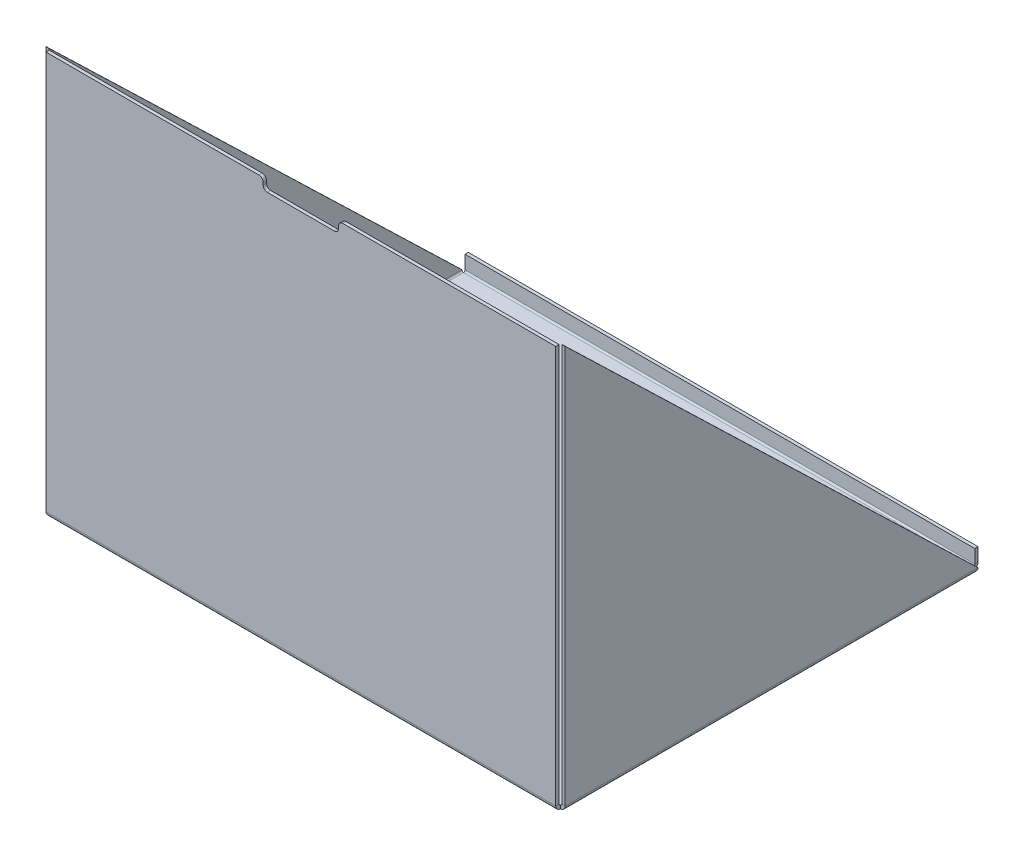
ISO-10303-21;
HEADER;
FILE_DESCRIPTION(('STEP AP214'),'2;1');
FILE_NAME('part.step','',(''),(''),'','','');
FILE_SCHEMA(('AUTOMOTIVE_DESIGN { 1 0 10303 214 1 1 1 1 }'));
ENDSEC;
DATA;
#1=APPLICATION_CONTEXT('core data for automotive mechanical design processes');
#2=APPLICATION_PROTOCOL_DEFINITION('international standard','automotive_design',2000,#1);
#3=PRODUCT_CONTEXT('',#1,'mechanical');
#4=PRODUCT('Part','Part','',(#3));
#5=PRODUCT_RELATED_PRODUCT_CATEGORY('part','',(#4));
#6=PRODUCT_DEFINITION_FORMATION('','',#4);
#7=PRODUCT_DEFINITION_CONTEXT('part definition',#1,'design');
#8=PRODUCT_DEFINITION('design','',#6,#7);
#9=PRODUCT_DEFINITION_SHAPE('','',#8);
#10=(LENGTH_UNIT() NAMED_UNIT(*) SI_UNIT(.MILLI.,.METRE.));
#11=(NAMED_UNIT(*) PLANE_ANGLE_UNIT() SI_UNIT($,.RADIAN.));
#12=(NAMED_UNIT(*) SI_UNIT($,.STERADIAN.) SOLID_ANGLE_UNIT());
#13=UNCERTAINTY_MEASURE_WITH_UNIT(LENGTH_MEASURE(1.E-05),#10,'distance_accuracy_value','');
#14=(GEOMETRIC_REPRESENTATION_CONTEXT(3) GLOBAL_UNCERTAINTY_ASSIGNED_CONTEXT((#13)) GLOBAL_UNIT_ASSIGNED_CONTEXT((#10,
#11,#12)) REPRESENTATION_CONTEXT('',''));
#15=CARTESIAN_POINT('',(0.,0.,0.));
#16=DIRECTION('',(0.,0.,1.));
#17=DIRECTION('',(1.,0.,0.));
#18=AXIS2_PLACEMENT_3D('',#15,#16,#17);
#19=CARTESIAN_POINT('',(-119.,187.,98.));
#20=DIRECTION('',(0.,-1.,0.));
#21=DIRECTION('',(0.,0.,-1.));
#22=AXIS2_PLACEMENT_3D('',#19,#20,#21);
#23=PLANE('',#22);
#24=DIRECTION('',(-1.,0.,0.));
#25=VECTOR('',#24,1.);
#26=CARTESIAN_POINT('',(-119.,187.,98.));
#27=LINE('',#26,#25);
#28=CARTESIAN_POINT('',(-19.5,187.,98.));
#29=VERTEX_POINT('',#28);
#30=CARTESIAN_POINT('',(-118.292893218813,187.,98.));
#31=VERTEX_POINT('',#30);
#32=EDGE_CURVE('E495',#29,#31,#27,.T.);
#33=ORIENTED_EDGE('',*,*,#32,.F.);
#34=DIRECTION('',(0.,0.,1.));
#35=VECTOR('',#34,1.);
#36=CARTESIAN_POINT('',(-19.5,187.,98.));
#37=LINE('',#36,#35);
#38=CARTESIAN_POINT('',(-19.5,187.,96.5));
#39=VERTEX_POINT('',#38);
#40=EDGE_CURVE('E61',#29,#39,#37,.F.);
#41=ORIENTED_EDGE('',*,*,#40,.T.);
#42=DIRECTION('',(-1.,0.,0.));
#43=VECTOR('',#42,1.);
#44=CARTESIAN_POINT('',(-119.,187.,96.5));
#45=LINE('',#44,#43);
#46=CARTESIAN_POINT('',(-118.292893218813,187.,96.5000000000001));
#47=VERTEX_POINT('',#46);
#48=EDGE_CURVE('E490',#39,#47,#45,.T.);
#49=ORIENTED_EDGE('',*,*,#48,.T.);
#50=DIRECTION('',(0.,0.,-1.));
#51=VECTOR('',#50,1.);
#52=CARTESIAN_POINT('',(-118.292893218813,187.,98.));
#53=LINE('',#52,#51);
#54=EDGE_CURVE('E483',#31,#47,#53,.T.);
#55=ORIENTED_EDGE('',*,*,#54,.F.);
#56=EDGE_LOOP('',(#33,#41,#49,#55));
#57=FACE_BOUND('',#56,.T.);
#58=ADVANCED_FACE('F46',(#57),#23,.F.);
#59=CARTESIAN_POINT('',(-120.5,1.5,96.5));
#60=DIRECTION('',(1.,0.,0.));
#61=DIRECTION('',(0.,1.,0.));
#62=AXIS2_PLACEMENT_3D('',#59,#60,#61);
#63=PLANE('',#62);
#64=DIRECTION('',(0.,-0.694174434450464,-0.719806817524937));
#65=VECTOR('',#64,1.);
#66=CARTESIAN_POINT('',(-120.5,97.9649251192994,3.4701992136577));
#67=LINE('',#66,#65);
#68=CARTESIAN_POINT('',(-120.500000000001,187.,95.7928932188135));
#69=VERTEX_POINT('',#68);
#70=CARTESIAN_POINT('',(-120.5,2.23660000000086,-95.7928932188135));
#71=VERTEX_POINT('',#70);
#72=EDGE_CURVE('E587',#69,#71,#67,.T.);
#73=ORIENTED_EDGE('',*,*,#72,.T.);
#74=DIRECTION('',(0.,0.,-1.));
#75=VECTOR('',#74,1.);
#76=CARTESIAN_POINT('',(-120.5,2.2366,96.5));
#77=LINE('',#76,#75);
#78=CARTESIAN_POINT('',(-120.5,2.2366,95.7928932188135));
#79=VERTEX_POINT('',#78);
#80=EDGE_CURVE('E375',#79,#71,#77,.T.);
#81=ORIENTED_EDGE('',*,*,#80,.F.);
#82=DIRECTION('',(0.,1.,0.));
#83=VECTOR('',#82,1.);
#84=CARTESIAN_POINT('',(-120.5,1.5,95.7928932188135));
#85=LINE('',#84,#83);
#86=EDGE_CURVE('E561',#79,#69,#85,.T.);
#87=ORIENTED_EDGE('',*,*,#86,.T.);
#88=EDGE_LOOP('',(#73,#81,#87));
#89=FACE_BOUND('',#88,.T.);
#90=ADVANCED_FACE('F585',(#89),#63,.F.);
#91=CARTESIAN_POINT('',(-119.,1.5,96.5));
#92=DIRECTION('',(1.,0.,0.));
#93=DIRECTION('',(0.,1.,0.));
#94=AXIS2_PLACEMENT_3D('',#91,#92,#93);
#95=PLANE('',#94);
#96=DIRECTION('',(0.,0.,1.));
#97=VECTOR('',#96,1.);
#98=CARTESIAN_POINT('',(-119.,2.23660000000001,-96.5));
#99=LINE('',#98,#97);
#100=CARTESIAN_POINT('',(-119.,2.23660000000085,-95.7928932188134));
#101=VERTEX_POINT('',#100);
#102=CARTESIAN_POINT('',(-119.,2.23660000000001,95.7928932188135));
#103=VERTEX_POINT('',#102);
#104=EDGE_CURVE('E387',#101,#103,#99,.T.);
#105=ORIENTED_EDGE('',*,*,#104,.F.);
#106=DIRECTION('',(0.,-0.694174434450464,-0.719806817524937));
#107=VECTOR('',#106,1.);
#108=CARTESIAN_POINT('',(-119.,97.9649251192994,3.4701992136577));
#109=LINE('',#108,#107);
#110=CARTESIAN_POINT('',(-119.000000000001,187.,95.7928932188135));
#111=VERTEX_POINT('',#110);
#112=EDGE_CURVE('E593',#111,#101,#109,.T.);
#113=ORIENTED_EDGE('',*,*,#112,.F.);
#114=DIRECTION('',(0.,1.,0.));
#115=VECTOR('',#114,1.);
#116=CARTESIAN_POINT('',(-119.,1.5,95.7928932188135));
#117=LINE('',#116,#115);
#118=EDGE_CURVE('E558',#103,#111,#117,.T.);
#119=ORIENTED_EDGE('',*,*,#118,.F.);
#120=EDGE_LOOP('',(#105,#113,#119));
#121=FACE_BOUND('',#120,.T.);
#122=ADVANCED_FACE('F596',(#121),#95,.T.);
#123=CARTESIAN_POINT('',(120.500000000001,187.,96.5));
#124=DIRECTION('',(-1.,0.,0.));
#125=DIRECTION('',(0.,-1.,0.));
#126=AXIS2_PLACEMENT_3D('',#123,#124,#125);
#127=PLANE('',#126);
#128=DIRECTION('',(0.,0.694174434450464,0.719806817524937));
#129=VECTOR('',#128,1.);
#130=CARTESIAN_POINT('',(120.500000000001,187.353321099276,96.1592606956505));
#131=LINE('',#130,#129);
#132=CARTESIAN_POINT('',(120.5,2.23660000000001,-95.7928932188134));
#133=VERTEX_POINT('',#132);
#134=CARTESIAN_POINT('',(120.500000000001,187.,95.7928932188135));
#135=VERTEX_POINT('',#134);
#136=EDGE_CURVE('E604',#133,#135,#131,.T.);
#137=ORIENTED_EDGE('',*,*,#136,.T.);
#138=DIRECTION('',(0.,1.,0.));
#139=VECTOR('',#138,1.);
#140=CARTESIAN_POINT('',(120.500000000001,187.,95.7928932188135));
#141=LINE('',#140,#139);
#142=CARTESIAN_POINT('',(120.5,2.2366,95.7928932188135));
#143=VERTEX_POINT('',#142);
#144=EDGE_CURVE('E315',#143,#135,#141,.T.);
#145=ORIENTED_EDGE('',*,*,#144,.F.);
#146=DIRECTION('',(0.,0.,1.));
#147=VECTOR('',#146,1.);
#148=CARTESIAN_POINT('',(120.5,2.23660000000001,96.5));
#149=LINE('',#148,#147);
#150=EDGE_CURVE('E322',#133,#143,#149,.T.);
#151=ORIENTED_EDGE('',*,*,#150,.F.);
#152=EDGE_LOOP('',(#137,#145,#151));
#153=FACE_BOUND('',#152,.T.);
#154=ADVANCED_FACE('F630',(#153),#127,.F.);
#155=CARTESIAN_POINT('',(119.000000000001,187.,96.5));
#156=DIRECTION('',(-1.,0.,0.));
#157=DIRECTION('',(0.,-1.,0.));
#158=AXIS2_PLACEMENT_3D('',#155,#156,#157);
#159=PLANE('',#158);
#160=DIRECTION('',(0.,1.,0.));
#161=VECTOR('',#160,1.);
#162=CARTESIAN_POINT('',(119.,1.5,95.7928932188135));
#163=LINE('',#162,#161);
#164=CARTESIAN_POINT('',(119.,2.23660000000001,95.7928932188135));
#165=VERTEX_POINT('',#164);
#166=CARTESIAN_POINT('',(119.000000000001,187.,95.7928932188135));
#167=VERTEX_POINT('',#166);
#168=EDGE_CURVE('E307',#165,#167,#163,.T.);
#169=ORIENTED_EDGE('',*,*,#168,.T.);
#170=DIRECTION('',(0.,0.694174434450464,0.719806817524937));
#171=VECTOR('',#170,1.);
#172=CARTESIAN_POINT('',(119.000000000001,187.353321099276,96.1592606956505));
#173=LINE('',#172,#171);
#174=CARTESIAN_POINT('',(119.,2.23660000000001,-95.7928932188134));
#175=VERTEX_POINT('',#174);
#176=EDGE_CURVE('E598',#175,#167,#173,.T.);
#177=ORIENTED_EDGE('',*,*,#176,.F.);
#178=DIRECTION('',(0.,0.,-1.));
#179=VECTOR('',#178,1.);
#180=CARTESIAN_POINT('',(119.,2.23660000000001,96.5));
#181=LINE('',#180,#179);
#182=EDGE_CURVE('E321',#165,#175,#181,.T.);
#183=ORIENTED_EDGE('',*,*,#182,.F.);
#184=EDGE_LOOP('',(#169,#177,#183));
#185=FACE_BOUND('',#184,.T.);
#186=ADVANCED_FACE('F633',(#185),#159,.T.);
#187=CARTESIAN_POINT('',(-119.,1.5,-96.5));
#188=DIRECTION('',(0.,1.,0.));
#189=DIRECTION('',(0.,0.,1.));
#190=AXIS2_PLACEMENT_3D('',#187,#188,#189);
#191=PLANE('',#190);
#192=DIRECTION('',(0.,0.,-1.));
#193=VECTOR('',#192,1.);
#194=CARTESIAN_POINT('',(118.2634,1.5,-95.7928932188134));
#195=LINE('',#194,#193);
#196=CARTESIAN_POINT('',(118.2634,1.5,-95.7634));
#197=VERTEX_POINT('',#196);
#198=CARTESIAN_POINT('',(118.2634,1.5,95.7634));
#199=VERTEX_POINT('',#198);
#200=EDGE_CURVE('E327',#197,#199,#195,.F.);
#201=ORIENTED_EDGE('',*,*,#200,.F.);
#202=DIRECTION('',(-1.,0.,0.));
#203=VECTOR('',#202,1.);
#204=CARTESIAN_POINT('',(-118.292893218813,1.5,-95.7634));
#205=LINE('',#204,#203);
#206=CARTESIAN_POINT('',(-118.2634,1.5,-95.7634));
#207=VERTEX_POINT('',#206);
#208=EDGE_CURVE('E262',#207,#197,#205,.F.);
#209=ORIENTED_EDGE('',*,*,#208,.F.);
#210=DIRECTION('',(0.,0.,1.));
#211=VECTOR('',#210,1.);
#212=CARTESIAN_POINT('',(-118.2634,1.50000000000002,95.7928932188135));
#213=LINE('',#212,#211);
#214=CARTESIAN_POINT('',(-118.2634,1.5,95.7634));
#215=VERTEX_POINT('',#214);
#216=EDGE_CURVE('E382',#215,#207,#213,.F.);
#217=ORIENTED_EDGE('',*,*,#216,.F.);
#218=DIRECTION('',(1.,0.,0.));
#219=VECTOR('',#218,1.);
#220=CARTESIAN_POINT('',(118.292893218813,1.49999999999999,95.7634));
#221=LINE('',#220,#219);
#222=EDGE_CURVE('E504',#199,#215,#221,.F.);
#223=ORIENTED_EDGE('',*,*,#222,.F.);
#224=EDGE_LOOP('',(#201,#209,#217,#223));
#225=FACE_BOUND('',#224,.T.);
#226=ADVANCED_FACE('F635',(#225),#191,.T.);
#227=CARTESIAN_POINT('',(-119.,0.,-96.5));
#228=DIRECTION('',(0.,1.,0.));
#229=DIRECTION('',(0.,0.,1.));
#230=AXIS2_PLACEMENT_3D('',#227,#228,#229);
#231=PLANE('',#230);
#232=DIRECTION('',(-1.,0.,0.));
#233=VECTOR('',#232,1.);
#234=CARTESIAN_POINT('',(-118.292893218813,0.,-95.7634));
#235=LINE('',#234,#233);
#236=CARTESIAN_POINT('',(-118.2634,0.,-95.7634));
#237=VERTEX_POINT('',#236);
#238=CARTESIAN_POINT('',(118.2634,0.,-95.7634));
#239=VERTEX_POINT('',#238);
#240=EDGE_CURVE('E271',#237,#239,#235,.F.);
#241=ORIENTED_EDGE('',*,*,#240,.T.);
#242=DIRECTION('',(0.,0.,-1.));
#243=VECTOR('',#242,1.);
#244=CARTESIAN_POINT('',(118.2634,0.,-95.7928932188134));
#245=LINE('',#244,#243);
#246=CARTESIAN_POINT('',(118.2634,0.,95.7633999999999));
#247=VERTEX_POINT('',#246);
#248=EDGE_CURVE('E337',#239,#247,#245,.F.);
#249=ORIENTED_EDGE('',*,*,#248,.T.);
#250=DIRECTION('',(1.,0.,0.));
#251=VECTOR('',#250,1.);
#252=CARTESIAN_POINT('',(118.292893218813,0.,95.7633999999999));
#253=LINE('',#252,#251);
#254=CARTESIAN_POINT('',(-118.2634,0.,95.7634));
#255=VERTEX_POINT('',#254);
#256=EDGE_CURVE('E513',#247,#255,#253,.F.);
#257=ORIENTED_EDGE('',*,*,#256,.T.);
#258=DIRECTION('',(0.,0.,1.));
#259=VECTOR('',#258,1.);
#260=CARTESIAN_POINT('',(-118.2634,0.,95.7928932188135));
#261=LINE('',#260,#259);
#262=EDGE_CURVE('E427',#255,#237,#261,.F.);
#263=ORIENTED_EDGE('',*,*,#262,.T.);
#264=EDGE_LOOP('',(#241,#249,#257,#263));
#265=FACE_BOUND('',#264,.T.);
#266=ADVANCED_FACE('F620',(#265),#231,.F.);
#267=CARTESIAN_POINT('',(-118.2634,-0.0149999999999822,-95.7634));
#268=CARTESIAN_POINT('',(-118.558186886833,-0.0149999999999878,-95.7658582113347));
#269=CARTESIAN_POINT('',(-118.852751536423,0.0436031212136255,-95.7683155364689));
#270=CARTESIAN_POINT('',(-119.397348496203,0.269182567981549,-95.7732310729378));
#271=CARTESIAN_POINT('',(-119.647113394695,0.436070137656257,-95.7756888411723));
#272=CARTESIAN_POINT('',(-120.063929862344,0.852886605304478,-95.7806043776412));
#273=CARTESIAN_POINT('',(-120.230817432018,1.10265150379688,-95.7830621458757));
#274=CARTESIAN_POINT('',(-120.456396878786,1.64724846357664,-95.7879776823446));
#275=CARTESIAN_POINT('',(-120.515,1.94181311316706,-95.7904350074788));
#276=CARTESIAN_POINT('',(-120.515,2.2366,-95.7928932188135));
#277=CARTESIAN_POINT('',(-118.2634,0.,-95.7634));
#278=CARTESIAN_POINT('',(-118.556223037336,0.,-95.7658582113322));
#279=CARTESIAN_POINT('',(-118.848825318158,0.0582127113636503,-95.7683155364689));
#280=CARTESIAN_POINT('',(-119.389794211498,0.282289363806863,-95.7732310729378));
#281=CARTESIAN_POINT('',(-119.637895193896,0.44806514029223,-95.7756888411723));
#282=CARTESIAN_POINT('',(-120.051934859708,0.862104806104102,-95.7806043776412));
#283=CARTESIAN_POINT('',(-120.217710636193,1.11020578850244,-95.7830621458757));
#284=CARTESIAN_POINT('',(-120.441787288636,1.65117468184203,-95.7879776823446));
#285=CARTESIAN_POINT('',(-120.5,1.94377696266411,-95.7904350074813));
#286=CARTESIAN_POINT('',(-120.5,2.2366,-95.7928932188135));
#287=CARTESIAN_POINT('',(-118.2634,1.50000000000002,-95.7634));
#288=CARTESIAN_POINT('',(-118.359838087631,1.50000000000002,-95.7658582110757));
#289=CARTESIAN_POINT('',(-118.456203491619,1.51917172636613,-95.7683155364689));
#290=CARTESIAN_POINT('',(-118.634365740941,1.59296894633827,-95.7732310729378));
#291=CARTESIAN_POINT('',(-118.716075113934,1.64756540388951,-95.7756888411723));
#292=CARTESIAN_POINT('',(-118.85243459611,1.78392488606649,-95.7806043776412));
#293=CARTESIAN_POINT('',(-118.907031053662,1.8656342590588,-95.7830621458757));
#294=CARTESIAN_POINT('',(-118.980828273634,2.04379650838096,-95.7879776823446));
#295=CARTESIAN_POINT('',(-119.,2.14016191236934,-95.7904350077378));
#296=CARTESIAN_POINT('',(-119.,2.23660000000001,-95.7928932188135));
#297=CARTESIAN_POINT('',(-118.2634,1.51515000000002,-95.7634));
#298=CARTESIAN_POINT('',(-118.357854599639,1.51515000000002,-95.7658582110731));
#299=CARTESIAN_POINT('',(-118.452238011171,1.53392741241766,-95.7683155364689));
#300=CARTESIAN_POINT('',(-118.626735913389,1.60620681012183,-95.7732310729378));
#301=CARTESIAN_POINT('',(-118.706764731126,1.65968035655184,-95.7756888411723));
#302=CARTESIAN_POINT('',(-118.840319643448,1.79323526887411,-95.7806043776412));
#303=CARTESIAN_POINT('',(-118.893793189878,1.87326408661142,-95.7830621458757));
#304=CARTESIAN_POINT('',(-118.966072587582,2.047761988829,-95.7879776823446));
#305=CARTESIAN_POINT('',(-118.98485,2.14214540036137,-95.7904350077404));
#306=CARTESIAN_POINT('',(-118.98485,2.23660000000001,-95.7928932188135));
#307=B_SPLINE_SURFACE_WITH_KNOTS('',1,3,((#267,#268,#269,#270,#271,#272,#273,#274,#275,#276),
(#277,#278,#279,#280,#281,#282,#283,#284,#285,#286),(#287,#288,#289,#290,#291,#292,#293,#294,
#295,#296),(#297,#298,#299,#300,#301,#302,#303,#304,#305,#306)),.UNSPECIFIED.,.F.,.F.,.F.,(2,1,
1,2),(4,2,2,2,4),(-0.01,0.,1.,1.0101),(0.,0.25,0.5,0.75,1.),.UNSPECIFIED.);
#308=DIRECTION('',(1.,0.,0.));
#309=VECTOR('',#308,1.);
#310=CARTESIAN_POINT('',(-119.,2.23660000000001,-95.7928932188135));
#311=LINE('',#310,#309);
#312=EDGE_CURVE('E366',#71,#101,#311,.T.);
#313=CARTESIAN_POINT('',(-118.2634,1.50000000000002,-95.7634));
#314=CARTESIAN_POINT('',(-118.275452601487,1.49999974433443,-95.7637072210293));
#315=CARTESIAN_POINT('',(-118.287505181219,1.50029580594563,-95.7640144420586));
#316=CARTESIAN_POINT('',(-118.3115813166,1.50147872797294,-95.7646288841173));
#317=CARTESIAN_POINT('',(-118.323604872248,1.50236558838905,-95.7649361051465));
#318=CARTESIAN_POINT('',(-118.347593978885,1.5047282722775,-95.7655505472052));
#319=CARTESIAN_POINT('',(-118.359559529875,1.50620409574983,-95.7658577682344));
#320=CARTESIAN_POINT('',(-118.383403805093,1.50974106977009,-95.7664722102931));
#321=CARTESIAN_POINT('',(-118.395282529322,1.51180222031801,-95.7667794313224));
#322=CARTESIAN_POINT('',(-118.418924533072,1.51650490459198,-95.767393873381));
#323=CARTESIAN_POINT('',(-118.430687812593,1.51914643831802,-95.7677010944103));
#324=CARTESIAN_POINT('',(-118.45407058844,1.52500351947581,-95.7683155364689));
#325=CARTESIAN_POINT('',(-118.465690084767,1.52821906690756,-95.7686227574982));
#326=CARTESIAN_POINT('',(-118.488757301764,1.53521643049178,-95.7692371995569));
#327=CARTESIAN_POINT('',(-118.500205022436,1.53899824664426,-95.7695444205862));
#328=CARTESIAN_POINT('',(-118.522901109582,1.54711903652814,-95.7701588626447));
#329=CARTESIAN_POINT('',(-118.534149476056,1.55145801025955,-95.7704660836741));
#330=CARTESIAN_POINT('',(-118.556419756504,1.56068266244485,-95.7710805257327));
#331=CARTESIAN_POINT('',(-118.567441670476,1.56556834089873,-95.771387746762));
#332=CARTESIAN_POINT('',(-118.589232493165,1.57587463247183,-95.7720021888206));
#333=CARTESIAN_POINT('',(-118.600001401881,1.58129524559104,-95.7723094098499));
#334=CARTESIAN_POINT('',(-118.621260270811,1.59265834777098,-95.7729238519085));
#335=CARTESIAN_POINT('',(-118.631750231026,1.59860083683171,-95.7732310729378));
#336=CARTESIAN_POINT('',(-118.65242593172,1.61099337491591,-95.7738455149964));
#337=CARTESIAN_POINT('',(-118.6626116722,1.61744342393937,-95.7741527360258));
#338=CARTESIAN_POINT('',(-118.682654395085,1.63083554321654,-95.7747671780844));
#339=CARTESIAN_POINT('',(-118.692511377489,1.63777761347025,-95.7750743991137));
#340=CARTESIAN_POINT('',(-118.711872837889,1.65213705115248,-95.7756888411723));
#341=CARTESIAN_POINT('',(-118.721377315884,1.65955441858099,-95.7759960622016));
#342=CARTESIAN_POINT('',(-118.740010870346,1.67484658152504,-95.7766105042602));
#343=CARTESIAN_POINT('',(-118.749139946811,1.68272137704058,-95.7769177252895));
#344=CARTESIAN_POINT('',(-118.767000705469,1.69890942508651,-95.7775321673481));
#345=CARTESIAN_POINT('',(-118.775732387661,1.70722267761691,-95.7778393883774));
#346=CARTESIAN_POINT('',(-118.792777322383,1.72426761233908,-95.778453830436));
#347=CARTESIAN_POINT('',(-118.801090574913,1.73299929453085,-95.7787610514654));
#348=CARTESIAN_POINT('',(-118.817278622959,1.75086005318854,-95.779375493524));
#349=CARTESIAN_POINT('',(-118.825153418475,1.75998912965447,-95.7796827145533));
#350=CARTESIAN_POINT('',(-118.840445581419,1.77862268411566,-95.7802971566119));
#351=CARTESIAN_POINT('',(-118.847862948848,1.78812716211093,-95.7806043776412));
#352=CARTESIAN_POINT('',(-118.86222238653,1.80748862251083,-95.7812188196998));
#353=CARTESIAN_POINT('',(-118.869164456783,1.81734560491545,-95.7815260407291));
#354=CARTESIAN_POINT('',(-118.882556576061,1.83738832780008,-95.7821404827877));
#355=CARTESIAN_POINT('',(-118.889006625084,1.84757406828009,-95.782447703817));
#356=CARTESIAN_POINT('',(-118.901399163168,1.86824976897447,-95.7830621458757));
#357=CARTESIAN_POINT('',(-118.907341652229,1.87873972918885,-95.783369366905));
#358=CARTESIAN_POINT('',(-118.918704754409,1.89999859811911,-95.7839838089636));
#359=CARTESIAN_POINT('',(-118.924125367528,1.91076750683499,-95.7842910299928));
#360=CARTESIAN_POINT('',(-118.934431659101,1.93255832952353,-95.7849054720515));
#361=CARTESIAN_POINT('',(-118.939317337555,1.94358024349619,-95.7852126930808));
#362=CARTESIAN_POINT('',(-118.94854198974,1.96585052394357,-95.7858271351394));
#363=CARTESIAN_POINT('',(-118.952880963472,1.9770988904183,-95.7861343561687));
#364=CARTESIAN_POINT('',(-118.961001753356,1.99979497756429,-95.7867487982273));
#365=CARTESIAN_POINT('',(-118.964783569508,2.01124269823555,-95.7870560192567));
#366=CARTESIAN_POINT('',(-118.971780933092,2.03430991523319,-95.7876704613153));
#367=CARTESIAN_POINT('',(-118.974996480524,2.04592941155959,-95.7879776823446));
#368=CARTESIAN_POINT('',(-118.980853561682,2.06931218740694,-95.7885921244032));
#369=CARTESIAN_POINT('',(-118.983495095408,2.0810754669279,-95.7888993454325));
#370=CARTESIAN_POINT('',(-118.988197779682,2.10471747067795,-95.7895137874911));
#371=CARTESIAN_POINT('',(-118.99025893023,2.11659619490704,-95.7898210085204));
#372=CARTESIAN_POINT('',(-118.99379590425,2.14044047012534,-95.790435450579));
#373=CARTESIAN_POINT('',(-118.995271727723,2.15240602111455,-95.7907426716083));
#374=CARTESIAN_POINT('',(-118.997634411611,2.17639512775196,-95.7913571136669));
#375=CARTESIAN_POINT('',(-118.998521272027,2.18841868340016,-95.7916643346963));
#376=CARTESIAN_POINT('',(-118.999704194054,2.2124948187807,-95.7922787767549));
#377=CARTESIAN_POINT('',(-119.000000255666,2.22454739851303,-95.7925859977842));
#378=CARTESIAN_POINT('',(-119.,2.23660000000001,-95.7928932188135));
#379=B_SPLINE_CURVE_WITH_KNOTS('',3,(#313,#314,#315,#316,#317,#318,#319,#320,#321,#322,#323,
#324,#325,#326,#327,#328,#329,#330,#331,#332,#333,#334,#335,#336,#337,#338,#339,#340,#341,#342,
#343,#344,#345,#346,#347,#348,#349,#350,#351,#352,#353,#354,#355,#356,#357,#358,#359,#360,#361,
#362,#363,#364,#365,#366,#367,#368,#369,#370,#371,#372,#373,#374,#375,#376,#377,#378),
.UNSPECIFIED.,.F.,.F.,(4,2,2,2,2,2,2,2,2,2,2,2,2,2,2,2,2,2,2,2,2,2,2,2,2,2,2,2,2,2,2,2,4),(0.,
0.0361658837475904,0.0723317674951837,0.108497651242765,0.144663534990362,0.180829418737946,
0.216995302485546,0.253161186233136,0.289327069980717,0.325492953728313,0.361658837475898,
0.397824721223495,0.433990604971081,0.470156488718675,0.506322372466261,0.542488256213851,
0.578654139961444,0.614820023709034,0.650985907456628,0.687151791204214,0.723317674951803,
0.759483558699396,0.795649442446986,0.831815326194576,0.867981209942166,0.904147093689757,
0.940312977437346,0.976478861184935,1.01264474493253,1.04881062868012,1.08497651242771,
1.1211423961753,1.15730827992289),.UNSPECIFIED.);
#380=EDGE_CURVE('E378',#207,#101,#379,.T.);
#381=DIRECTION('',(0.,-1.,0.));
#382=VECTOR('',#381,1.);
#383=CARTESIAN_POINT('',(-118.2634,1.50000000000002,-95.7634));
#384=LINE('',#383,#382);
#385=EDGE_CURVE('E428',#207,#237,#384,.T.);
#386=CARTESIAN_POINT('',(-118.2634,0.,-95.7634));
#387=CARTESIAN_POINT('',(-118.299996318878,-7.76298737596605E-07,-95.7637072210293));
#388=CARTESIAN_POINT('',(-118.336592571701,0.000898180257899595,-95.7640144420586));
#389=CARTESIAN_POINT('',(-118.4096969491,0.00448998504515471,-95.7646288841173));
#390=CARTESIAN_POINT('',(-118.446205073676,0.00718283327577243,-95.7649361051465));
#391=CARTESIAN_POINT('',(-118.519045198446,0.0143568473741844,-95.7655505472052));
#392=CARTESIAN_POINT('',(-118.555377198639,0.0188380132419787,-95.7658577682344));
#393=CARTESIAN_POINT('',(-118.627777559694,0.0295776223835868,-95.7664722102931));
#394=CARTESIAN_POINT('',(-118.663845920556,0.0358360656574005,-95.7667794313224));
#395=CARTESIAN_POINT('',(-118.735632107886,0.0501152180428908,-95.767393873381));
#396=CARTESIAN_POINT('',(-118.771349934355,0.0581359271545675,-95.7677010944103));
#397=CARTESIAN_POINT('',(-118.842349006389,0.0759202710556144,-95.7683155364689));
#398=CARTESIAN_POINT('',(-118.877630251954,0.0856839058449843,-95.7686227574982));
#399=CARTESIAN_POINT('',(-118.94767116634,0.106930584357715,-95.7692371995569));
#400=CARTESIAN_POINT('',(-118.982430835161,0.118413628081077,-95.7695444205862));
#401=CARTESIAN_POINT('',(-119.051344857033,0.143071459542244,-95.7701588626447));
#402=CARTESIAN_POINT('',(-119.085499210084,0.15624624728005,-95.7704660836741));
#403=CARTESIAN_POINT('',(-119.153120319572,0.184255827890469,-95.7710805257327));
#404=CARTESIAN_POINT('',(-119.186587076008,0.199090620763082,-95.771387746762));
#405=CARTESIAN_POINT('',(-119.252752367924,0.230384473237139,-95.7720021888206));
#406=CARTESIAN_POINT('',(-119.285450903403,0.246843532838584,-95.7723094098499));
#407=CARTESIAN_POINT('',(-119.350000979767,0.281346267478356,-95.7729238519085));
#408=CARTESIAN_POINT('',(-119.381852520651,0.299389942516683,-95.7732310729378));
#409=CARTESIAN_POINT('',(-119.444631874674,0.337018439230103,-95.7738455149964));
#410=CARTESIAN_POINT('',(-119.475559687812,0.356603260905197,-95.7741527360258));
#411=CARTESIAN_POINT('',(-119.536417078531,0.397266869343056,-95.7747671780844));
#412=CARTESIAN_POINT('',(-119.566346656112,0.418345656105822,-95.7750743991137));
#413=CARTESIAN_POINT('',(-119.625135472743,0.461946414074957,-95.7756888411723));
#414=CARTESIAN_POINT('',(-119.653994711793,0.484468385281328,-95.7759960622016));
#415=CARTESIAN_POINT('',(-119.710573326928,0.530901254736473,-95.7766105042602));
#416=CARTESIAN_POINT('',(-119.738292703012,0.554812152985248,-95.7769177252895));
#417=CARTESIAN_POINT('',(-119.79252481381,0.603965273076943,-95.7775321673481));
#418=CARTESIAN_POINT('',(-119.819037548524,0.629207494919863,-95.7778393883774));
#419=CARTESIAN_POINT('',(-119.87079250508,0.680962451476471,-95.778453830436));
#420=CARTESIAN_POINT('',(-119.896034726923,0.70747518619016,-95.7787610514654));
#421=CARTESIAN_POINT('',(-119.945187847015,0.761707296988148,-95.779375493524));
#422=CARTESIAN_POINT('',(-119.969098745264,0.789426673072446,-95.7796827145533));
#423=CARTESIAN_POINT('',(-120.015531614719,0.846005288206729,-95.7802971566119));
#424=CARTESIAN_POINT('',(-120.038053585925,0.874864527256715,-95.7806043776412));
#425=CARTESIAN_POINT('',(-120.081654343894,0.933653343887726,-95.7812188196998));
#426=CARTESIAN_POINT('',(-120.102733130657,0.963582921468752,-95.7815260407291));
#427=CARTESIAN_POINT('',(-120.143396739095,1.02444031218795,-95.7821404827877));
#428=CARTESIAN_POINT('',(-120.16298156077,1.05536812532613,-95.782447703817));
#429=CARTESIAN_POINT('',(-120.200610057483,1.11814747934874,-95.7830621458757));
#430=CARTESIAN_POINT('',(-120.218653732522,1.14999902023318,-95.783369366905));
#431=CARTESIAN_POINT('',(-120.253156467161,1.21454909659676,-95.7839838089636));
#432=CARTESIAN_POINT('',(-120.269615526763,1.24724763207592,-95.7842910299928));
#433=CARTESIAN_POINT('',(-120.300909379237,1.31341292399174,-95.7849054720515));
#434=CARTESIAN_POINT('',(-120.31574417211,1.3468796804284,-95.7852126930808));
#435=CARTESIAN_POINT('',(-120.34375375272,1.41450078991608,-95.7858271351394));
#436=CARTESIAN_POINT('',(-120.356928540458,1.4486551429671,-95.7861343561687));
#437=CARTESIAN_POINT('',(-120.381586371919,1.51756916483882,-95.7867487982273));
#438=CARTESIAN_POINT('',(-120.393069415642,1.55232883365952,-95.7870560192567));
#439=CARTESIAN_POINT('',(-120.414316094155,1.62236974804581,-95.7876704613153));
#440=CARTESIAN_POINT('',(-120.424079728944,1.65765099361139,-95.7879776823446));
#441=CARTESIAN_POINT('',(-120.441864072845,1.72865006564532,-95.7885921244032));
#442=CARTESIAN_POINT('',(-120.449884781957,1.76436789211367,-95.7888993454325));
#443=CARTESIAN_POINT('',(-120.464163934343,1.83615407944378,-95.7895137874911));
#444=CARTESIAN_POINT('',(-120.470422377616,1.87222244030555,-95.7898210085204));
#445=CARTESIAN_POINT('',(-120.481161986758,1.94462280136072,-95.790435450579));
#446=CARTESIAN_POINT('',(-120.485643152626,1.98095480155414,-95.7907426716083));
#447=CARTESIAN_POINT('',(-120.492817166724,2.05379492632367,-95.7913571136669));
#448=CARTESIAN_POINT('',(-120.495510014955,2.09030305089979,-95.7916643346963));
#449=CARTESIAN_POINT('',(-120.499101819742,2.1634074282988,-95.7922787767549));
#450=CARTESIAN_POINT('',(-120.500000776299,2.20000368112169,-95.7925859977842));
#451=CARTESIAN_POINT('',(-120.5,2.2366,-95.7928932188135));
#452=B_SPLINE_CURVE_WITH_KNOTS('',3,(#386,#387,#388,#389,#390,#391,#392,#393,#394,#395,#396,
#397,#398,#399,#400,#401,#402,#403,#404,#405,#406,#407,#408,#409,#410,#411,#412,#413,#414,#415,
#416,#417,#418,#419,#420,#421,#422,#423,#424,#425,#426,#427,#428,#429,#430,#431,#432,#433,#434,
#435,#436,#437,#438,#439,#440,#441,#442,#443,#444,#445,#446,#447,#448,#449,#450,#451),
.UNSPECIFIED.,.F.,.F.,(4,2,2,2,2,2,2,2,2,2,2,2,2,2,2,2,2,2,2,2,2,2,2,2,2,2,2,2,2,2,2,2,4),(0.,
0.109781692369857,0.219563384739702,0.329345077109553,0.439126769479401,0.548908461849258,
0.658690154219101,0.768471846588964,0.878253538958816,0.988035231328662,1.09781692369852,
1.20759861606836,1.31738030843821,1.42716200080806,1.53694369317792,1.64672538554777,
1.75650707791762,1.86628877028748,1.97607046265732,2.08585215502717,2.19563384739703,
2.30541553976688,2.41519723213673,2.52497892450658,2.63476061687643,2.74454230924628,
2.85432400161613,2.96410569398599,3.07388738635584,3.18366907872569,3.29345077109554,
3.40323246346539,3.51301415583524),.UNSPECIFIED.);
#453=EDGE_CURVE('E416',#237,#71,#452,.T.);
#454=ORIENTED_EDGE('',*,*,#312,.T.);
#455=ORIENTED_EDGE('',*,*,#380,.F.);
#456=ORIENTED_EDGE('',*,*,#385,.T.);
#457=ORIENTED_EDGE('',*,*,#453,.T.);
#458=EDGE_LOOP('',(#454,#455,#456,#457));
#459=FACE_BOUND('',#458,.T.);
#460=ADVANCED_FACE('F405',(#459),#307,.F.);
#461=CARTESIAN_POINT('',(-120.515,2.23659999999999,95.7928932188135));
#462=CARTESIAN_POINT('',(-120.515,1.94181311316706,95.7904350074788));
#463=CARTESIAN_POINT('',(-120.456396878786,1.64724846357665,95.7879776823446));
#464=CARTESIAN_POINT('',(-120.230817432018,1.1026515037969,95.7830621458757));
#465=CARTESIAN_POINT('',(-120.063929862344,0.852886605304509,95.7806043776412));
#466=CARTESIAN_POINT('',(-119.647113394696,0.436070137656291,95.7756888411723));
#467=CARTESIAN_POINT('',(-119.397348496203,0.269182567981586,95.7732310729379));
#468=CARTESIAN_POINT('',(-118.852751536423,0.0436031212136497,95.768315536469));
#469=CARTESIAN_POINT('',(-118.558186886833,-0.0149999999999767,95.7658582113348));
#470=CARTESIAN_POINT('',(-118.2634,-0.0149999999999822,95.7634));
#471=CARTESIAN_POINT('',(-120.5,2.23659999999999,95.7928932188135));
#472=CARTESIAN_POINT('',(-120.5,1.94377696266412,95.7904350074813));
#473=CARTESIAN_POINT('',(-120.441787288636,1.65117468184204,95.7879776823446));
#474=CARTESIAN_POINT('',(-120.217710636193,1.11020578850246,95.7830621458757));
#475=CARTESIAN_POINT('',(-120.051934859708,0.862104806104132,95.7806043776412));
#476=CARTESIAN_POINT('',(-119.637895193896,0.448065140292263,95.7756888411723));
#477=CARTESIAN_POINT('',(-119.389794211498,0.282289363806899,95.7732310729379));
#478=CARTESIAN_POINT('',(-118.848825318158,0.0582127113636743,95.768315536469));
#479=CARTESIAN_POINT('',(-118.556223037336,0.,95.7658582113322));
#480=CARTESIAN_POINT('',(-118.2634,0.,95.7634));
#481=CARTESIAN_POINT('',(-119.,2.2366,95.7928932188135));
#482=CARTESIAN_POINT('',(-119.,2.14016191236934,95.7904350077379));
#483=CARTESIAN_POINT('',(-118.980828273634,2.04379650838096,95.7879776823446));
#484=CARTESIAN_POINT('',(-118.907031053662,1.86563425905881,95.7830621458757));
#485=CARTESIAN_POINT('',(-118.85243459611,1.78392488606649,95.7806043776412));
#486=CARTESIAN_POINT('',(-118.716075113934,1.64756540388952,95.7756888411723));
#487=CARTESIAN_POINT('',(-118.634365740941,1.59296894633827,95.7732310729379));
#488=CARTESIAN_POINT('',(-118.456203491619,1.51917172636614,95.768315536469));
#489=CARTESIAN_POINT('',(-118.359838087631,1.50000000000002,95.7658582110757));
#490=CARTESIAN_POINT('',(-118.2634,1.50000000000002,95.7634));
#491=CARTESIAN_POINT('',(-118.98485,2.2366,95.7928932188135));
#492=CARTESIAN_POINT('',(-118.98485,2.14214540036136,95.7904350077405));
#493=CARTESIAN_POINT('',(-118.966072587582,2.04776198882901,95.7879776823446));
#494=CARTESIAN_POINT('',(-118.893793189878,1.87326408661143,95.7830621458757));
#495=CARTESIAN_POINT('',(-118.840319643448,1.79323526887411,95.7806043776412));
#496=CARTESIAN_POINT('',(-118.706764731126,1.65968035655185,95.7756888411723));
#497=CARTESIAN_POINT('',(-118.626735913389,1.60620681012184,95.7732310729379));
#498=CARTESIAN_POINT('',(-118.452238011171,1.53392741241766,95.768315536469));
#499=CARTESIAN_POINT('',(-118.357854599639,1.51515000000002,95.7658582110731));
#500=CARTESIAN_POINT('',(-118.2634,1.51515000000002,95.7634));
#501=B_SPLINE_SURFACE_WITH_KNOTS('',1,3,((#461,#462,#463,#464,#465,#466,#467,#468,#469,#470),
(#471,#472,#473,#474,#475,#476,#477,#478,#479,#480),(#481,#482,#483,#484,#485,#486,#487,#488,
#489,#490),(#491,#492,#493,#494,#495,#496,#497,#498,#499,#500)),.UNSPECIFIED.,.F.,.F.,.F.,(2,1,
1,2),(4,2,2,2,4),(-0.01,0.,1.,1.0101),(0.,0.25,0.5,0.75,1.),.UNSPECIFIED.);
#502=CARTESIAN_POINT('',(-119.,2.2366,95.7928932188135));
#503=CARTESIAN_POINT('',(-119.000000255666,2.22454739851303,95.7925859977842));
#504=CARTESIAN_POINT('',(-118.999704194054,2.2124948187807,95.7922787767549));
#505=CARTESIAN_POINT('',(-118.998521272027,2.18841868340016,95.7916643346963));
#506=CARTESIAN_POINT('',(-118.997634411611,2.17639512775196,95.791357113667));
#507=CARTESIAN_POINT('',(-118.995271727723,2.15240602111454,95.7907426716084));
#508=CARTESIAN_POINT('',(-118.99379590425,2.14044047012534,95.7904354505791));
#509=CARTESIAN_POINT('',(-118.99025893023,2.11659619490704,95.7898210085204));
#510=CARTESIAN_POINT('',(-118.988197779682,2.10471747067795,95.7895137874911));
#511=CARTESIAN_POINT('',(-118.983495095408,2.0810754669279,95.7888993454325));
#512=CARTESIAN_POINT('',(-118.980853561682,2.06931218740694,95.7885921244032));
#513=CARTESIAN_POINT('',(-118.974996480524,2.04592941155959,95.7879776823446));
#514=CARTESIAN_POINT('',(-118.971780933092,2.0343099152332,95.7876704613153));
#515=CARTESIAN_POINT('',(-118.964783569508,2.01124269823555,95.7870560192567));
#516=CARTESIAN_POINT('',(-118.961001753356,1.99979497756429,95.7867487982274));
#517=CARTESIAN_POINT('',(-118.952880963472,1.97709889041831,95.7861343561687));
#518=CARTESIAN_POINT('',(-118.94854198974,1.96585052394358,95.7858271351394));
#519=CARTESIAN_POINT('',(-118.939317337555,1.94358024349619,95.7852126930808));
#520=CARTESIAN_POINT('',(-118.934431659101,1.93255832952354,95.7849054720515));
#521=CARTESIAN_POINT('',(-118.924125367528,1.910767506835,95.7842910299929));
#522=CARTESIAN_POINT('',(-118.918704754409,1.89999859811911,95.7839838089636));
#523=CARTESIAN_POINT('',(-118.907341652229,1.87873972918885,95.783369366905));
#524=CARTESIAN_POINT('',(-118.901399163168,1.86824976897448,95.7830621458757));
#525=CARTESIAN_POINT('',(-118.889006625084,1.8475740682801,95.7824477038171));
#526=CARTESIAN_POINT('',(-118.882556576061,1.83738832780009,95.7821404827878));
#527=CARTESIAN_POINT('',(-118.869164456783,1.81734560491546,95.7815260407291));
#528=CARTESIAN_POINT('',(-118.86222238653,1.80748862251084,95.7812188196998));
#529=CARTESIAN_POINT('',(-118.847862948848,1.78812716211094,95.7806043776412));
#530=CARTESIAN_POINT('',(-118.840445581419,1.77862268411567,95.7802971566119));
#531=CARTESIAN_POINT('',(-118.825153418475,1.75998912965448,95.7796827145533));
#532=CARTESIAN_POINT('',(-118.817278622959,1.75086005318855,95.779375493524));
#533=CARTESIAN_POINT('',(-118.801090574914,1.73299929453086,95.7787610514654));
#534=CARTESIAN_POINT('',(-118.792777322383,1.72426761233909,95.7784538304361));
#535=CARTESIAN_POINT('',(-118.775732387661,1.70722267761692,95.7778393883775));
#536=CARTESIAN_POINT('',(-118.767000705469,1.69890942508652,95.7775321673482));
#537=CARTESIAN_POINT('',(-118.749139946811,1.68272137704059,95.7769177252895));
#538=CARTESIAN_POINT('',(-118.740010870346,1.67484658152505,95.7766105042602));
#539=CARTESIAN_POINT('',(-118.721377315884,1.659554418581,95.7759960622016));
#540=CARTESIAN_POINT('',(-118.711872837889,1.65213705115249,95.7756888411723));
#541=CARTESIAN_POINT('',(-118.692511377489,1.63777761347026,95.7750743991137));
#542=CARTESIAN_POINT('',(-118.682654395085,1.63083554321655,95.7747671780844));
#543=CARTESIAN_POINT('',(-118.6626116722,1.61744342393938,95.7741527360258));
#544=CARTESIAN_POINT('',(-118.65242593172,1.61099337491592,95.7738455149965));
#545=CARTESIAN_POINT('',(-118.631750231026,1.59860083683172,95.7732310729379));
#546=CARTESIAN_POINT('',(-118.621260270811,1.59265834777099,95.7729238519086));
#547=CARTESIAN_POINT('',(-118.600001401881,1.58129524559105,95.7723094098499));
#548=CARTESIAN_POINT('',(-118.589232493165,1.57587463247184,95.7720021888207));
#549=CARTESIAN_POINT('',(-118.567441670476,1.56556834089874,95.771387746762));
#550=CARTESIAN_POINT('',(-118.556419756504,1.56068266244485,95.7710805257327));
#551=CARTESIAN_POINT('',(-118.534149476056,1.55145801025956,95.7704660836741));
#552=CARTESIAN_POINT('',(-118.522901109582,1.54711903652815,95.7701588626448));
#553=CARTESIAN_POINT('',(-118.500205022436,1.53899824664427,95.7695444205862));
#554=CARTESIAN_POINT('',(-118.488757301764,1.53521643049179,95.7692371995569));
#555=CARTESIAN_POINT('',(-118.465690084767,1.52821906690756,95.7686227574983));
#556=CARTESIAN_POINT('',(-118.45407058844,1.52500351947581,95.768315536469));
#557=CARTESIAN_POINT('',(-118.430687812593,1.51914643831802,95.7677010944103));
#558=CARTESIAN_POINT('',(-118.418924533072,1.51650490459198,95.767393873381));
#559=CARTESIAN_POINT('',(-118.395282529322,1.51180222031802,95.7667794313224));
#560=CARTESIAN_POINT('',(-118.383403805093,1.50974106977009,95.7664722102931));
#561=CARTESIAN_POINT('',(-118.359559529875,1.50620409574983,95.7658577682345));
#562=CARTESIAN_POINT('',(-118.347593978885,1.5047282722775,95.7655505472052));
#563=CARTESIAN_POINT('',(-118.323604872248,1.50236558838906,95.7649361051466));
#564=CARTESIAN_POINT('',(-118.3115813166,1.50147872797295,95.7646288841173));
#565=CARTESIAN_POINT('',(-118.287505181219,1.50029580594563,95.7640144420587));
#566=CARTESIAN_POINT('',(-118.275452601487,1.49999974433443,95.7637072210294));
#567=CARTESIAN_POINT('',(-118.2634,1.50000000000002,95.7634));
#568=B_SPLINE_CURVE_WITH_KNOTS('',3,(#502,#503,#504,#505,#506,#507,#508,#509,#510,#511,#512,
#513,#514,#515,#516,#517,#518,#519,#520,#521,#522,#523,#524,#525,#526,#527,#528,#529,#530,#531,
#532,#533,#534,#535,#536,#537,#538,#539,#540,#541,#542,#543,#544,#545,#546,#547,#548,#549,#550,
#551,#552,#553,#554,#555,#556,#557,#558,#559,#560,#561,#562,#563,#564,#565,#566,#567),
.UNSPECIFIED.,.F.,.F.,(4,2,2,2,2,2,2,2,2,2,2,2,2,2,2,2,2,2,2,2,2,2,2,2,2,2,2,2,2,2,2,2,4),(0.,
0.0361658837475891,0.0723317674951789,0.108497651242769,0.144663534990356,0.180829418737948,
0.216995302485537,0.253161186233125,0.289327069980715,0.325492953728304,0.361658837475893,
0.397824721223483,0.433990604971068,0.470156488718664,0.50632237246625,0.542488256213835,
0.578654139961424,0.614820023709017,0.650985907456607,0.687151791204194,0.723317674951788,
0.759483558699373,0.795649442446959,0.831815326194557,0.867981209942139,0.904147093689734,
0.940312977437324,0.976478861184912,1.01264474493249,1.04881062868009,1.08497651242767,
1.12114239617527,1.15730827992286),.UNSPECIFIED.);
#569=EDGE_CURVE('E411',#103,#215,#568,.T.);
#570=DIRECTION('',(1.,0.,0.));
#571=VECTOR('',#570,1.);
#572=CARTESIAN_POINT('',(-119.,2.23660000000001,95.7928932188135));
#573=LINE('',#572,#571);
#574=EDGE_CURVE('E374',#79,#103,#573,.T.);
#575=CARTESIAN_POINT('',(-120.5,2.23659999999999,95.7928932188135));
#576=CARTESIAN_POINT('',(-120.500000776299,2.20000368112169,95.7925859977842));
#577=CARTESIAN_POINT('',(-120.499101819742,2.1634074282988,95.7922787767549));
#578=CARTESIAN_POINT('',(-120.495510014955,2.09030305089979,95.7916643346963));
#579=CARTESIAN_POINT('',(-120.492817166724,2.05379492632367,95.791357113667));
#580=CARTESIAN_POINT('',(-120.485643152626,1.98095480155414,95.7907426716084));
#581=CARTESIAN_POINT('',(-120.481161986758,1.94462280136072,95.7904354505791));
#582=CARTESIAN_POINT('',(-120.470422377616,1.87222244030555,95.7898210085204));
#583=CARTESIAN_POINT('',(-120.464163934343,1.83615407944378,95.7895137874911));
#584=CARTESIAN_POINT('',(-120.449884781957,1.76436789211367,95.7888993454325));
#585=CARTESIAN_POINT('',(-120.441864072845,1.72865006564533,95.7885921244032));
#586=CARTESIAN_POINT('',(-120.424079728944,1.6576509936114,95.7879776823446));
#587=CARTESIAN_POINT('',(-120.414316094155,1.62236974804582,95.7876704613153));
#588=CARTESIAN_POINT('',(-120.393069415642,1.55232883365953,95.7870560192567));
#589=CARTESIAN_POINT('',(-120.381586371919,1.51756916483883,95.7867487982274));
#590=CARTESIAN_POINT('',(-120.356928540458,1.44865514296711,95.7861343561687));
#591=CARTESIAN_POINT('',(-120.34375375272,1.41450078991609,95.7858271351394));
#592=CARTESIAN_POINT('',(-120.31574417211,1.34687968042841,95.7852126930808));
#593=CARTESIAN_POINT('',(-120.300909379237,1.31341292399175,95.7849054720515));
#594=CARTESIAN_POINT('',(-120.269615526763,1.24724763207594,95.7842910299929));
#595=CARTESIAN_POINT('',(-120.253156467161,1.21454909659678,95.7839838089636));
#596=CARTESIAN_POINT('',(-120.218653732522,1.14999902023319,95.783369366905));
#597=CARTESIAN_POINT('',(-120.200610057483,1.11814747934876,95.7830621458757));
#598=CARTESIAN_POINT('',(-120.16298156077,1.05536812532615,95.7824477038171));
#599=CARTESIAN_POINT('',(-120.143396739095,1.02444031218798,95.7821404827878));
#600=CARTESIAN_POINT('',(-120.102733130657,0.963582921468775,95.7815260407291));
#601=CARTESIAN_POINT('',(-120.081654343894,0.933653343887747,95.7812188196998));
#602=CARTESIAN_POINT('',(-120.038053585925,0.874864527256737,95.7806043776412));
#603=CARTESIAN_POINT('',(-120.015531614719,0.846005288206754,95.7802971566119));
#604=CARTESIAN_POINT('',(-119.969098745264,0.789426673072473,95.7796827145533));
#605=CARTESIAN_POINT('',(-119.945187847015,0.761707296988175,95.779375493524));
#606=CARTESIAN_POINT('',(-119.896034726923,0.707475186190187,95.7787610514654));
#607=CARTESIAN_POINT('',(-119.87079250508,0.680962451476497,95.7784538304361));
#608=CARTESIAN_POINT('',(-119.819037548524,0.629207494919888,95.7778393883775));
#609=CARTESIAN_POINT('',(-119.79252481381,0.603965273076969,95.7775321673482));
#610=CARTESIAN_POINT('',(-119.738292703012,0.554812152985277,95.7769177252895));
#611=CARTESIAN_POINT('',(-119.710573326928,0.530901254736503,95.7766105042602));
#612=CARTESIAN_POINT('',(-119.653994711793,0.484468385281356,95.7759960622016));
#613=CARTESIAN_POINT('',(-119.625135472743,0.461946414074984,95.7756888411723));
#614=CARTESIAN_POINT('',(-119.566346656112,0.418345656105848,95.7750743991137));
#615=CARTESIAN_POINT('',(-119.536417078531,0.397266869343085,95.7747671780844));
#616=CARTESIAN_POINT('',(-119.475559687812,0.356603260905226,95.7741527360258));
#617=CARTESIAN_POINT('',(-119.444631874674,0.337018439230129,95.7738455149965));
#618=CARTESIAN_POINT('',(-119.381852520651,0.299389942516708,95.7732310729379));
#619=CARTESIAN_POINT('',(-119.350000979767,0.281346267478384,95.7729238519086));
#620=CARTESIAN_POINT('',(-119.285450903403,0.246843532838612,95.7723094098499));
#621=CARTESIAN_POINT('',(-119.252752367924,0.230384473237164,95.7720021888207));
#622=CARTESIAN_POINT('',(-119.186587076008,0.199090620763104,95.771387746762));
#623=CARTESIAN_POINT('',(-119.153120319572,0.184255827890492,95.7710805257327));
#624=CARTESIAN_POINT('',(-119.085499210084,0.156246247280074,95.7704660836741));
#625=CARTESIAN_POINT('',(-119.051344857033,0.143071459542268,95.7701588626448));
#626=CARTESIAN_POINT('',(-118.982430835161,0.118413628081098,95.7695444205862));
#627=CARTESIAN_POINT('',(-118.94767116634,0.106930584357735,95.7692371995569));
#628=CARTESIAN_POINT('',(-118.877630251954,0.0856839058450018,95.7686227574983));
#629=CARTESIAN_POINT('',(-118.842349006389,0.075920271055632,95.768315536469));
#630=CARTESIAN_POINT('',(-118.771349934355,0.0581359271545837,95.7677010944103));
#631=CARTESIAN_POINT('',(-118.735632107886,0.0501152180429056,95.767393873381));
#632=CARTESIAN_POINT('',(-118.663845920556,0.0358360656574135,95.7667794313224));
#633=CARTESIAN_POINT('',(-118.627777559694,0.0295776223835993,95.7664722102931));
#634=CARTESIAN_POINT('',(-118.555377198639,0.0188380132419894,95.7658577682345));
#635=CARTESIAN_POINT('',(-118.519045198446,0.0143568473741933,95.7655505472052));
#636=CARTESIAN_POINT('',(-118.446205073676,0.00718283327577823,95.7649361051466));
#637=CARTESIAN_POINT('',(-118.4096969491,0.00448998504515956,95.7646288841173));
#638=CARTESIAN_POINT('',(-118.336592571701,0.000898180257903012,95.7640144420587));
#639=CARTESIAN_POINT('',(-118.299996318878,-7.76298735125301E-07,95.7637072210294));
#640=CARTESIAN_POINT('',(-118.2634,0.,95.7634));
#641=B_SPLINE_CURVE_WITH_KNOTS('',3,(#575,#576,#577,#578,#579,#580,#581,#582,#583,#584,#585,
#586,#587,#588,#589,#590,#591,#592,#593,#594,#595,#596,#597,#598,#599,#600,#601,#602,#603,#604,
#605,#606,#607,#608,#609,#610,#611,#612,#613,#614,#615,#616,#617,#618,#619,#620,#621,#622,#623,
#624,#625,#626,#627,#628,#629,#630,#631,#632,#633,#634,#635,#636,#637,#638,#639,#640),
.UNSPECIFIED.,.F.,.F.,(4,2,2,2,2,2,2,2,2,2,2,2,2,2,2,2,2,2,2,2,2,2,2,2,2,2,2,2,2,2,2,2,4),(0.,
0.109781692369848,0.219563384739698,0.329345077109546,0.439126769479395,0.548908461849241,
0.658690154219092,0.768471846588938,0.878253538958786,0.988035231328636,1.09781692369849,
1.20759861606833,1.31738030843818,1.42716200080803,1.53694369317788,1.64672538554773,
1.75650707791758,1.86628877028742,1.97607046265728,2.08585215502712,2.19563384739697,
2.30541553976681,2.41519723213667,2.52497892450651,2.63476061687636,2.74454230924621,
2.85432400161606,2.96410569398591,3.07388738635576,3.18366907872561,3.29345077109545,
3.40323246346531,3.51301415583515),.UNSPECIFIED.);
#642=EDGE_CURVE('E381',#79,#255,#641,.T.);
#643=DIRECTION('',(0.,-1.,0.));
#644=VECTOR('',#643,1.);
#645=CARTESIAN_POINT('',(-118.2634,1.50000000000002,95.7634));
#646=LINE('',#645,#644);
#647=EDGE_CURVE('E437',#215,#255,#646,.T.);
#648=ORIENTED_EDGE('',*,*,#569,.F.);
#649=ORIENTED_EDGE('',*,*,#574,.F.);
#650=ORIENTED_EDGE('',*,*,#642,.T.);
#651=ORIENTED_EDGE('',*,*,#647,.F.);
#652=EDGE_LOOP('',(#648,#649,#650,#651));
#653=FACE_BOUND('',#652,.T.);
#654=ADVANCED_FACE('F402',(#653),#501,.F.);
#655=CARTESIAN_POINT('',(-118.2634,2.23660000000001,95.7928932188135));
#656=DIRECTION('',(0.,0.,1.));
#657=DIRECTION('',(-1.,0.,0.));
#658=AXIS2_PLACEMENT_3D('',#655,#656,#657);
#659=CYLINDRICAL_SURFACE('',#658,2.23659999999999);
#660=ORIENTED_EDGE('',*,*,#262,.F.);
#661=ORIENTED_EDGE('',*,*,#642,.F.);
#662=ORIENTED_EDGE('',*,*,#80,.T.);
#663=ORIENTED_EDGE('',*,*,#453,.F.);
#664=EDGE_LOOP('',(#660,#661,#662,#663));
#665=FACE_BOUND('',#664,.T.);
#666=ADVANCED_FACE('F400',(#665),#659,.T.);
#667=CARTESIAN_POINT('',(-118.2634,2.23660000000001,95.7928932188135));
#668=DIRECTION('',(0.,0.,1.));
#669=DIRECTION('',(-1.,0.,0.));
#670=AXIS2_PLACEMENT_3D('',#667,#668,#669);
#671=CYLINDRICAL_SURFACE('',#670,0.73659999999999);
#672=ORIENTED_EDGE('',*,*,#216,.T.);
#673=ORIENTED_EDGE('',*,*,#380,.T.);
#674=ORIENTED_EDGE('',*,*,#104,.T.);
#675=ORIENTED_EDGE('',*,*,#569,.T.);
#676=EDGE_LOOP('',(#672,#673,#674,#675));
#677=FACE_BOUND('',#676,.T.);
#678=ADVANCED_FACE('F389',(#677),#671,.F.);
#679=CARTESIAN_POINT('',(-119.,1.5,95.7928932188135));
#680=DIRECTION('',(0.,0.,-1.));
#681=DIRECTION('',(0.,1.,0.));
#682=AXIS2_PLACEMENT_3D('',#679,#680,#681);
#683=PLANE('',#682);
#684=DIRECTION('',(1.,0.,0.));
#685=VECTOR('',#684,1.);
#686=CARTESIAN_POINT('',(-120.500000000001,187.,95.7928932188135));
#687=LINE('',#686,#685);
#688=EDGE_CURVE('E564',#69,#111,#687,.T.);
#689=ORIENTED_EDGE('',*,*,#688,.F.);
#690=ORIENTED_EDGE('',*,*,#86,.F.);
#691=ORIENTED_EDGE('',*,*,#574,.T.);
#692=ORIENTED_EDGE('',*,*,#118,.T.);
#693=EDGE_LOOP('',(#689,#690,#691,#692));
#694=FACE_BOUND('',#693,.T.);
#695=ADVANCED_FACE('F399',(#694),#683,.F.);
#696=CARTESIAN_POINT('',(-118.2634,-0.0150000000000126,95.7634000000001));
#697=CARTESIAN_POINT('',(-118.265858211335,-0.0150000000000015,96.058186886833));
#698=CARTESIAN_POINT('',(-118.268315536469,0.0436031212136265,96.3527515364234));
#699=CARTESIAN_POINT('',(-118.273231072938,0.269182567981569,96.8973484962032));
#700=CARTESIAN_POINT('',(-118.275688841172,0.436070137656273,97.1471133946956));
#701=CARTESIAN_POINT('',(-118.280604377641,0.852886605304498,97.5639298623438));
#702=CARTESIAN_POINT('',(-118.283062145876,1.1026515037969,97.7308174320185));
#703=CARTESIAN_POINT('',(-118.287977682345,1.64724846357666,97.9563968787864));
#704=CARTESIAN_POINT('',(-118.290435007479,1.94181311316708,98.015));
#705=CARTESIAN_POINT('',(-118.292893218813,2.23660000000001,98.015));
#706=CARTESIAN_POINT('',(-118.2634,0.,95.7634000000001));
#707=CARTESIAN_POINT('',(-118.265858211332,0.,96.0562230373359));
#708=CARTESIAN_POINT('',(-118.268315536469,0.0582127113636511,96.348825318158));
#709=CARTESIAN_POINT('',(-118.273231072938,0.282289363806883,96.8897942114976));
#710=CARTESIAN_POINT('',(-118.275688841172,0.448065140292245,97.1378951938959));
#711=CARTESIAN_POINT('',(-118.280604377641,0.862104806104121,97.5519348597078));
#712=CARTESIAN_POINT('',(-118.283062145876,1.11020578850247,97.7177106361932));
#713=CARTESIAN_POINT('',(-118.287977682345,1.65117468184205,97.9417872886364));
#714=CARTESIAN_POINT('',(-118.290435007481,1.94377696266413,98.));
#715=CARTESIAN_POINT('',(-118.292893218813,2.23660000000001,98.));
#716=CARTESIAN_POINT('',(-118.2634,1.49999999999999,95.7634));
#717=CARTESIAN_POINT('',(-118.265858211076,1.49999999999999,95.8598380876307));
#718=CARTESIAN_POINT('',(-118.268315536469,1.51917172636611,95.9562034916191));
#719=CARTESIAN_POINT('',(-118.273231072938,1.59296894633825,96.1343657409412));
#720=CARTESIAN_POINT('',(-118.275688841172,1.6475654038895,96.2160751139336));
#721=CARTESIAN_POINT('',(-118.280604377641,1.78392488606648,96.3524345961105));
#722=CARTESIAN_POINT('',(-118.283062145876,1.8656342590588,96.4070310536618));
#723=CARTESIAN_POINT('',(-118.287977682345,2.04379650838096,96.4808282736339));
#724=CARTESIAN_POINT('',(-118.290435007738,2.14016191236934,96.5));
#725=CARTESIAN_POINT('',(-118.292893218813,2.23660000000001,96.5));
#726=CARTESIAN_POINT('',(-118.2634,1.51514999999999,95.7634));
#727=CARTESIAN_POINT('',(-118.265858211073,1.51514999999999,95.8578545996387));
#728=CARTESIAN_POINT('',(-118.268315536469,1.53392741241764,95.952238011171));
#729=CARTESIAN_POINT('',(-118.273231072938,1.60620681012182,96.1267359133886));
#730=CARTESIAN_POINT('',(-118.275688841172,1.65968035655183,96.2067647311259));
#731=CARTESIAN_POINT('',(-118.280604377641,1.7932352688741,96.3403196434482));
#732=CARTESIAN_POINT('',(-118.283062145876,1.87326408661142,96.3937931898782));
#733=CARTESIAN_POINT('',(-118.287977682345,2.047761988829,96.4660725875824));
#734=CARTESIAN_POINT('',(-118.29043500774,2.14214540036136,96.48485));
#735=CARTESIAN_POINT('',(-118.292893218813,2.23660000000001,96.48485));
#736=B_SPLINE_SURFACE_WITH_KNOTS('',1,3,((#696,#697,#698,#699,#700,#701,#702,#703,#704,#705),
(#706,#707,#708,#709,#710,#711,#712,#713,#714,#715),(#716,#717,#718,#719,#720,#721,#722,#723,
#724,#725),(#726,#727,#728,#729,#730,#731,#732,#733,#734,#735)),.UNSPECIFIED.,.F.,.F.,.F.,(2,1,
1,2),(4,2,2,2,4),(-0.01,0.,1.,1.0101),(0.,0.25,0.5,0.75,1.),.UNSPECIFIED.);
#737=DIRECTION('',(0.,0.,-1.));
#738=VECTOR('',#737,1.);
#739=CARTESIAN_POINT('',(-118.292893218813,2.23660000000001,96.5));
#740=LINE('',#739,#738);
#741=CARTESIAN_POINT('',(-118.292893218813,2.23660000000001,98.));
#742=VERTEX_POINT('',#741);
#743=CARTESIAN_POINT('',(-118.292893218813,2.23660000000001,96.5));
#744=VERTEX_POINT('',#743);
#745=EDGE_CURVE('E494',#742,#744,#740,.T.);
#746=CARTESIAN_POINT('',(-118.2634,1.49999999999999,95.7634));
#747=CARTESIAN_POINT('',(-118.263707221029,1.4999997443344,95.775452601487));
#748=CARTESIAN_POINT('',(-118.264014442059,1.5002958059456,95.7875051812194));
#749=CARTESIAN_POINT('',(-118.264628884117,1.50147872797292,95.8115813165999));
#750=CARTESIAN_POINT('',(-118.264936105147,1.50236558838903,95.8236048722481));
#751=CARTESIAN_POINT('',(-118.265550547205,1.50472827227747,95.8475939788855));
#752=CARTESIAN_POINT('',(-118.265857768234,1.5062040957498,95.8595595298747));
#753=CARTESIAN_POINT('',(-118.266472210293,1.50974106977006,95.883403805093));
#754=CARTESIAN_POINT('',(-118.266779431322,1.51180222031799,95.8952825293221));
#755=CARTESIAN_POINT('',(-118.267393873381,1.51650490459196,95.9189245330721));
#756=CARTESIAN_POINT('',(-118.26770109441,1.519146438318,95.9306878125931));
#757=CARTESIAN_POINT('',(-118.268315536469,1.52500351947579,95.9540705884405));
#758=CARTESIAN_POINT('',(-118.268622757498,1.52821906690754,95.9656900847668));
#759=CARTESIAN_POINT('',(-118.269237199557,1.53521643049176,95.9887573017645));
#760=CARTESIAN_POINT('',(-118.269544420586,1.53899824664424,96.0002050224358));
#761=CARTESIAN_POINT('',(-118.270158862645,1.54711903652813,96.0229011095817));
#762=CARTESIAN_POINT('',(-118.270466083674,1.55145801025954,96.0341494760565));
#763=CARTESIAN_POINT('',(-118.271080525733,1.56068266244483,96.0564197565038));
#764=CARTESIAN_POINT('',(-118.271387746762,1.56556834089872,96.0674416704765));
#765=CARTESIAN_POINT('',(-118.272002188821,1.57587463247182,96.0892324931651));
#766=CARTESIAN_POINT('',(-118.27230940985,1.58129524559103,96.1000014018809));
#767=CARTESIAN_POINT('',(-118.272923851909,1.59265834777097,96.1212602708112));
#768=CARTESIAN_POINT('',(-118.273231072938,1.5986008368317,96.1317502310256));
#769=CARTESIAN_POINT('',(-118.273845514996,1.61099337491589,96.15242593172));
#770=CARTESIAN_POINT('',(-118.274152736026,1.61744342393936,96.1626116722));
#771=CARTESIAN_POINT('',(-118.274767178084,1.63083554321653,96.1826543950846));
#772=CARTESIAN_POINT('',(-118.275074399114,1.63777761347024,96.1925113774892));
#773=CARTESIAN_POINT('',(-118.275688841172,1.65213705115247,96.2118728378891));
#774=CARTESIAN_POINT('',(-118.275996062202,1.65955441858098,96.2213773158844));
#775=CARTESIAN_POINT('',(-118.27661050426,1.67484658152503,96.2400108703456));
#776=CARTESIAN_POINT('',(-118.27691772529,1.68272137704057,96.2491399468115));
#777=CARTESIAN_POINT('',(-118.277532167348,1.69890942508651,96.2670007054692));
#778=CARTESIAN_POINT('',(-118.277839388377,1.70722267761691,96.275732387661));
#779=CARTESIAN_POINT('',(-118.278453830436,1.72426761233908,96.2927773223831));
#780=CARTESIAN_POINT('',(-118.278761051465,1.73299929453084,96.3010905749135));
#781=CARTESIAN_POINT('',(-118.279375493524,1.75086005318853,96.3172786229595));
#782=CARTESIAN_POINT('',(-118.279682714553,1.75998912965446,96.325153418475));
#783=CARTESIAN_POINT('',(-118.280297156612,1.77862268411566,96.340445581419));
#784=CARTESIAN_POINT('',(-118.280604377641,1.78812716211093,96.3478629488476));
#785=CARTESIAN_POINT('',(-118.2812188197,1.80748862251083,96.3622223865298));
#786=CARTESIAN_POINT('',(-118.281526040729,1.81734560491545,96.3691644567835));
#787=CARTESIAN_POINT('',(-118.282140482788,1.83738832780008,96.3825565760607));
#788=CARTESIAN_POINT('',(-118.282447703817,1.84757406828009,96.3890066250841));
#789=CARTESIAN_POINT('',(-118.283062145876,1.86824976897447,96.4013991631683));
#790=CARTESIAN_POINT('',(-118.283369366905,1.87873972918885,96.4073416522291));
#791=CARTESIAN_POINT('',(-118.283983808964,1.8999985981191,96.418704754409));
#792=CARTESIAN_POINT('',(-118.284291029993,1.91076750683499,96.4241253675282));
#793=CARTESIAN_POINT('',(-118.284905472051,1.93255832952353,96.4344316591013));
#794=CARTESIAN_POINT('',(-118.285212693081,1.94358024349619,96.4393173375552));
#795=CARTESIAN_POINT('',(-118.285827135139,1.96585052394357,96.4485419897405));
#796=CARTESIAN_POINT('',(-118.286134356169,1.9770988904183,96.4528809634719));
#797=CARTESIAN_POINT('',(-118.286748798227,1.99979497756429,96.4610017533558));
#798=CARTESIAN_POINT('',(-118.287056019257,2.01124269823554,96.4647835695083));
#799=CARTESIAN_POINT('',(-118.287670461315,2.03430991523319,96.4717809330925));
#800=CARTESIAN_POINT('',(-118.287977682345,2.04592941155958,96.4749964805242));
#801=CARTESIAN_POINT('',(-118.288592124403,2.06931218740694,96.480853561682));
#802=CARTESIAN_POINT('',(-118.288899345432,2.0810754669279,96.4834950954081));
#803=CARTESIAN_POINT('',(-118.289513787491,2.10471747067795,96.488197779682));
#804=CARTESIAN_POINT('',(-118.28982100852,2.11659619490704,96.49025893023));
#805=CARTESIAN_POINT('',(-118.290435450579,2.14044047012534,96.4937959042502));
#806=CARTESIAN_POINT('',(-118.290742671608,2.15240602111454,96.4952717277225));
#807=CARTESIAN_POINT('',(-118.291357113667,2.17639512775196,96.497634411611));
#808=CARTESIAN_POINT('',(-118.291664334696,2.18841868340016,96.4985212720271));
#809=CARTESIAN_POINT('',(-118.292278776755,2.2124948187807,96.4997041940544));
#810=CARTESIAN_POINT('',(-118.292585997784,2.22454739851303,96.5000002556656));
#811=CARTESIAN_POINT('',(-118.292893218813,2.23660000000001,96.5));
#812=B_SPLINE_CURVE_WITH_KNOTS('',3,(#746,#747,#748,#749,#750,#751,#752,#753,#754,#755,#756,
#757,#758,#759,#760,#761,#762,#763,#764,#765,#766,#767,#768,#769,#770,#771,#772,#773,#774,#775,
#776,#777,#778,#779,#780,#781,#782,#783,#784,#785,#786,#787,#788,#789,#790,#791,#792,#793,#794,
#795,#796,#797,#798,#799,#800,#801,#802,#803,#804,#805,#806,#807,#808,#809,#810,#811),
.UNSPECIFIED.,.F.,.F.,(4,2,2,2,2,2,2,2,2,2,2,2,2,2,2,2,2,2,2,2,2,2,2,2,2,2,2,2,2,2,2,2,4),(0.,
0.0361658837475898,0.0723317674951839,0.108497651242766,0.144663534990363,0.180829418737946,
0.216995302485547,0.253161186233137,0.289327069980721,0.325492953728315,0.361658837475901,
0.397824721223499,0.433990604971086,0.47015648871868,0.506322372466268,0.542488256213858,
0.578654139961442,0.614820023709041,0.650985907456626,0.687151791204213,0.723317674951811,
0.759483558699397,0.795649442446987,0.831815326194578,0.867981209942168,0.90414709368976,
0.940312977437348,0.976478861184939,1.01264474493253,1.04881062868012,1.08497651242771,
1.1211423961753,1.15730827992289),.UNSPECIFIED.);
#813=EDGE_CURVE('E507',#215,#744,#812,.T.);
#814=CARTESIAN_POINT('',(-118.2634,0.,95.7634000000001));
#815=CARTESIAN_POINT('',(-118.263707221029,-7.76298765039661E-07,95.7999963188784));
#816=CARTESIAN_POINT('',(-118.264014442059,0.000898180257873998,95.8365925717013));
#817=CARTESIAN_POINT('',(-118.264628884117,0.0044899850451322,95.9096969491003));
#818=CARTESIAN_POINT('',(-118.264936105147,0.00718283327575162,95.9462050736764));
#819=CARTESIAN_POINT('',(-118.265550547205,0.0143568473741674,96.019045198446));
#820=CARTESIAN_POINT('',(-118.265857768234,0.0188380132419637,96.0553771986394));
#821=CARTESIAN_POINT('',(-118.266472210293,0.0295776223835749,96.1277775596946));
#822=CARTESIAN_POINT('',(-118.266779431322,0.0358360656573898,96.1638459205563));
#823=CARTESIAN_POINT('',(-118.267393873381,0.0501152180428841,96.2356321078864));
#824=CARTESIAN_POINT('',(-118.26770109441,0.0581359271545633,96.2713499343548));
#825=CARTESIAN_POINT('',(-118.268315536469,0.0759202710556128,96.3423490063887));
#826=CARTESIAN_POINT('',(-118.268622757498,0.085683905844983,96.3776302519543));
#827=CARTESIAN_POINT('',(-118.269237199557,0.106930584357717,96.4476711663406));
#828=CARTESIAN_POINT('',(-118.269544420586,0.118413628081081,96.4824308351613));
#829=CARTESIAN_POINT('',(-118.270158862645,0.143071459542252,96.551344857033));
#830=CARTESIAN_POINT('',(-118.270466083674,0.156246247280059,96.585499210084));
#831=CARTESIAN_POINT('',(-118.271080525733,0.184255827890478,96.6531203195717));
#832=CARTESIAN_POINT('',(-118.271387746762,0.199090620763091,96.6865870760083));
#833=CARTESIAN_POINT('',(-118.272002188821,0.230384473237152,96.7527523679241));
#834=CARTESIAN_POINT('',(-118.27230940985,0.2468435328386,96.7854509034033));
#835=CARTESIAN_POINT('',(-118.272923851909,0.281346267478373,96.8500009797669));
#836=CARTESIAN_POINT('',(-118.273231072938,0.299389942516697,96.8818525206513));
#837=CARTESIAN_POINT('',(-118.273845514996,0.33701843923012,96.9446318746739));
#838=CARTESIAN_POINT('',(-118.274152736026,0.356603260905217,96.9755596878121));
#839=CARTESIAN_POINT('',(-118.274767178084,0.397266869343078,97.0364170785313));
#840=CARTESIAN_POINT('',(-118.275074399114,0.418345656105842,97.0663466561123));
#841=CARTESIAN_POINT('',(-118.275688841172,0.461946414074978,97.1251354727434));
#842=CARTESIAN_POINT('',(-118.275996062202,0.484468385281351,97.1539947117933));
#843=CARTESIAN_POINT('',(-118.27661050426,0.530901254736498,97.2105733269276));
#844=CARTESIAN_POINT('',(-118.27691772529,0.554812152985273,97.2382927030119));
#845=CARTESIAN_POINT('',(-118.277532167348,0.603965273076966,97.2925248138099));
#846=CARTESIAN_POINT('',(-118.277839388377,0.629207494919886,97.3190375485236));
#847=CARTESIAN_POINT('',(-118.278453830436,0.680962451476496,97.3707925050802));
#848=CARTESIAN_POINT('',(-118.278761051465,0.707475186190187,97.3960347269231));
#849=CARTESIAN_POINT('',(-118.279375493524,0.761707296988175,97.4451878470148));
#850=CARTESIAN_POINT('',(-118.279682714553,0.789426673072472,97.4690987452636));
#851=CARTESIAN_POINT('',(-118.280297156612,0.846005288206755,97.5155316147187));
#852=CARTESIAN_POINT('',(-118.280604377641,0.874864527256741,97.5380535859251));
#853=CARTESIAN_POINT('',(-118.2812188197,0.933653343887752,97.5816543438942));
#854=CARTESIAN_POINT('',(-118.281526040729,0.963582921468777,97.602733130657));
#855=CARTESIAN_POINT('',(-118.282140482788,1.02444031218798,97.6433967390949));
#856=CARTESIAN_POINT('',(-118.282447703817,1.05536812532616,97.6629815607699));
#857=CARTESIAN_POINT('',(-118.283062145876,1.11814747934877,97.7006100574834));
#858=CARTESIAN_POINT('',(-118.283369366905,1.1499990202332,97.7186537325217));
#859=CARTESIAN_POINT('',(-118.283983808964,1.21454909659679,97.7531564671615));
#860=CARTESIAN_POINT('',(-118.284291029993,1.24724763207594,97.7696155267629));
#861=CARTESIAN_POINT('',(-118.284905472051,1.31341292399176,97.800909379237));
#862=CARTESIAN_POINT('',(-118.285212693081,1.34687968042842,97.8157441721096));
#863=CARTESIAN_POINT('',(-118.285827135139,1.4145007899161,97.84375375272));
#864=CARTESIAN_POINT('',(-118.286134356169,1.44865514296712,97.8569285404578));
#865=CARTESIAN_POINT('',(-118.286748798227,1.51756916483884,97.881586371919));
#866=CARTESIAN_POINT('',(-118.287056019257,1.55232883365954,97.8930694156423));
#867=CARTESIAN_POINT('',(-118.287670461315,1.62236974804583,97.914316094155));
#868=CARTESIAN_POINT('',(-118.287977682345,1.65765099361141,97.9240797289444));
#869=CARTESIAN_POINT('',(-118.288592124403,1.72865006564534,97.9418640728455));
#870=CARTESIAN_POINT('',(-118.288899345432,1.76436789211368,97.9498847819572));
#871=CARTESIAN_POINT('',(-118.289513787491,1.83615407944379,97.9641639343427));
#872=CARTESIAN_POINT('',(-118.28982100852,1.87222244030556,97.9704223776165));
#873=CARTESIAN_POINT('',(-118.290435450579,1.94462280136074,97.9811619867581));
#874=CARTESIAN_POINT('',(-118.290742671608,1.98095480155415,97.9856431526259));
#875=CARTESIAN_POINT('',(-118.291357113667,2.05379492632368,97.9928171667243));
#876=CARTESIAN_POINT('',(-118.291664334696,2.0903030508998,97.9955100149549));
#877=CARTESIAN_POINT('',(-118.292278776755,2.16340742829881,97.9991018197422));
#878=CARTESIAN_POINT('',(-118.292585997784,2.2000036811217,98.0000007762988));
#879=CARTESIAN_POINT('',(-118.292893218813,2.23660000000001,98.));
#880=B_SPLINE_CURVE_WITH_KNOTS('',3,(#814,#815,#816,#817,#818,#819,#820,#821,#822,#823,#824,
#825,#826,#827,#828,#829,#830,#831,#832,#833,#834,#835,#836,#837,#838,#839,#840,#841,#842,#843,
#844,#845,#846,#847,#848,#849,#850,#851,#852,#853,#854,#855,#856,#857,#858,#859,#860,#861,#862,
#863,#864,#865,#866,#867,#868,#869,#870,#871,#872,#873,#874,#875,#876,#877,#878,#879),
.UNSPECIFIED.,.F.,.F.,(4,2,2,2,2,2,2,2,2,2,2,2,2,2,2,2,2,2,2,2,2,2,2,2,2,2,2,2,2,2,2,2,4),(0.,
0.109781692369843,0.219563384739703,0.329345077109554,0.439126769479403,0.548908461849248,
0.658690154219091,0.768471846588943,0.878253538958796,0.988035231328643,1.09781692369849,
1.20759861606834,1.31738030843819,1.42716200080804,1.53694369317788,1.64672538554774,
1.75650707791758,1.86628877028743,1.97607046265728,2.08585215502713,2.19563384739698,
2.30541553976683,2.41519723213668,2.52497892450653,2.63476061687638,2.74454230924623,
2.85432400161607,2.96410569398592,3.07388738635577,3.18366907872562,3.29345077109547,
3.40323246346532,3.51301415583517),.UNSPECIFIED.);
#881=EDGE_CURVE('E540',#255,#742,#880,.T.);
#882=ORIENTED_EDGE('',*,*,#745,.T.);
#883=ORIENTED_EDGE('',*,*,#813,.F.);
#884=ORIENTED_EDGE('',*,*,#647,.T.);
#885=ORIENTED_EDGE('',*,*,#881,.T.);
#886=EDGE_LOOP('',(#882,#883,#884,#885));
#887=FACE_BOUND('',#886,.T.);
#888=ADVANCED_FACE('F531',(#887),#736,.F.);
#889=CARTESIAN_POINT('',(118.292893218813,2.23660000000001,98.015));
#890=CARTESIAN_POINT('',(118.290435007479,1.94181311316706,98.015));
#891=CARTESIAN_POINT('',(118.287977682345,1.64724846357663,97.9563968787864));
#892=CARTESIAN_POINT('',(118.283062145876,1.10265150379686,97.7308174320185));
#893=CARTESIAN_POINT('',(118.280604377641,0.852886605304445,97.5639298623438));
#894=CARTESIAN_POINT('',(118.275688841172,0.436070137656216,97.1471133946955));
#895=CARTESIAN_POINT('',(118.273231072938,0.269182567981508,96.8973484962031));
#896=CARTESIAN_POINT('',(118.268315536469,0.0436031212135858,96.3527515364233));
#897=CARTESIAN_POINT('',(118.265858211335,-0.0150000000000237,96.0581868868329));
#898=CARTESIAN_POINT('',(118.2634,-0.0150000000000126,95.7633999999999));
#899=CARTESIAN_POINT('',(118.292893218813,2.23660000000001,98.));
#900=CARTESIAN_POINT('',(118.290435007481,1.94377696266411,98.));
#901=CARTESIAN_POINT('',(118.287977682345,1.65117468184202,97.9417872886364));
#902=CARTESIAN_POINT('',(118.283062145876,1.11020578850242,97.7177106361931));
#903=CARTESIAN_POINT('',(118.280604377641,0.862104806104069,97.5519348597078));
#904=CARTESIAN_POINT('',(118.275688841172,0.448065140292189,97.1378951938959));
#905=CARTESIAN_POINT('',(118.273231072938,0.282289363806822,96.8897942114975));
#906=CARTESIAN_POINT('',(118.268315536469,0.0582127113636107,96.3488253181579));
#907=CARTESIAN_POINT('',(118.265858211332,0.,96.0562230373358));
#908=CARTESIAN_POINT('',(118.2634,0.,95.7633999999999));
#909=CARTESIAN_POINT('',(118.292893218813,2.23660000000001,96.5));
#910=CARTESIAN_POINT('',(118.290435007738,2.14016191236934,96.5));
#911=CARTESIAN_POINT('',(118.287977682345,2.04379650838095,96.4808282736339));
#912=CARTESIAN_POINT('',(118.283062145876,1.86563425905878,96.4070310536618));
#913=CARTESIAN_POINT('',(118.280604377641,1.78392488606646,96.3524345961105));
#914=CARTESIAN_POINT('',(118.275688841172,1.64756540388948,96.2160751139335));
#915=CARTESIAN_POINT('',(118.273231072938,1.59296894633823,96.1343657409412));
#916=CARTESIAN_POINT('',(118.268315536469,1.5191717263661,95.956203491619));
#917=CARTESIAN_POINT('',(118.265858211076,1.49999999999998,95.8598380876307));
#918=CARTESIAN_POINT('',(118.2634,1.49999999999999,95.7634));
#919=CARTESIAN_POINT('',(118.292893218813,2.23660000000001,96.48485));
#920=CARTESIAN_POINT('',(118.29043500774,2.14214540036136,96.48485));
#921=CARTESIAN_POINT('',(118.287977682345,2.04776198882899,96.4660725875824));
#922=CARTESIAN_POINT('',(118.283062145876,1.8732640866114,96.3937931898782));
#923=CARTESIAN_POINT('',(118.280604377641,1.79323526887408,96.3403196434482));
#924=CARTESIAN_POINT('',(118.275688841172,1.65968035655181,96.2067647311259));
#925=CARTESIAN_POINT('',(118.273231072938,1.6062068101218,96.1267359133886));
#926=CARTESIAN_POINT('',(118.268315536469,1.53392741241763,95.952238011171));
#927=CARTESIAN_POINT('',(118.265858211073,1.51514999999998,95.8578545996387));
#928=CARTESIAN_POINT('',(118.2634,1.51514999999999,95.7634));
#929=B_SPLINE_SURFACE_WITH_KNOTS('',1,3,((#889,#890,#891,#892,#893,#894,#895,#896,#897,#898),
(#899,#900,#901,#902,#903,#904,#905,#906,#907,#908),(#909,#910,#911,#912,#913,#914,#915,#916,
#917,#918),(#919,#920,#921,#922,#923,#924,#925,#926,#927,#928)),.UNSPECIFIED.,.F.,.F.,.F.,(2,1,
1,2),(4,2,2,2,4),(-0.01,0.,1.,1.0101),(0.,0.25,0.5,0.75,1.),.UNSPECIFIED.);
#930=CARTESIAN_POINT('',(118.292893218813,2.23660000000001,96.5));
#931=CARTESIAN_POINT('',(118.292585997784,2.22454739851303,96.5000002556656));
#932=CARTESIAN_POINT('',(118.292278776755,2.2124948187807,96.4997041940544));
#933=CARTESIAN_POINT('',(118.291664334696,2.18841868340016,96.4985212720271));
#934=CARTESIAN_POINT('',(118.291357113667,2.17639512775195,96.497634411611));
#935=CARTESIAN_POINT('',(118.290742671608,2.15240602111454,96.4952717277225));
#936=CARTESIAN_POINT('',(118.290435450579,2.14044047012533,96.4937959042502));
#937=CARTESIAN_POINT('',(118.28982100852,2.11659619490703,96.49025893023));
#938=CARTESIAN_POINT('',(118.289513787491,2.10471747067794,96.488197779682));
#939=CARTESIAN_POINT('',(118.288899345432,2.08107546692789,96.4834950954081));
#940=CARTESIAN_POINT('',(118.288592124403,2.06931218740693,96.480853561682));
#941=CARTESIAN_POINT('',(118.287977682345,2.04592941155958,96.4749964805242));
#942=CARTESIAN_POINT('',(118.287670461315,2.03430991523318,96.4717809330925));
#943=CARTESIAN_POINT('',(118.287056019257,2.01124269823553,96.4647835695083));
#944=CARTESIAN_POINT('',(118.286748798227,1.99979497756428,96.4610017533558));
#945=CARTESIAN_POINT('',(118.286134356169,1.97709889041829,96.4528809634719));
#946=CARTESIAN_POINT('',(118.285827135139,1.96585052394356,96.4485419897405));
#947=CARTESIAN_POINT('',(118.285212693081,1.94358024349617,96.4393173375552));
#948=CARTESIAN_POINT('',(118.284905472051,1.93255832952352,96.4344316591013));
#949=CARTESIAN_POINT('',(118.284291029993,1.91076750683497,96.4241253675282));
#950=CARTESIAN_POINT('',(118.283983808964,1.89999859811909,96.418704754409));
#951=CARTESIAN_POINT('',(118.283369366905,1.87873972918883,96.4073416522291));
#952=CARTESIAN_POINT('',(118.283062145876,1.86824976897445,96.4013991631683));
#953=CARTESIAN_POINT('',(118.282447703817,1.84757406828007,96.3890066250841));
#954=CARTESIAN_POINT('',(118.282140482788,1.83738832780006,96.3825565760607));
#955=CARTESIAN_POINT('',(118.281526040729,1.81734560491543,96.3691644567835));
#956=CARTESIAN_POINT('',(118.2812188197,1.80748862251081,96.3622223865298));
#957=CARTESIAN_POINT('',(118.280604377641,1.78812716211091,96.3478629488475));
#958=CARTESIAN_POINT('',(118.280297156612,1.77862268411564,96.340445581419));
#959=CARTESIAN_POINT('',(118.279682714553,1.75998912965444,96.325153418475));
#960=CARTESIAN_POINT('',(118.279375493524,1.75086005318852,96.3172786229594));
#961=CARTESIAN_POINT('',(118.278761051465,1.73299929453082,96.3010905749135));
#962=CARTESIAN_POINT('',(118.278453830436,1.72426761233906,96.2927773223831));
#963=CARTESIAN_POINT('',(118.277839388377,1.70722267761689,96.275732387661));
#964=CARTESIAN_POINT('',(118.277532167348,1.69890942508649,96.2670007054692));
#965=CARTESIAN_POINT('',(118.276917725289,1.68272137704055,96.2491399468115));
#966=CARTESIAN_POINT('',(118.27661050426,1.67484658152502,96.2400108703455));
#967=CARTESIAN_POINT('',(118.275996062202,1.65955441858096,96.2213773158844));
#968=CARTESIAN_POINT('',(118.275688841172,1.65213705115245,96.2118728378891));
#969=CARTESIAN_POINT('',(118.275074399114,1.63777761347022,96.1925113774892));
#970=CARTESIAN_POINT('',(118.274767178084,1.63083554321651,96.1826543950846));
#971=CARTESIAN_POINT('',(118.274152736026,1.61744342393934,96.1626116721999));
#972=CARTESIAN_POINT('',(118.273845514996,1.61099337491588,96.1524259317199));
#973=CARTESIAN_POINT('',(118.273231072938,1.59860083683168,96.1317502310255));
#974=CARTESIAN_POINT('',(118.272923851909,1.59265834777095,96.1212602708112));
#975=CARTESIAN_POINT('',(118.27230940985,1.58129524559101,96.1000014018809));
#976=CARTESIAN_POINT('',(118.272002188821,1.5758746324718,96.089232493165));
#977=CARTESIAN_POINT('',(118.271387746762,1.5655683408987,96.0674416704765));
#978=CARTESIAN_POINT('',(118.271080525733,1.56068266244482,96.0564197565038));
#979=CARTESIAN_POINT('',(118.270466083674,1.55145801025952,96.0341494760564));
#980=CARTESIAN_POINT('',(118.270158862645,1.54711903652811,96.0229011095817));
#981=CARTESIAN_POINT('',(118.269544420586,1.53899824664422,96.0002050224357));
#982=CARTESIAN_POINT('',(118.269237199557,1.53521643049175,95.9887573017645));
#983=CARTESIAN_POINT('',(118.268622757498,1.52821906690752,95.9656900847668));
#984=CARTESIAN_POINT('',(118.268315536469,1.52500351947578,95.9540705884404));
#985=CARTESIAN_POINT('',(118.26770109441,1.51914643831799,95.9306878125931));
#986=CARTESIAN_POINT('',(118.267393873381,1.51650490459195,95.9189245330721));
#987=CARTESIAN_POINT('',(118.266779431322,1.51180222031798,95.895282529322));
#988=CARTESIAN_POINT('',(118.266472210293,1.50974106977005,95.883403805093));
#989=CARTESIAN_POINT('',(118.265857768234,1.5062040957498,95.8595595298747));
#990=CARTESIAN_POINT('',(118.265550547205,1.50472827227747,95.8475939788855));
#991=CARTESIAN_POINT('',(118.264936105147,1.50236558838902,95.823604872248));
#992=CARTESIAN_POINT('',(118.264628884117,1.50147872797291,95.8115813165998));
#993=CARTESIAN_POINT('',(118.264014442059,1.5002958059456,95.7875051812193));
#994=CARTESIAN_POINT('',(118.263707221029,1.4999997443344,95.775452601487));
#995=CARTESIAN_POINT('',(118.2634,1.49999999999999,95.7634));
#996=B_SPLINE_CURVE_WITH_KNOTS('',3,(#930,#931,#932,#933,#934,#935,#936,#937,#938,#939,#940,
#941,#942,#943,#944,#945,#946,#947,#948,#949,#950,#951,#952,#953,#954,#955,#956,#957,#958,#959,
#960,#961,#962,#963,#964,#965,#966,#967,#968,#969,#970,#971,#972,#973,#974,#975,#976,#977,#978,
#979,#980,#981,#982,#983,#984,#985,#986,#987,#988,#989,#990,#991,#992,#993,#994,#995),
.UNSPECIFIED.,.F.,.F.,(4,2,2,2,2,2,2,2,2,2,2,2,2,2,2,2,2,2,2,2,2,2,2,2,2,2,2,2,2,2,2,2,4),(0.,
0.0361658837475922,0.0723317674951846,0.108497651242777,0.144663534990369,0.180829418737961,
0.216995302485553,0.253161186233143,0.289327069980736,0.325492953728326,0.361658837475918,
0.397824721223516,0.433990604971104,0.470156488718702,0.506322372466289,0.542488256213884,
0.578654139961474,0.614820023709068,0.650985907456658,0.687151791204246,0.72331767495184,
0.759483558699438,0.795649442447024,0.831815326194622,0.867981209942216,0.904147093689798,
0.940312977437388,0.976478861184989,1.01264474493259,1.04881062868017,1.08497651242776,
1.12114239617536,1.15730827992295),.UNSPECIFIED.);
#997=CARTESIAN_POINT('',(118.292893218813,2.23660000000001,96.5));
#998=VERTEX_POINT('',#997);
#999=EDGE_CURVE('E503',#998,#199,#996,.T.);
#1000=DIRECTION('',(0.,0.,-1.));
#1001=VECTOR('',#1000,1.);
#1002=CARTESIAN_POINT('',(118.292893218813,2.23660000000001,96.5));
#1003=LINE('',#1002,#1001);
#1004=CARTESIAN_POINT('',(118.292893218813,2.23660000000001,98.));
#1005=VERTEX_POINT('',#1004);
#1006=EDGE_CURVE('E500',#1005,#998,#1003,.T.);
#1007=CARTESIAN_POINT('',(118.292893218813,2.23660000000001,98.));
#1008=CARTESIAN_POINT('',(118.292585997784,2.2000036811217,98.0000007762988));
#1009=CARTESIAN_POINT('',(118.292278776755,2.16340742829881,97.9991018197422));
#1010=CARTESIAN_POINT('',(118.291664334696,2.09030305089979,97.9955100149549));
#1011=CARTESIAN_POINT('',(118.291357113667,2.05379492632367,97.9928171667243));
#1012=CARTESIAN_POINT('',(118.290742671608,1.98095480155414,97.9856431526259));
#1013=CARTESIAN_POINT('',(118.290435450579,1.94462280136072,97.9811619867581));
#1014=CARTESIAN_POINT('',(118.28982100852,1.87222244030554,97.9704223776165));
#1015=CARTESIAN_POINT('',(118.289513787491,1.83615407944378,97.9641639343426));
#1016=CARTESIAN_POINT('',(118.288899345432,1.76436789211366,97.9498847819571));
#1017=CARTESIAN_POINT('',(118.288592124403,1.72865006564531,97.9418640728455));
#1018=CARTESIAN_POINT('',(118.287977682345,1.65765099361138,97.9240797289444));
#1019=CARTESIAN_POINT('',(118.287670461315,1.6223697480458,97.9143160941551));
#1020=CARTESIAN_POINT('',(118.287056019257,1.55232883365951,97.8930694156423));
#1021=CARTESIAN_POINT('',(118.286748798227,1.51756916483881,97.8815863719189));
#1022=CARTESIAN_POINT('',(118.286134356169,1.44865514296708,97.8569285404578));
#1023=CARTESIAN_POINT('',(118.285827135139,1.41450078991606,97.84375375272));
#1024=CARTESIAN_POINT('',(118.285212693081,1.34687968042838,97.8157441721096));
#1025=CARTESIAN_POINT('',(118.284905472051,1.31341292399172,97.8009093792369));
#1026=CARTESIAN_POINT('',(118.284291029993,1.2472476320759,97.7696155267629));
#1027=CARTESIAN_POINT('',(118.283983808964,1.21454909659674,97.7531564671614));
#1028=CARTESIAN_POINT('',(118.283369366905,1.14999902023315,97.7186537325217));
#1029=CARTESIAN_POINT('',(118.283062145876,1.11814747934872,97.7006100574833));
#1030=CARTESIAN_POINT('',(118.282447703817,1.05536812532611,97.6629815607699));
#1031=CARTESIAN_POINT('',(118.282140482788,1.02444031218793,97.6433967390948));
#1032=CARTESIAN_POINT('',(118.281526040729,0.963582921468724,97.602733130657));
#1033=CARTESIAN_POINT('',(118.2812188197,0.933653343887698,97.5816543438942));
#1034=CARTESIAN_POINT('',(118.280604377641,0.874864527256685,97.538053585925));
#1035=CARTESIAN_POINT('',(118.280297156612,0.846005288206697,97.5155316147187));
#1036=CARTESIAN_POINT('',(118.279682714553,0.789426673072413,97.4690987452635));
#1037=CARTESIAN_POINT('',(118.279375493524,0.761707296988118,97.4451878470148));
#1038=CARTESIAN_POINT('',(118.278761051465,0.707475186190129,97.3960347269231));
#1039=CARTESIAN_POINT('',(118.278453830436,0.680962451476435,97.3707925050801));
#1040=CARTESIAN_POINT('',(118.277839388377,0.629207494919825,97.3190375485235));
#1041=CARTESIAN_POINT('',(118.277532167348,0.603965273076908,97.2925248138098));
#1042=CARTESIAN_POINT('',(118.276917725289,0.554812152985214,97.2382927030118));
#1043=CARTESIAN_POINT('',(118.27661050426,0.530901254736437,97.2105733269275));
#1044=CARTESIAN_POINT('',(118.275996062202,0.48446838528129,97.1539947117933));
#1045=CARTESIAN_POINT('',(118.275688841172,0.461946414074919,97.1251354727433));
#1046=CARTESIAN_POINT('',(118.275074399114,0.418345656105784,97.0663466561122));
#1047=CARTESIAN_POINT('',(118.274767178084,0.397266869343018,97.0364170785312));
#1048=CARTESIAN_POINT('',(118.274152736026,0.356603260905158,96.975559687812));
#1049=CARTESIAN_POINT('',(118.273845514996,0.337018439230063,96.9446318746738));
#1050=CARTESIAN_POINT('',(118.273231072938,0.299389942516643,96.8818525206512));
#1051=CARTESIAN_POINT('',(118.272923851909,0.281346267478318,96.8500009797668));
#1052=CARTESIAN_POINT('',(118.27230940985,0.246843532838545,96.7854509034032));
#1053=CARTESIAN_POINT('',(118.272002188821,0.230384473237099,96.752752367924));
#1054=CARTESIAN_POINT('',(118.271387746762,0.199090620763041,96.6865870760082));
#1055=CARTESIAN_POINT('',(118.271080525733,0.18425582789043,96.6531203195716));
#1056=CARTESIAN_POINT('',(118.270466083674,0.156246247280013,96.5854992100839));
#1057=CARTESIAN_POINT('',(118.270158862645,0.143071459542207,96.5513448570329));
#1058=CARTESIAN_POINT('',(118.269544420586,0.118413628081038,96.4824308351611));
#1059=CARTESIAN_POINT('',(118.269237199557,0.106930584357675,96.4476711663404));
#1060=CARTESIAN_POINT('',(118.268622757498,0.0856839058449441,96.3776302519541));
#1061=CARTESIAN_POINT('',(118.268315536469,0.075920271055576,96.3423490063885));
#1062=CARTESIAN_POINT('',(118.26770109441,0.0581359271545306,96.2713499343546));
#1063=CARTESIAN_POINT('',(118.267393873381,0.0501152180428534,96.2356321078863));
#1064=CARTESIAN_POINT('',(118.266779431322,0.0358360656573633,96.1638459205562));
#1065=CARTESIAN_POINT('',(118.266472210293,0.0295776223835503,96.1277775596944));
#1066=CARTESIAN_POINT('',(118.265857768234,0.0188380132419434,96.0553771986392));
#1067=CARTESIAN_POINT('',(118.265550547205,0.0143568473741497,96.0190451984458));
#1068=CARTESIAN_POINT('',(118.264936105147,0.00718283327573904,95.9462050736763));
#1069=CARTESIAN_POINT('',(118.264628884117,0.00448998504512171,95.9096969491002));
#1070=CARTESIAN_POINT('',(118.264014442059,0.000898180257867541,95.8365925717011));
#1071=CARTESIAN_POINT('',(118.263707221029,-7.76298769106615E-07,95.7999963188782));
#1072=CARTESIAN_POINT('',(118.2634,0.,95.7633999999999));
#1073=B_SPLINE_CURVE_WITH_KNOTS('',3,(#1007,#1008,#1009,#1010,#1011,#1012,#1013,#1014,#1015,
#1016,#1017,#1018,#1019,#1020,#1021,#1022,#1023,#1024,#1025,#1026,#1027,#1028,#1029,#1030,#1031,
#1032,#1033,#1034,#1035,#1036,#1037,#1038,#1039,#1040,#1041,#1042,#1043,#1044,#1045,#1046,#1047,
#1048,#1049,#1050,#1051,#1052,#1053,#1054,#1055,#1056,#1057,#1058,#1059,#1060,#1061,#1062,#1063,
#1064,#1065,#1066,#1067,#1068,#1069,#1070,#1071,#1072),.UNSPECIFIED.,.F.,.F.,(4,2,2,2,2,2,2,2,2,
2,2,2,2,2,2,2,2,2,2,2,2,2,2,2,2,2,2,2,2,2,2,2,4),(0.,0.109781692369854,0.219563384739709,
0.329345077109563,0.439126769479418,0.54890846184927,0.658690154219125,0.76847184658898,
0.878253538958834,0.988035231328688,1.09781692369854,1.2075986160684,1.31738030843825,
1.42716200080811,1.53694369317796,1.64672538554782,1.75650707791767,1.86628877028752,
1.97607046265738,2.08585215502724,2.19563384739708,2.30541553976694,2.41519723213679,
2.52497892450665,2.63476061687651,2.74454230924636,2.85432400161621,2.96410569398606,
3.07388738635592,3.18366907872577,3.29345077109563,3.40323246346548,3.51301415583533),.UNSPECIFIED.);
#1074=EDGE_CURVE('E512',#1005,#247,#1073,.T.);
#1075=DIRECTION('',(0.,-1.,0.));
#1076=VECTOR('',#1075,1.);
#1077=CARTESIAN_POINT('',(118.2634,1.49999999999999,95.7634));
#1078=LINE('',#1077,#1076);
#1079=EDGE_CURVE('E550',#199,#247,#1078,.T.);
#1080=ORIENTED_EDGE('',*,*,#999,.F.);
#1081=ORIENTED_EDGE('',*,*,#1006,.F.);
#1082=ORIENTED_EDGE('',*,*,#1074,.T.);
#1083=ORIENTED_EDGE('',*,*,#1079,.F.);
#1084=EDGE_LOOP('',(#1080,#1081,#1082,#1083));
#1085=FACE_BOUND('',#1084,.T.);
#1086=ADVANCED_FACE('F528',(#1085),#929,.F.);
#1087=CARTESIAN_POINT('',(118.292893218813,2.23660000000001,95.7634));
#1088=DIRECTION('',(1.,0.,0.));
#1089=DIRECTION('',(0.,0.,1.));
#1090=AXIS2_PLACEMENT_3D('',#1087,#1088,#1089);
#1091=CYLINDRICAL_SURFACE('',#1090,2.23660000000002);
#1092=ORIENTED_EDGE('',*,*,#256,.F.);
#1093=ORIENTED_EDGE('',*,*,#1074,.F.);
#1094=DIRECTION('',(-1.,0.,0.));
#1095=VECTOR('',#1094,1.);
#1096=CARTESIAN_POINT('',(-119.,2.23660000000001,98.));
#1097=LINE('',#1096,#1095);
#1098=EDGE_CURVE('E488',#1005,#742,#1097,.T.);
#1099=ORIENTED_EDGE('',*,*,#1098,.T.);
#1100=ORIENTED_EDGE('',*,*,#881,.F.);
#1101=EDGE_LOOP('',(#1092,#1093,#1099,#1100));
#1102=FACE_BOUND('',#1101,.T.);
#1103=ADVANCED_FACE('F526',(#1102),#1091,.T.);
#1104=CARTESIAN_POINT('',(118.292893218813,2.23660000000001,95.7634));
#1105=DIRECTION('',(1.,0.,0.));
#1106=DIRECTION('',(0.,0.,1.));
#1107=AXIS2_PLACEMENT_3D('',#1104,#1105,#1106);
#1108=CYLINDRICAL_SURFACE('',#1107,0.736600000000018);
#1109=ORIENTED_EDGE('',*,*,#222,.T.);
#1110=ORIENTED_EDGE('',*,*,#813,.T.);
#1111=DIRECTION('',(1.,0.,0.));
#1112=VECTOR('',#1111,1.);
#1113=CARTESIAN_POINT('',(-119.,2.23660000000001,96.5));
#1114=LINE('',#1113,#1112);
#1115=EDGE_CURVE('E486',#744,#998,#1114,.T.);
#1116=ORIENTED_EDGE('',*,*,#1115,.T.);
#1117=ORIENTED_EDGE('',*,*,#999,.T.);
#1118=EDGE_LOOP('',(#1109,#1110,#1116,#1117));
#1119=FACE_BOUND('',#1118,.T.);
#1120=ADVANCED_FACE('F515',(#1119),#1108,.F.);
#1121=CARTESIAN_POINT('',(-118.292893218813,1.5,96.5000000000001));
#1122=DIRECTION('',(-1.,0.,0.));
#1123=DIRECTION('',(0.,0.,1.));
#1124=AXIS2_PLACEMENT_3D('',#1121,#1122,#1123);
#1125=PLANE('',#1124);
#1126=DIRECTION('',(0.,1.,0.));
#1127=VECTOR('',#1126,1.);
#1128=CARTESIAN_POINT('',(-118.292893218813,187.,98.));
#1129=LINE('',#1128,#1127);
#1130=EDGE_CURVE('E480',#742,#31,#1129,.T.);
#1131=ORIENTED_EDGE('',*,*,#1130,.T.);
#1132=ORIENTED_EDGE('',*,*,#54,.T.);
#1133=DIRECTION('',(0.,1.,0.));
#1134=VECTOR('',#1133,1.);
#1135=CARTESIAN_POINT('',(-118.292893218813,1.5,96.5000000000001));
#1136=LINE('',#1135,#1134);
#1137=EDGE_CURVE('E477',#744,#47,#1136,.T.);
#1138=ORIENTED_EDGE('',*,*,#1137,.F.);
#1139=ORIENTED_EDGE('',*,*,#745,.F.);
#1140=EDGE_LOOP('',(#1131,#1132,#1138,#1139));
#1141=FACE_BOUND('',#1140,.T.);
#1142=ADVANCED_FACE('F525',(#1141),#1125,.T.);
#1143=CARTESIAN_POINT('',(-119.,187.,98.));
#1144=DIRECTION('',(0.,0.,-1.));
#1145=DIRECTION('',(-1.,0.,0.));
#1146=AXIS2_PLACEMENT_3D('',#1143,#1144,#1145);
#1147=PLANE('',#1146);
#1148=CARTESIAN_POINT('',(118.292893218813,187.,98.));
#1149=VERTEX_POINT('',#1148);
#1150=CARTESIAN_POINT('',(19.4999999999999,187.,98.));
#1151=VERTEX_POINT('',#1150);
#1152=EDGE_CURVE('E491',#1149,#1151,#27,.T.);
#1153=ORIENTED_EDGE('',*,*,#1152,.T.);
#1154=CARTESIAN_POINT('',(19.5,185.,98.));
#1155=DIRECTION('',(0.,0.,-1.));
#1156=DIRECTION('',(-1.,0.,0.));
#1157=AXIS2_PLACEMENT_3D('',#1154,#1155,#1156);
#1158=CIRCLE('',#1157,2.);
#1159=CARTESIAN_POINT('',(17.5,185.,98.));
#1160=VERTEX_POINT('',#1159);
#1161=EDGE_CURVE('E674',#1151,#1160,#1158,.F.);
#1162=ORIENTED_EDGE('',*,*,#1161,.T.);
#1163=DIRECTION('',(0.,1.,0.));
#1164=VECTOR('',#1163,1.);
#1165=CARTESIAN_POINT('',(17.5,187.,98.));
#1166=LINE('',#1165,#1164);
#1167=CARTESIAN_POINT('',(17.5,184.,98.));
#1168=VERTEX_POINT('',#1167);
#1169=EDGE_CURVE('E721',#1168,#1160,#1166,.T.);
#1170=ORIENTED_EDGE('',*,*,#1169,.F.);
#1171=CARTESIAN_POINT('',(15.5,184.,98.));
#1172=DIRECTION('',(0.,0.,-1.));
#1173=DIRECTION('',(-1.,0.,0.));
#1174=AXIS2_PLACEMENT_3D('',#1171,#1172,#1173);
#1175=CIRCLE('',#1174,2.);
#1176=CARTESIAN_POINT('',(15.5,182.,98.));
#1177=VERTEX_POINT('',#1176);
#1178=EDGE_CURVE('E692',#1168,#1177,#1175,.T.);
#1179=ORIENTED_EDGE('',*,*,#1178,.T.);
#1180=DIRECTION('',(1.,0.,0.));
#1181=VECTOR('',#1180,1.);
#1182=CARTESIAN_POINT('',(-17.5,182.,98.));
#1183=LINE('',#1182,#1181);
#1184=CARTESIAN_POINT('',(-15.5,182.,98.));
#1185=VERTEX_POINT('',#1184);
#1186=EDGE_CURVE('E700',#1185,#1177,#1183,.T.);
#1187=ORIENTED_EDGE('',*,*,#1186,.F.);
#1188=CARTESIAN_POINT('',(-15.5,184.,98.));
#1189=DIRECTION('',(0.,0.,-1.));
#1190=DIRECTION('',(-1.,0.,0.));
#1191=AXIS2_PLACEMENT_3D('',#1188,#1189,#1190);
#1192=CIRCLE('',#1191,2.);
#1193=CARTESIAN_POINT('',(-17.5,184.,98.));
#1194=VERTEX_POINT('',#1193);
#1195=EDGE_CURVE('E54',#1185,#1194,#1192,.T.);
#1196=ORIENTED_EDGE('',*,*,#1195,.T.);
#1197=DIRECTION('',(0.,-1.,0.));
#1198=VECTOR('',#1197,1.);
#1199=CARTESIAN_POINT('',(-17.5,187.,98.));
#1200=LINE('',#1199,#1198);
#1201=CARTESIAN_POINT('',(-17.5,185.,98.));
#1202=VERTEX_POINT('',#1201);
#1203=EDGE_CURVE('E698',#1202,#1194,#1200,.T.);
#1204=ORIENTED_EDGE('',*,*,#1203,.F.);
#1205=CARTESIAN_POINT('',(-19.5,185.,98.));
#1206=DIRECTION('',(0.,0.,-1.));
#1207=DIRECTION('',(-1.,0.,0.));
#1208=AXIS2_PLACEMENT_3D('',#1205,#1206,#1207);
#1209=CIRCLE('',#1208,2.);
#1210=EDGE_CURVE('E675',#1202,#29,#1209,.F.);
#1211=ORIENTED_EDGE('',*,*,#1210,.T.);
#1212=ORIENTED_EDGE('',*,*,#32,.T.);
#1213=ORIENTED_EDGE('',*,*,#1130,.F.);
#1214=ORIENTED_EDGE('',*,*,#1098,.F.);
#1215=DIRECTION('',(0.,1.,0.));
#1216=VECTOR('',#1215,1.);
#1217=CARTESIAN_POINT('',(118.292893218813,187.,98.));
#1218=LINE('',#1217,#1216);
#1219=EDGE_CURVE('E468',#1005,#1149,#1218,.T.);
#1220=ORIENTED_EDGE('',*,*,#1219,.T.);
#1221=EDGE_LOOP('',(#1153,#1162,#1170,#1179,#1187,#1196,#1204,#1211,#1212,#1213,#1214,#1220));
#1222=FACE_BOUND('',#1221,.T.);
#1223=ADVANCED_FACE('F660',(#1222),#1147,.F.);
#1224=CARTESIAN_POINT('',(-119.,187.,96.5));
#1225=DIRECTION('',(0.,0.,-1.));
#1226=DIRECTION('',(-1.,0.,0.));
#1227=AXIS2_PLACEMENT_3D('',#1224,#1225,#1226);
#1228=PLANE('',#1227);
#1229=DIRECTION('',(0.,1.,0.));
#1230=VECTOR('',#1229,1.);
#1231=CARTESIAN_POINT('',(17.5,187.,96.5));
#1232=LINE('',#1231,#1230);
#1233=CARTESIAN_POINT('',(17.5,184.,96.5));
#1234=VERTEX_POINT('',#1233);
#1235=CARTESIAN_POINT('',(17.5,185.,96.5));
#1236=VERTEX_POINT('',#1235);
#1237=EDGE_CURVE('E718',#1234,#1236,#1232,.T.);
#1238=ORIENTED_EDGE('',*,*,#1237,.T.);
#1239=CARTESIAN_POINT('',(19.5,185.,96.5));
#1240=DIRECTION('',(0.,0.,-1.));
#1241=DIRECTION('',(-1.,0.,0.));
#1242=AXIS2_PLACEMENT_3D('',#1239,#1240,#1241);
#1243=CIRCLE('',#1242,2.);
#1244=CARTESIAN_POINT('',(19.4999999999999,187.,96.5));
#1245=VERTEX_POINT('',#1244);
#1246=EDGE_CURVE('E673',#1236,#1245,#1243,.T.);
#1247=ORIENTED_EDGE('',*,*,#1246,.T.);
#1248=CARTESIAN_POINT('',(118.292893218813,187.,96.5));
#1249=VERTEX_POINT('',#1248);
#1250=EDGE_CURVE('E496',#1249,#1245,#45,.T.);
#1251=ORIENTED_EDGE('',*,*,#1250,.F.);
#1252=DIRECTION('',(0.,1.,0.));
#1253=VECTOR('',#1252,1.);
#1254=CARTESIAN_POINT('',(118.292893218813,1.5,96.5));
#1255=LINE('',#1254,#1253);
#1256=EDGE_CURVE('E464',#998,#1249,#1255,.T.);
#1257=ORIENTED_EDGE('',*,*,#1256,.F.);
#1258=ORIENTED_EDGE('',*,*,#1115,.F.);
#1259=ORIENTED_EDGE('',*,*,#1137,.T.);
#1260=ORIENTED_EDGE('',*,*,#48,.F.);
#1261=CARTESIAN_POINT('',(-19.5,185.,96.5));
#1262=DIRECTION('',(0.,0.,-1.));
#1263=DIRECTION('',(-1.,0.,0.));
#1264=AXIS2_PLACEMENT_3D('',#1261,#1262,#1263);
#1265=CIRCLE('',#1264,2.);
#1266=CARTESIAN_POINT('',(-17.5,185.,96.5));
#1267=VERTEX_POINT('',#1266);
#1268=EDGE_CURVE('E684',#39,#1267,#1265,.T.);
#1269=ORIENTED_EDGE('',*,*,#1268,.T.);
#1270=DIRECTION('',(0.,-1.,0.));
#1271=VECTOR('',#1270,1.);
#1272=CARTESIAN_POINT('',(-17.5,187.,96.5));
#1273=LINE('',#1272,#1271);
#1274=CARTESIAN_POINT('',(-17.5,184.,96.5));
#1275=VERTEX_POINT('',#1274);
#1276=EDGE_CURVE('E714',#1267,#1275,#1273,.T.);
#1277=ORIENTED_EDGE('',*,*,#1276,.T.);
#1278=CARTESIAN_POINT('',(-15.5,184.,96.5));
#1279=DIRECTION('',(0.,0.,-1.));
#1280=DIRECTION('',(-1.,0.,0.));
#1281=AXIS2_PLACEMENT_3D('',#1278,#1279,#1280);
#1282=CIRCLE('',#1281,2.);
#1283=CARTESIAN_POINT('',(-15.5,182.,96.5));
#1284=VERTEX_POINT('',#1283);
#1285=EDGE_CURVE('E13',#1275,#1284,#1282,.F.);
#1286=ORIENTED_EDGE('',*,*,#1285,.T.);
#1287=DIRECTION('',(1.,0.,0.));
#1288=VECTOR('',#1287,1.);
#1289=CARTESIAN_POINT('',(-17.5,182.,96.5));
#1290=LINE('',#1289,#1288);
#1291=CARTESIAN_POINT('',(15.5,182.,96.5));
#1292=VERTEX_POINT('',#1291);
#1293=EDGE_CURVE('E712',#1284,#1292,#1290,.T.);
#1294=ORIENTED_EDGE('',*,*,#1293,.T.);
#1295=CARTESIAN_POINT('',(15.5,184.,96.5));
#1296=DIRECTION('',(0.,0.,-1.));
#1297=DIRECTION('',(-1.,0.,0.));
#1298=AXIS2_PLACEMENT_3D('',#1295,#1296,#1297);
#1299=CIRCLE('',#1298,2.);
#1300=EDGE_CURVE('E694',#1292,#1234,#1299,.F.);
#1301=ORIENTED_EDGE('',*,*,#1300,.T.);
#1302=EDGE_LOOP('',(#1238,#1247,#1251,#1257,#1258,#1259,#1260,#1269,#1277,#1286,#1294,#1301));
#1303=FACE_BOUND('',#1302,.T.);
#1304=ADVANCED_FACE('F652',(#1303),#1228,.T.);
#1305=ORIENTED_EDGE('',*,*,#1250,.T.);
#1306=DIRECTION('',(0.,0.,1.));
#1307=VECTOR('',#1306,1.);
#1308=CARTESIAN_POINT('',(19.5,187.,98.));
#1309=LINE('',#1308,#1307);
#1310=EDGE_CURVE('E666',#1245,#1151,#1309,.T.);
#1311=ORIENTED_EDGE('',*,*,#1310,.T.);
#1312=ORIENTED_EDGE('',*,*,#1152,.F.);
#1313=DIRECTION('',(0.,0.,-1.));
#1314=VECTOR('',#1313,1.);
#1315=CARTESIAN_POINT('',(118.292893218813,187.,98.));
#1316=LINE('',#1315,#1314);
#1317=EDGE_CURVE('E475',#1149,#1249,#1316,.T.);
#1318=ORIENTED_EDGE('',*,*,#1317,.T.);
#1319=EDGE_LOOP('',(#1305,#1311,#1312,#1318));
#1320=FACE_BOUND('',#1319,.T.);
#1321=ADVANCED_FACE('F644',(#1320),#23,.F.);
#1322=CARTESIAN_POINT('',(118.292893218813,1.5,96.5));
#1323=DIRECTION('',(-1.,0.,0.));
#1324=DIRECTION('',(0.,0.,1.));
#1325=AXIS2_PLACEMENT_3D('',#1322,#1323,#1324);
#1326=PLANE('',#1325);
#1327=ORIENTED_EDGE('',*,*,#1317,.F.);
#1328=ORIENTED_EDGE('',*,*,#1219,.F.);
#1329=ORIENTED_EDGE('',*,*,#1006,.T.);
#1330=ORIENTED_EDGE('',*,*,#1256,.T.);
#1331=EDGE_LOOP('',(#1327,#1328,#1329,#1330));
#1332=FACE_BOUND('',#1331,.T.);
#1333=ADVANCED_FACE('F651',(#1332),#1326,.F.);
#1334=CARTESIAN_POINT('',(118.2634,-0.0149999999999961,95.7634));
#1335=CARTESIAN_POINT('',(118.558186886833,-0.0149999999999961,95.7658582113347));
#1336=CARTESIAN_POINT('',(118.852751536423,0.0436031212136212,95.7683155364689));
#1337=CARTESIAN_POINT('',(119.397348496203,0.269182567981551,95.7732310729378));
#1338=CARTESIAN_POINT('',(119.647113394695,0.43607013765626,95.7756888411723));
#1339=CARTESIAN_POINT('',(120.063929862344,0.852886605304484,95.7806043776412));
#1340=CARTESIAN_POINT('',(120.230817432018,1.10265150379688,95.7830621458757));
#1341=CARTESIAN_POINT('',(120.456396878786,1.64724846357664,95.7879776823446));
#1342=CARTESIAN_POINT('',(120.515,1.94181311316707,95.7904350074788));
#1343=CARTESIAN_POINT('',(120.515,2.2366,95.7928932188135));
#1344=CARTESIAN_POINT('',(118.2634,0.,95.7634));
#1345=CARTESIAN_POINT('',(118.556223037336,0.,95.7658582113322));
#1346=CARTESIAN_POINT('',(118.848825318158,0.058212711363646,95.7683155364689));
#1347=CARTESIAN_POINT('',(119.389794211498,0.282289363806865,95.7732310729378));
#1348=CARTESIAN_POINT('',(119.637895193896,0.448065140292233,95.7756888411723));
#1349=CARTESIAN_POINT('',(120.051934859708,0.862104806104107,95.7806043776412));
#1350=CARTESIAN_POINT('',(120.217710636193,1.11020578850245,95.7830621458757));
#1351=CARTESIAN_POINT('',(120.441787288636,1.65117468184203,95.7879776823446));
#1352=CARTESIAN_POINT('',(120.5,1.94377696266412,95.7904350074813));
#1353=CARTESIAN_POINT('',(120.5,2.2366,95.7928932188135));
#1354=CARTESIAN_POINT('',(118.2634,1.5,95.7634));
#1355=CARTESIAN_POINT('',(118.359838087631,1.5,95.7658582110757));
#1356=CARTESIAN_POINT('',(118.456203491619,1.51917172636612,95.7683155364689));
#1357=CARTESIAN_POINT('',(118.634365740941,1.59296894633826,95.7732310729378));
#1358=CARTESIAN_POINT('',(118.716075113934,1.6475654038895,95.7756888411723));
#1359=CARTESIAN_POINT('',(118.85243459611,1.78392488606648,95.7806043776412));
#1360=CARTESIAN_POINT('',(118.907031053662,1.8656342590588,95.7830621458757));
#1361=CARTESIAN_POINT('',(118.980828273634,2.04379650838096,95.7879776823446));
#1362=CARTESIAN_POINT('',(119.,2.14016191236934,95.7904350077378));
#1363=CARTESIAN_POINT('',(119.,2.23660000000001,95.7928932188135));
#1364=CARTESIAN_POINT('',(118.2634,1.51515,95.7634));
#1365=CARTESIAN_POINT('',(118.357854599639,1.51515,95.7658582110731));
#1366=CARTESIAN_POINT('',(118.452238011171,1.53392741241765,95.7683155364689));
#1367=CARTESIAN_POINT('',(118.626735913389,1.60620681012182,95.7732310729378));
#1368=CARTESIAN_POINT('',(118.706764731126,1.65968035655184,95.7756888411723));
#1369=CARTESIAN_POINT('',(118.840319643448,1.7932352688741,95.7806043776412));
#1370=CARTESIAN_POINT('',(118.893793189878,1.87326408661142,95.7830621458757));
#1371=CARTESIAN_POINT('',(118.966072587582,2.047761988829,95.7879776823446));
#1372=CARTESIAN_POINT('',(118.98485,2.14214540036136,95.7904350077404));
#1373=CARTESIAN_POINT('',(118.98485,2.23660000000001,95.7928932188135));
#1374=B_SPLINE_SURFACE_WITH_KNOTS('',1,3,((#1334,#1335,#1336,#1337,#1338,#1339,#1340,#1341,
#1342,#1343),(#1344,#1345,#1346,#1347,#1348,#1349,#1350,#1351,#1352,#1353),(#1354,#1355,#1356,
#1357,#1358,#1359,#1360,#1361,#1362,#1363),(#1364,#1365,#1366,#1367,#1368,#1369,#1370,#1371,
#1372,#1373)),.UNSPECIFIED.,.F.,.F.,.F.,(2,1,1,2),(4,2,2,2,4),(-0.01,0.,1.,1.0101),(0.,0.25,0.5,
0.75,1.),.UNSPECIFIED.);
#1375=DIRECTION('',(-1.,0.,0.));
#1376=VECTOR('',#1375,1.);
#1377=CARTESIAN_POINT('',(119.,2.23660000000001,95.7928932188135));
#1378=LINE('',#1377,#1376);
#1379=EDGE_CURVE('E324',#143,#165,#1378,.T.);
#1380=CARTESIAN_POINT('',(118.2634,1.5,95.7634));
#1381=CARTESIAN_POINT('',(118.275452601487,1.49999974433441,95.7637072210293));
#1382=CARTESIAN_POINT('',(118.287505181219,1.50029580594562,95.7640144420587));
#1383=CARTESIAN_POINT('',(118.3115813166,1.50147872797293,95.7646288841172));
#1384=CARTESIAN_POINT('',(118.323604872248,1.50236558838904,95.7649361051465));
#1385=CARTESIAN_POINT('',(118.347593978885,1.50472827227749,95.7655505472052));
#1386=CARTESIAN_POINT('',(118.359559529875,1.50620409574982,95.7658577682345));
#1387=CARTESIAN_POINT('',(118.383403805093,1.50974106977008,95.7664722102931));
#1388=CARTESIAN_POINT('',(118.395282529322,1.511802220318,95.7667794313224));
#1389=CARTESIAN_POINT('',(118.418924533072,1.51650490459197,95.767393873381));
#1390=CARTESIAN_POINT('',(118.430687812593,1.51914643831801,95.7677010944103));
#1391=CARTESIAN_POINT('',(118.45407058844,1.5250035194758,95.7683155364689));
#1392=CARTESIAN_POINT('',(118.465690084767,1.52821906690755,95.7686227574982));
#1393=CARTESIAN_POINT('',(118.488757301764,1.53521643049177,95.7692371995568));
#1394=CARTESIAN_POINT('',(118.500205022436,1.53899824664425,95.7695444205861));
#1395=CARTESIAN_POINT('',(118.522901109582,1.54711903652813,95.7701588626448));
#1396=CARTESIAN_POINT('',(118.534149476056,1.55145801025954,95.7704660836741));
#1397=CARTESIAN_POINT('',(118.556419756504,1.56068266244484,95.7710805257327));
#1398=CARTESIAN_POINT('',(118.567441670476,1.56556834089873,95.771387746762));
#1399=CARTESIAN_POINT('',(118.589232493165,1.57587463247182,95.7720021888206));
#1400=CARTESIAN_POINT('',(118.600001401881,1.58129524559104,95.7723094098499));
#1401=CARTESIAN_POINT('',(118.621260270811,1.59265834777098,95.7729238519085));
#1402=CARTESIAN_POINT('',(118.631750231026,1.59860083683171,95.7732310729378));
#1403=CARTESIAN_POINT('',(118.65242593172,1.6109933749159,95.7738455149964));
#1404=CARTESIAN_POINT('',(118.6626116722,1.61744342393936,95.7741527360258));
#1405=CARTESIAN_POINT('',(118.682654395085,1.63083554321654,95.7747671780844));
#1406=CARTESIAN_POINT('',(118.692511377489,1.63777761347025,95.7750743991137));
#1407=CARTESIAN_POINT('',(118.711872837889,1.65213705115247,95.7756888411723));
#1408=CARTESIAN_POINT('',(118.721377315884,1.65955441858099,95.7759960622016));
#1409=CARTESIAN_POINT('',(118.740010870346,1.67484658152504,95.7766105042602));
#1410=CARTESIAN_POINT('',(118.749139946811,1.68272137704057,95.7769177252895));
#1411=CARTESIAN_POINT('',(118.767000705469,1.69890942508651,95.7775321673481));
#1412=CARTESIAN_POINT('',(118.775732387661,1.70722267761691,95.7778393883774));
#1413=CARTESIAN_POINT('',(118.792777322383,1.72426761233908,95.778453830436));
#1414=CARTESIAN_POINT('',(118.801090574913,1.73299929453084,95.7787610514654));
#1415=CARTESIAN_POINT('',(118.817278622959,1.75086005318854,95.779375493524));
#1416=CARTESIAN_POINT('',(118.825153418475,1.75998912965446,95.7796827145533));
#1417=CARTESIAN_POINT('',(118.840445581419,1.77862268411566,95.7802971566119));
#1418=CARTESIAN_POINT('',(118.847862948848,1.78812716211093,95.7806043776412));
#1419=CARTESIAN_POINT('',(118.86222238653,1.80748862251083,95.7812188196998));
#1420=CARTESIAN_POINT('',(118.869164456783,1.81734560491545,95.7815260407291));
#1421=CARTESIAN_POINT('',(118.882556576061,1.83738832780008,95.7821404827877));
#1422=CARTESIAN_POINT('',(118.889006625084,1.84757406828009,95.782447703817));
#1423=CARTESIAN_POINT('',(118.901399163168,1.86824976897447,95.7830621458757));
#1424=CARTESIAN_POINT('',(118.907341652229,1.87873972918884,95.7833693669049));
#1425=CARTESIAN_POINT('',(118.918704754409,1.8999985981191,95.7839838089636));
#1426=CARTESIAN_POINT('',(118.924125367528,1.91076750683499,95.7842910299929));
#1427=CARTESIAN_POINT('',(118.934431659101,1.93255832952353,95.7849054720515));
#1428=CARTESIAN_POINT('',(118.939317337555,1.94358024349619,95.7852126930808));
#1429=CARTESIAN_POINT('',(118.94854198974,1.96585052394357,95.7858271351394));
#1430=CARTESIAN_POINT('',(118.952880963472,1.9770988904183,95.7861343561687));
#1431=CARTESIAN_POINT('',(118.961001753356,1.99979497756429,95.7867487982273));
#1432=CARTESIAN_POINT('',(118.964783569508,2.01124269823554,95.7870560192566));
#1433=CARTESIAN_POINT('',(118.971780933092,2.03430991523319,95.7876704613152));
#1434=CARTESIAN_POINT('',(118.974996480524,2.04592941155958,95.7879776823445));
#1435=CARTESIAN_POINT('',(118.980853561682,2.06931218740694,95.7885921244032));
#1436=CARTESIAN_POINT('',(118.983495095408,2.0810754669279,95.7888993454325));
#1437=CARTESIAN_POINT('',(118.988197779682,2.10471747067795,95.7895137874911));
#1438=CARTESIAN_POINT('',(118.99025893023,2.11659619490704,95.7898210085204));
#1439=CARTESIAN_POINT('',(118.99379590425,2.14044047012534,95.790435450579));
#1440=CARTESIAN_POINT('',(118.995271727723,2.15240602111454,95.7907426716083));
#1441=CARTESIAN_POINT('',(118.997634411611,2.17639512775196,95.7913571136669));
#1442=CARTESIAN_POINT('',(118.998521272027,2.18841868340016,95.7916643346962));
#1443=CARTESIAN_POINT('',(118.999704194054,2.2124948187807,95.7922787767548));
#1444=CARTESIAN_POINT('',(119.000000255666,2.22454739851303,95.7925859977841));
#1445=CARTESIAN_POINT('',(119.,2.23660000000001,95.7928932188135));
#1446=B_SPLINE_CURVE_WITH_KNOTS('',3,(#1380,#1381,#1382,#1383,#1384,#1385,#1386,#1387,#1388,
#1389,#1390,#1391,#1392,#1393,#1394,#1395,#1396,#1397,#1398,#1399,#1400,#1401,#1402,#1403,#1404,
#1405,#1406,#1407,#1408,#1409,#1410,#1411,#1412,#1413,#1414,#1415,#1416,#1417,#1418,#1419,#1420,
#1421,#1422,#1423,#1424,#1425,#1426,#1427,#1428,#1429,#1430,#1431,#1432,#1433,#1434,#1435,#1436,
#1437,#1438,#1439,#1440,#1441,#1442,#1443,#1444,#1445),.UNSPECIFIED.,.F.,.F.,(4,2,2,2,2,2,2,2,2,
2,2,2,2,2,2,2,2,2,2,2,2,2,2,2,2,2,2,2,2,2,2,2,4),(0.,0.0361658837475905,0.0723317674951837,
0.108497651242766,0.144663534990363,0.180829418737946,0.216995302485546,0.253161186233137,
0.289327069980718,0.325492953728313,0.361658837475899,0.397824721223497,0.433990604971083,
0.470156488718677,0.506322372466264,0.542488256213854,0.578654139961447,0.614820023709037,
0.650985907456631,0.687151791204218,0.723317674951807,0.759483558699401,0.795649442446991,
0.831815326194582,0.867981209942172,0.904147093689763,0.940312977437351,0.976478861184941,
1.01264474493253,1.04881062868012,1.08497651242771,1.1211423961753,1.1573082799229),.UNSPECIFIED.);
#1447=EDGE_CURVE('E330',#199,#165,#1446,.T.);
#1448=CARTESIAN_POINT('',(118.2634,0.,95.7634));
#1449=CARTESIAN_POINT('',(118.299996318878,-7.76298751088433E-07,95.7637072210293));
#1450=CARTESIAN_POINT('',(118.336592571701,0.000898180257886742,95.7640144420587));
#1451=CARTESIAN_POINT('',(118.4096969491,0.00448998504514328,95.7646288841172));
#1452=CARTESIAN_POINT('',(118.446205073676,0.00718283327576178,95.7649361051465));
#1453=CARTESIAN_POINT('',(118.519045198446,0.0143568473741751,95.7655505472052));
#1454=CARTESIAN_POINT('',(118.555377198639,0.01883801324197,95.7658577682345));
#1455=CARTESIAN_POINT('',(118.627777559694,0.029577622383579,95.7664722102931));
#1456=CARTESIAN_POINT('',(118.663845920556,0.035836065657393,95.7667794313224));
#1457=CARTESIAN_POINT('',(118.735632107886,0.0501152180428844,95.767393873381));
#1458=CARTESIAN_POINT('',(118.771349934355,0.0581359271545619,95.7677010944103));
#1459=CARTESIAN_POINT('',(118.842349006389,0.0759202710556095,95.7683155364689));
#1460=CARTESIAN_POINT('',(118.877630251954,0.0856839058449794,95.7686227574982));
#1461=CARTESIAN_POINT('',(118.94767116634,0.106930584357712,95.7692371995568));
#1462=CARTESIAN_POINT('',(118.982430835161,0.118413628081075,95.7695444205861));
#1463=CARTESIAN_POINT('',(119.051344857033,0.143071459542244,95.7701588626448));
#1464=CARTESIAN_POINT('',(119.085499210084,0.15624624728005,95.7704660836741));
#1465=CARTESIAN_POINT('',(119.153120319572,0.184255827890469,95.7710805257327));
#1466=CARTESIAN_POINT('',(119.186587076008,0.199090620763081,95.771387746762));
#1467=CARTESIAN_POINT('',(119.252752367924,0.23038447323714,95.7720021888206));
#1468=CARTESIAN_POINT('',(119.285450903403,0.246843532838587,95.7723094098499));
#1469=CARTESIAN_POINT('',(119.350000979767,0.281346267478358,95.7729238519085));
#1470=CARTESIAN_POINT('',(119.381852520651,0.299389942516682,95.7732310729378));
#1471=CARTESIAN_POINT('',(119.444631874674,0.337018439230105,95.7738455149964));
#1472=CARTESIAN_POINT('',(119.475559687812,0.356603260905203,95.7741527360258));
#1473=CARTESIAN_POINT('',(119.536417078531,0.397266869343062,95.7747671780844));
#1474=CARTESIAN_POINT('',(119.566346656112,0.418345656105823,95.7750743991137));
#1475=CARTESIAN_POINT('',(119.625135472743,0.461946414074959,95.7756888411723));
#1476=CARTESIAN_POINT('',(119.653994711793,0.484468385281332,95.7759960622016));
#1477=CARTESIAN_POINT('',(119.710573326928,0.53090125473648,95.7766105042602));
#1478=CARTESIAN_POINT('',(119.738292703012,0.554812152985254,95.7769177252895));
#1479=CARTESIAN_POINT('',(119.79252481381,0.603965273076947,95.7775321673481));
#1480=CARTESIAN_POINT('',(119.819037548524,0.629207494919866,95.7778393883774));
#1481=CARTESIAN_POINT('',(119.87079250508,0.680962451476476,95.778453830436));
#1482=CARTESIAN_POINT('',(119.896034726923,0.707475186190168,95.7787610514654));
#1483=CARTESIAN_POINT('',(119.945187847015,0.761707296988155,95.779375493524));
#1484=CARTESIAN_POINT('',(119.969098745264,0.789426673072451,95.7796827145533));
#1485=CARTESIAN_POINT('',(120.015531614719,0.846005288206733,95.7802971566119));
#1486=CARTESIAN_POINT('',(120.038053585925,0.874864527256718,95.7806043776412));
#1487=CARTESIAN_POINT('',(120.081654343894,0.933653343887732,95.7812188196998));
#1488=CARTESIAN_POINT('',(120.102733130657,0.96358292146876,95.7815260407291));
#1489=CARTESIAN_POINT('',(120.143396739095,1.02444031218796,95.7821404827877));
#1490=CARTESIAN_POINT('',(120.16298156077,1.05536812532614,95.782447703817));
#1491=CARTESIAN_POINT('',(120.200610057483,1.11814747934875,95.7830621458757));
#1492=CARTESIAN_POINT('',(120.218653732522,1.14999902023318,95.7833693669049));
#1493=CARTESIAN_POINT('',(120.253156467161,1.21454909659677,95.7839838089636));
#1494=CARTESIAN_POINT('',(120.269615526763,1.24724763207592,95.7842910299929));
#1495=CARTESIAN_POINT('',(120.300909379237,1.31341292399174,95.7849054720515));
#1496=CARTESIAN_POINT('',(120.31574417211,1.3468796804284,95.7852126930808));
#1497=CARTESIAN_POINT('',(120.34375375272,1.41450078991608,95.7858271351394));
#1498=CARTESIAN_POINT('',(120.356928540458,1.4486551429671,95.7861343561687));
#1499=CARTESIAN_POINT('',(120.381586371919,1.51756916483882,95.7867487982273));
#1500=CARTESIAN_POINT('',(120.393069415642,1.55232883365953,95.7870560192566));
#1501=CARTESIAN_POINT('',(120.414316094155,1.62236974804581,95.7876704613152));
#1502=CARTESIAN_POINT('',(120.424079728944,1.6576509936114,95.7879776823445));
#1503=CARTESIAN_POINT('',(120.441864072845,1.72865006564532,95.7885921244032));
#1504=CARTESIAN_POINT('',(120.449884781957,1.76436789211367,95.7888993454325));
#1505=CARTESIAN_POINT('',(120.464163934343,1.83615407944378,95.7895137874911));
#1506=CARTESIAN_POINT('',(120.470422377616,1.87222244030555,95.7898210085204));
#1507=CARTESIAN_POINT('',(120.481161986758,1.94462280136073,95.790435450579));
#1508=CARTESIAN_POINT('',(120.485643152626,1.98095480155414,95.7907426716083));
#1509=CARTESIAN_POINT('',(120.492817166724,2.05379492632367,95.7913571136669));
#1510=CARTESIAN_POINT('',(120.495510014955,2.09030305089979,95.7916643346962));
#1511=CARTESIAN_POINT('',(120.499101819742,2.1634074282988,95.7922787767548));
#1512=CARTESIAN_POINT('',(120.500000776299,2.20000368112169,95.7925859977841));
#1513=CARTESIAN_POINT('',(120.5,2.2366,95.7928932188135));
#1514=B_SPLINE_CURVE_WITH_KNOTS('',3,(#1448,#1449,#1450,#1451,#1452,#1453,#1454,#1455,#1456,
#1457,#1458,#1459,#1460,#1461,#1462,#1463,#1464,#1465,#1466,#1467,#1468,#1469,#1470,#1471,#1472,
#1473,#1474,#1475,#1476,#1477,#1478,#1479,#1480,#1481,#1482,#1483,#1484,#1485,#1486,#1487,#1488,
#1489,#1490,#1491,#1492,#1493,#1494,#1495,#1496,#1497,#1498,#1499,#1500,#1501,#1502,#1503,#1504,
#1505,#1506,#1507,#1508,#1509,#1510,#1511,#1512,#1513),.UNSPECIFIED.,.F.,.F.,(4,2,2,2,2,2,2,2,2,
2,2,2,2,2,2,2,2,2,2,2,2,2,2,2,2,2,2,2,2,2,2,2,4),(0.,0.109781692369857,0.219563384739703,
0.329345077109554,0.439126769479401,0.548908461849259,0.658690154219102,0.768471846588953,
0.878253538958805,0.988035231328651,1.09781692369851,1.20759861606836,1.3173803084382,
1.42716200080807,1.53694369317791,1.64672538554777,1.75650707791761,1.86628877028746,
1.97607046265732,2.08585215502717,2.19563384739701,2.30541553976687,2.41519723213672,
2.52497892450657,2.63476061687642,2.74454230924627,2.85432400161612,2.96410569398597,
3.07388738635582,3.18366907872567,3.29345077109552,3.40323246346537,3.51301415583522),.UNSPECIFIED.);
#1515=EDGE_CURVE('E465',#247,#143,#1514,.T.);
#1516=ORIENTED_EDGE('',*,*,#1379,.T.);
#1517=ORIENTED_EDGE('',*,*,#1447,.F.);
#1518=ORIENTED_EDGE('',*,*,#1079,.T.);
#1519=ORIENTED_EDGE('',*,*,#1515,.T.);
#1520=EDGE_LOOP('',(#1516,#1517,#1518,#1519));
#1521=FACE_BOUND('',#1520,.T.);
#1522=ADVANCED_FACE('F355',(#1521),#1374,.F.);
#1523=CARTESIAN_POINT('',(120.515,2.23659999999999,-95.7928932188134));
#1524=CARTESIAN_POINT('',(120.515,1.94181311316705,-95.7904350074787));
#1525=CARTESIAN_POINT('',(120.456396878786,1.64724846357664,-95.7879776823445));
#1526=CARTESIAN_POINT('',(120.230817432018,1.10265150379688,-95.7830621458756));
#1527=CARTESIAN_POINT('',(120.063929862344,0.852886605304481,-95.7806043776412));
#1528=CARTESIAN_POINT('',(119.647113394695,0.43607013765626,-95.7756888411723));
#1529=CARTESIAN_POINT('',(119.397348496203,0.26918256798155,-95.7732310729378));
#1530=CARTESIAN_POINT('',(118.852751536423,0.0436031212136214,-95.7683155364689));
#1531=CARTESIAN_POINT('',(118.558186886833,-0.0149999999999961,-95.7658582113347));
#1532=CARTESIAN_POINT('',(118.2634,-0.0149999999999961,-95.7634));
#1533=CARTESIAN_POINT('',(120.5,2.23659999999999,-95.7928932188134));
#1534=CARTESIAN_POINT('',(120.5,1.94377696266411,-95.7904350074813));
#1535=CARTESIAN_POINT('',(120.441787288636,1.65117468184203,-95.7879776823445));
#1536=CARTESIAN_POINT('',(120.217710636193,1.11020578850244,-95.7830621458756));
#1537=CARTESIAN_POINT('',(120.051934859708,0.862104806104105,-95.7806043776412));
#1538=CARTESIAN_POINT('',(119.637895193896,0.448065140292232,-95.7756888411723));
#1539=CARTESIAN_POINT('',(119.389794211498,0.282289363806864,-95.7732310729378));
#1540=CARTESIAN_POINT('',(118.848825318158,0.0582127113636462,-95.7683155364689));
#1541=CARTESIAN_POINT('',(118.556223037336,0.,-95.7658582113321));
#1542=CARTESIAN_POINT('',(118.2634,0.,-95.7634));
#1543=CARTESIAN_POINT('',(119.,2.2366,-95.7928932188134));
#1544=CARTESIAN_POINT('',(119.,2.14016191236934,-95.7904350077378));
#1545=CARTESIAN_POINT('',(118.980828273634,2.04379650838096,-95.7879776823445));
#1546=CARTESIAN_POINT('',(118.907031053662,1.8656342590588,-95.7830621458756));
#1547=CARTESIAN_POINT('',(118.85243459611,1.78392488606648,-95.7806043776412));
#1548=CARTESIAN_POINT('',(118.716075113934,1.6475654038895,-95.7756888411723));
#1549=CARTESIAN_POINT('',(118.634365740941,1.59296894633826,-95.7732310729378));
#1550=CARTESIAN_POINT('',(118.456203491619,1.51917172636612,-95.7683155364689));
#1551=CARTESIAN_POINT('',(118.359838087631,1.5,-95.7658582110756));
#1552=CARTESIAN_POINT('',(118.2634,1.5,-95.7634));
#1553=CARTESIAN_POINT('',(118.98485,2.2366,-95.7928932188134));
#1554=CARTESIAN_POINT('',(118.98485,2.14214540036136,-95.7904350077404));
#1555=CARTESIAN_POINT('',(118.966072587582,2.047761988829,-95.7879776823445));
#1556=CARTESIAN_POINT('',(118.893793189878,1.87326408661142,-95.7830621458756));
#1557=CARTESIAN_POINT('',(118.840319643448,1.7932352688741,-95.7806043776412));
#1558=CARTESIAN_POINT('',(118.706764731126,1.65968035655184,-95.7756888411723));
#1559=CARTESIAN_POINT('',(118.626735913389,1.60620681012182,-95.7732310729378));
#1560=CARTESIAN_POINT('',(118.452238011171,1.53392741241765,-95.7683155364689));
#1561=CARTESIAN_POINT('',(118.357854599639,1.51515,-95.765858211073));
#1562=CARTESIAN_POINT('',(118.2634,1.51515,-95.7634));
#1563=B_SPLINE_SURFACE_WITH_KNOTS('',1,3,((#1523,#1524,#1525,#1526,#1527,#1528,#1529,#1530,
#1531,#1532),(#1533,#1534,#1535,#1536,#1537,#1538,#1539,#1540,#1541,#1542),(#1543,#1544,#1545,
#1546,#1547,#1548,#1549,#1550,#1551,#1552),(#1553,#1554,#1555,#1556,#1557,#1558,#1559,#1560,
#1561,#1562)),.UNSPECIFIED.,.F.,.F.,.F.,(2,1,1,2),(4,2,2,2,4),(-0.01,0.,1.,1.0101),(0.,0.25,0.5,
0.75,1.),.UNSPECIFIED.);
#1564=CARTESIAN_POINT('',(119.,2.2366,-95.7928932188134));
#1565=CARTESIAN_POINT('',(119.000000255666,2.22454739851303,-95.7925859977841));
#1566=CARTESIAN_POINT('',(118.999704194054,2.2124948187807,-95.7922787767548));
#1567=CARTESIAN_POINT('',(118.998521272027,2.18841868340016,-95.7916643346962));
#1568=CARTESIAN_POINT('',(118.997634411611,2.17639512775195,-95.7913571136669));
#1569=CARTESIAN_POINT('',(118.995271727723,2.15240602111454,-95.7907426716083));
#1570=CARTESIAN_POINT('',(118.99379590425,2.14044047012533,-95.790435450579));
#1571=CARTESIAN_POINT('',(118.99025893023,2.11659619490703,-95.7898210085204));
#1572=CARTESIAN_POINT('',(118.988197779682,2.10471747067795,-95.7895137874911));
#1573=CARTESIAN_POINT('',(118.983495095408,2.0810754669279,-95.7888993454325));
#1574=CARTESIAN_POINT('',(118.980853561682,2.06931218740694,-95.7885921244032));
#1575=CARTESIAN_POINT('',(118.974996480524,2.04592941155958,-95.7879776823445));
#1576=CARTESIAN_POINT('',(118.971780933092,2.03430991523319,-95.7876704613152));
#1577=CARTESIAN_POINT('',(118.964783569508,2.01124269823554,-95.7870560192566));
#1578=CARTESIAN_POINT('',(118.961001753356,1.99979497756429,-95.7867487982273));
#1579=CARTESIAN_POINT('',(118.952880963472,1.9770988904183,-95.7861343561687));
#1580=CARTESIAN_POINT('',(118.94854198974,1.96585052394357,-95.7858271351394));
#1581=CARTESIAN_POINT('',(118.939317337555,1.94358024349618,-95.7852126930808));
#1582=CARTESIAN_POINT('',(118.934431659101,1.93255832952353,-95.7849054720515));
#1583=CARTESIAN_POINT('',(118.924125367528,1.91076750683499,-95.7842910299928));
#1584=CARTESIAN_POINT('',(118.918704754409,1.8999985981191,-95.7839838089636));
#1585=CARTESIAN_POINT('',(118.907341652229,1.87873972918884,-95.7833693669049));
#1586=CARTESIAN_POINT('',(118.901399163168,1.86824976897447,-95.7830621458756));
#1587=CARTESIAN_POINT('',(118.889006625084,1.84757406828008,-95.782447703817));
#1588=CARTESIAN_POINT('',(118.882556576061,1.83738832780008,-95.7821404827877));
#1589=CARTESIAN_POINT('',(118.869164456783,1.81734560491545,-95.7815260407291));
#1590=CARTESIAN_POINT('',(118.86222238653,1.80748862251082,-95.7812188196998));
#1591=CARTESIAN_POINT('',(118.847862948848,1.78812716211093,-95.7806043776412));
#1592=CARTESIAN_POINT('',(118.840445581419,1.77862268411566,-95.7802971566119));
#1593=CARTESIAN_POINT('',(118.825153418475,1.75998912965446,-95.7796827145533));
#1594=CARTESIAN_POINT('',(118.817278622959,1.75086005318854,-95.779375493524));
#1595=CARTESIAN_POINT('',(118.801090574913,1.73299929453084,-95.7787610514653));
#1596=CARTESIAN_POINT('',(118.792777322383,1.72426761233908,-95.778453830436));
#1597=CARTESIAN_POINT('',(118.775732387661,1.70722267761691,-95.7778393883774));
#1598=CARTESIAN_POINT('',(118.767000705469,1.69890942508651,-95.7775321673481));
#1599=CARTESIAN_POINT('',(118.749139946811,1.68272137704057,-95.7769177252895));
#1600=CARTESIAN_POINT('',(118.740010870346,1.67484658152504,-95.7766105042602));
#1601=CARTESIAN_POINT('',(118.721377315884,1.65955441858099,-95.7759960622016));
#1602=CARTESIAN_POINT('',(118.711872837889,1.65213705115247,-95.7756888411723));
#1603=CARTESIAN_POINT('',(118.692511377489,1.63777761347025,-95.7750743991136));
#1604=CARTESIAN_POINT('',(118.682654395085,1.63083554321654,-95.7747671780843));
#1605=CARTESIAN_POINT('',(118.6626116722,1.61744342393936,-95.7741527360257));
#1606=CARTESIAN_POINT('',(118.65242593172,1.6109933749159,-95.7738455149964));
#1607=CARTESIAN_POINT('',(118.631750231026,1.59860083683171,-95.7732310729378));
#1608=CARTESIAN_POINT('',(118.621260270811,1.59265834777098,-95.7729238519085));
#1609=CARTESIAN_POINT('',(118.600001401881,1.58129524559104,-95.7723094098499));
#1610=CARTESIAN_POINT('',(118.589232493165,1.57587463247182,-95.7720021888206));
#1611=CARTESIAN_POINT('',(118.567441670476,1.56556834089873,-95.771387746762));
#1612=CARTESIAN_POINT('',(118.556419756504,1.56068266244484,-95.7710805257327));
#1613=CARTESIAN_POINT('',(118.534149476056,1.55145801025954,-95.7704660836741));
#1614=CARTESIAN_POINT('',(118.522901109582,1.54711903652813,-95.7701588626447));
#1615=CARTESIAN_POINT('',(118.500205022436,1.53899824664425,-95.7695444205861));
#1616=CARTESIAN_POINT('',(118.488757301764,1.53521643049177,-95.7692371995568));
#1617=CARTESIAN_POINT('',(118.465690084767,1.52821906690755,-95.7686227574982));
#1618=CARTESIAN_POINT('',(118.45407058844,1.5250035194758,-95.7683155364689));
#1619=CARTESIAN_POINT('',(118.430687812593,1.51914643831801,-95.7677010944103));
#1620=CARTESIAN_POINT('',(118.418924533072,1.51650490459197,-95.767393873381));
#1621=CARTESIAN_POINT('',(118.395282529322,1.511802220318,-95.7667794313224));
#1622=CARTESIAN_POINT('',(118.383403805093,1.50974106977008,-95.7664722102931));
#1623=CARTESIAN_POINT('',(118.359559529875,1.50620409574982,-95.7658577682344));
#1624=CARTESIAN_POINT('',(118.347593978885,1.50472827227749,-95.7655505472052));
#1625=CARTESIAN_POINT('',(118.323604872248,1.50236558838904,-95.7649361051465));
#1626=CARTESIAN_POINT('',(118.3115813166,1.50147872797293,-95.7646288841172));
#1627=CARTESIAN_POINT('',(118.287505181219,1.50029580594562,-95.7640144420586));
#1628=CARTESIAN_POINT('',(118.275452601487,1.49999974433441,-95.7637072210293));
#1629=CARTESIAN_POINT('',(118.2634,1.5,-95.7634));
#1630=B_SPLINE_CURVE_WITH_KNOTS('',3,(#1564,#1565,#1566,#1567,#1568,#1569,#1570,#1571,#1572,
#1573,#1574,#1575,#1576,#1577,#1578,#1579,#1580,#1581,#1582,#1583,#1584,#1585,#1586,#1587,#1588,
#1589,#1590,#1591,#1592,#1593,#1594,#1595,#1596,#1597,#1598,#1599,#1600,#1601,#1602,#1603,#1604,
#1605,#1606,#1607,#1608,#1609,#1610,#1611,#1612,#1613,#1614,#1615,#1616,#1617,#1618,#1619,#1620,
#1621,#1622,#1623,#1624,#1625,#1626,#1627,#1628,#1629),.UNSPECIFIED.,.F.,.F.,(4,2,2,2,2,2,2,2,2,
2,2,2,2,2,2,2,2,2,2,2,2,2,2,2,2,2,2,2,2,2,2,2,4),(0.,0.0361658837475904,0.0723317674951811,
0.108497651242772,0.144663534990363,0.180829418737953,0.216995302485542,0.253161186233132,
0.289327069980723,0.325492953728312,0.361658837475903,0.397824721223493,0.433990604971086,
0.470156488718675,0.506322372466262,0.542488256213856,0.578654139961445,0.614820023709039,
0.650985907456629,0.687151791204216,0.72331767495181,0.759483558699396,0.795649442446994,
0.831815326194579,0.867981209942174,0.904147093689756,0.940312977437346,0.976478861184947,
1.01264474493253,1.04881062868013,1.08497651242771,1.1211423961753,1.15730827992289),.UNSPECIFIED.);
#1631=EDGE_CURVE('E331',#175,#197,#1630,.T.);
#1632=DIRECTION('',(-1.,0.,0.));
#1633=VECTOR('',#1632,1.);
#1634=CARTESIAN_POINT('',(119.,2.23660000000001,-95.7928932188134));
#1635=LINE('',#1634,#1633);
#1636=EDGE_CURVE('E326',#133,#175,#1635,.T.);
#1637=CARTESIAN_POINT('',(120.5,2.23659999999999,-95.7928932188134));
#1638=CARTESIAN_POINT('',(120.500000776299,2.20000368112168,-95.7925859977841));
#1639=CARTESIAN_POINT('',(120.499101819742,2.16340742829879,-95.7922787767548));
#1640=CARTESIAN_POINT('',(120.495510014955,2.09030305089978,-95.7916643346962));
#1641=CARTESIAN_POINT('',(120.492817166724,2.05379492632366,-95.7913571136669));
#1642=CARTESIAN_POINT('',(120.485643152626,1.98095480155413,-95.7907426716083));
#1643=CARTESIAN_POINT('',(120.481161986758,1.94462280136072,-95.790435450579));
#1644=CARTESIAN_POINT('',(120.470422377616,1.87222244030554,-95.7898210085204));
#1645=CARTESIAN_POINT('',(120.464163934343,1.83615407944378,-95.7895137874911));
#1646=CARTESIAN_POINT('',(120.449884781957,1.76436789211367,-95.7888993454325));
#1647=CARTESIAN_POINT('',(120.441864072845,1.72865006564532,-95.7885921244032));
#1648=CARTESIAN_POINT('',(120.424079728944,1.65765099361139,-95.7879776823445));
#1649=CARTESIAN_POINT('',(120.414316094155,1.62236974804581,-95.7876704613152));
#1650=CARTESIAN_POINT('',(120.393069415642,1.55232883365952,-95.7870560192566));
#1651=CARTESIAN_POINT('',(120.381586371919,1.51756916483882,-95.7867487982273));
#1652=CARTESIAN_POINT('',(120.356928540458,1.44865514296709,-95.7861343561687));
#1653=CARTESIAN_POINT('',(120.34375375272,1.41450078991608,-95.7858271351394));
#1654=CARTESIAN_POINT('',(120.31574417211,1.3468796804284,-95.7852126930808));
#1655=CARTESIAN_POINT('',(120.300909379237,1.31341292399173,-95.7849054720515));
#1656=CARTESIAN_POINT('',(120.269615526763,1.24724763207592,-95.7842910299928));
#1657=CARTESIAN_POINT('',(120.253156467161,1.21454909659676,-95.7839838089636));
#1658=CARTESIAN_POINT('',(120.218653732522,1.14999902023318,-95.7833693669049));
#1659=CARTESIAN_POINT('',(120.200610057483,1.11814747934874,-95.7830621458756));
#1660=CARTESIAN_POINT('',(120.16298156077,1.05536812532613,-95.782447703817));
#1661=CARTESIAN_POINT('',(120.143396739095,1.02444031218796,-95.7821404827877));
#1662=CARTESIAN_POINT('',(120.102733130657,0.963582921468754,-95.7815260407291));
#1663=CARTESIAN_POINT('',(120.081654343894,0.933653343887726,-95.7812188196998));
#1664=CARTESIAN_POINT('',(120.038053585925,0.874864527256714,-95.7806043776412));
#1665=CARTESIAN_POINT('',(120.015531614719,0.846005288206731,-95.7802971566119));
#1666=CARTESIAN_POINT('',(119.969098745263,0.78942667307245,-95.7796827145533));
#1667=CARTESIAN_POINT('',(119.945187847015,0.761707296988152,-95.779375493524));
#1668=CARTESIAN_POINT('',(119.896034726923,0.707475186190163,-95.7787610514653));
#1669=CARTESIAN_POINT('',(119.87079250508,0.680962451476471,-95.778453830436));
#1670=CARTESIAN_POINT('',(119.819037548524,0.629207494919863,-95.7778393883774));
#1671=CARTESIAN_POINT('',(119.79252481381,0.603965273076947,-95.7775321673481));
#1672=CARTESIAN_POINT('',(119.738292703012,0.554812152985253,-95.7769177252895));
#1673=CARTESIAN_POINT('',(119.710573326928,0.530901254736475,-95.7766105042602));
#1674=CARTESIAN_POINT('',(119.653994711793,0.484468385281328,-95.7759960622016));
#1675=CARTESIAN_POINT('',(119.625135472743,0.461946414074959,-95.7756888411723));
#1676=CARTESIAN_POINT('',(119.566346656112,0.418345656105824,-95.7750743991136));
#1677=CARTESIAN_POINT('',(119.536417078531,0.397266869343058,-95.7747671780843));
#1678=CARTESIAN_POINT('',(119.475559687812,0.356603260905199,-95.7741527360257));
#1679=CARTESIAN_POINT('',(119.444631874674,0.337018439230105,-95.7738455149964));
#1680=CARTESIAN_POINT('',(119.381852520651,0.299389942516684,-95.7732310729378));
#1681=CARTESIAN_POINT('',(119.350000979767,0.281346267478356,-95.7729238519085));
#1682=CARTESIAN_POINT('',(119.285450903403,0.246843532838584,-95.7723094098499));
#1683=CARTESIAN_POINT('',(119.252752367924,0.230384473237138,-95.7720021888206));
#1684=CARTESIAN_POINT('',(119.186587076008,0.199090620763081,-95.771387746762));
#1685=CARTESIAN_POINT('',(119.153120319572,0.184255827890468,-95.7710805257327));
#1686=CARTESIAN_POINT('',(119.085499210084,0.156246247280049,-95.7704660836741));
#1687=CARTESIAN_POINT('',(119.051344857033,0.143071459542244,-95.7701588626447));
#1688=CARTESIAN_POINT('',(118.982430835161,0.118413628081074,-95.7695444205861));
#1689=CARTESIAN_POINT('',(118.94767116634,0.106930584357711,-95.7692371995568));
#1690=CARTESIAN_POINT('',(118.877630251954,0.0856839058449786,-95.7686227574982));
#1691=CARTESIAN_POINT('',(118.842349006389,0.0759202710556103,-95.7683155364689));
#1692=CARTESIAN_POINT('',(118.771349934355,0.0581359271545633,-95.7677010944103));
#1693=CARTESIAN_POINT('',(118.735632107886,0.0501152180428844,-95.767393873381));
#1694=CARTESIAN_POINT('',(118.663845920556,0.0358360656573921,-95.7667794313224));
#1695=CARTESIAN_POINT('',(118.627777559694,0.0295776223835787,-95.7664722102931));
#1696=CARTESIAN_POINT('',(118.555377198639,0.0188380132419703,-95.7658577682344));
#1697=CARTESIAN_POINT('',(118.519045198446,0.0143568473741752,-95.7655505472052));
#1698=CARTESIAN_POINT('',(118.446205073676,0.0071828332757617,-95.7649361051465));
#1699=CARTESIAN_POINT('',(118.4096969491,0.00448998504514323,-95.7646288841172));
#1700=CARTESIAN_POINT('',(118.336592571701,0.000898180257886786,-95.7640144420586));
#1701=CARTESIAN_POINT('',(118.299996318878,-7.76298751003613E-07,-95.7637072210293));
#1702=CARTESIAN_POINT('',(118.2634,0.,-95.7634));
#1703=B_SPLINE_CURVE_WITH_KNOTS('',3,(#1637,#1638,#1639,#1640,#1641,#1642,#1643,#1644,#1645,
#1646,#1647,#1648,#1649,#1650,#1651,#1652,#1653,#1654,#1655,#1656,#1657,#1658,#1659,#1660,#1661,
#1662,#1663,#1664,#1665,#1666,#1667,#1668,#1669,#1670,#1671,#1672,#1673,#1674,#1675,#1676,#1677,
#1678,#1679,#1680,#1681,#1682,#1683,#1684,#1685,#1686,#1687,#1688,#1689,#1690,#1691,#1692,#1693,
#1694,#1695,#1696,#1697,#1698,#1699,#1700,#1701,#1702),.UNSPECIFIED.,.F.,.F.,(4,2,2,2,2,2,2,2,2,
2,2,2,2,2,2,2,2,2,2,2,2,2,2,2,2,2,2,2,2,2,2,2,4),(0.,0.109781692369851,0.219563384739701,
0.329345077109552,0.439126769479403,0.548908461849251,0.658690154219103,0.768471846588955,
0.878253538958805,0.988035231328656,1.09781692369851,1.20759861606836,1.31738030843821,
1.42716200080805,1.53694369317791,1.64672538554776,1.75650707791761,1.86628877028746,
1.9760704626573,2.08585215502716,2.19563384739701,2.30541553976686,2.41519723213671,
2.52497892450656,2.63476061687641,2.74454230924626,2.85432400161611,2.96410569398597,
3.07388738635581,3.18366907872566,3.29345077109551,3.40323246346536,3.51301415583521),.UNSPECIFIED.);
#1704=EDGE_CURVE('E336',#133,#239,#1703,.T.);
#1705=DIRECTION('',(0.,-1.,0.));
#1706=VECTOR('',#1705,1.);
#1707=CARTESIAN_POINT('',(118.2634,1.5,-95.7634));
#1708=LINE('',#1707,#1706);
#1709=EDGE_CURVE('E458',#197,#239,#1708,.T.);
#1710=ORIENTED_EDGE('',*,*,#1631,.F.);
#1711=ORIENTED_EDGE('',*,*,#1636,.F.);
#1712=ORIENTED_EDGE('',*,*,#1704,.T.);
#1713=ORIENTED_EDGE('',*,*,#1709,.F.);
#1714=EDGE_LOOP('',(#1710,#1711,#1712,#1713));
#1715=FACE_BOUND('',#1714,.T.);
#1716=ADVANCED_FACE('F352',(#1715),#1563,.F.);
#1717=CARTESIAN_POINT('',(118.2634,2.23660000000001,-95.7928932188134));
#1718=DIRECTION('',(0.,0.,-1.));
#1719=DIRECTION('',(1.,0.,0.));
#1720=AXIS2_PLACEMENT_3D('',#1717,#1718,#1719);
#1721=CYLINDRICAL_SURFACE('',#1720,2.2366);
#1722=ORIENTED_EDGE('',*,*,#248,.F.);
#1723=ORIENTED_EDGE('',*,*,#1704,.F.);
#1724=ORIENTED_EDGE('',*,*,#150,.T.);
#1725=ORIENTED_EDGE('',*,*,#1515,.F.);
#1726=EDGE_LOOP('',(#1722,#1723,#1724,#1725));
#1727=FACE_BOUND('',#1726,.T.);
#1728=ADVANCED_FACE('F350',(#1727),#1721,.T.);
#1729=CARTESIAN_POINT('',(118.2634,2.23660000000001,-95.7928932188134));
#1730=DIRECTION('',(0.,0.,-1.));
#1731=DIRECTION('',(1.,0.,0.));
#1732=AXIS2_PLACEMENT_3D('',#1729,#1730,#1731);
#1733=CYLINDRICAL_SURFACE('',#1732,0.736600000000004);
#1734=ORIENTED_EDGE('',*,*,#200,.T.);
#1735=ORIENTED_EDGE('',*,*,#1447,.T.);
#1736=ORIENTED_EDGE('',*,*,#182,.T.);
#1737=ORIENTED_EDGE('',*,*,#1631,.T.);
#1738=EDGE_LOOP('',(#1734,#1735,#1736,#1737));
#1739=FACE_BOUND('',#1738,.T.);
#1740=ADVANCED_FACE('F339',(#1739),#1733,.F.);
#1741=CARTESIAN_POINT('',(119.,1.5,95.7928932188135));
#1742=DIRECTION('',(0.,0.,1.));
#1743=DIRECTION('',(0.,-1.,0.));
#1744=AXIS2_PLACEMENT_3D('',#1741,#1742,#1743);
#1745=PLANE('',#1744);
#1746=ORIENTED_EDGE('',*,*,#144,.T.);
#1747=DIRECTION('',(-1.,0.,0.));
#1748=VECTOR('',#1747,1.);
#1749=CARTESIAN_POINT('',(120.500000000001,187.,95.7928932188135));
#1750=LINE('',#1749,#1748);
#1751=EDGE_CURVE('E318',#135,#167,#1750,.T.);
#1752=ORIENTED_EDGE('',*,*,#1751,.T.);
#1753=ORIENTED_EDGE('',*,*,#168,.F.);
#1754=ORIENTED_EDGE('',*,*,#1379,.F.);
#1755=EDGE_LOOP('',(#1746,#1752,#1753,#1754));
#1756=FACE_BOUND('',#1755,.T.);
#1757=ADVANCED_FACE('F349',(#1756),#1745,.T.);
#1758=CARTESIAN_POINT('',(118.2634,-0.0150000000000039,-95.7634));
#1759=CARTESIAN_POINT('',(118.265858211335,-0.0150000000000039,-96.0581868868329));
#1760=CARTESIAN_POINT('',(118.268315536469,0.0436031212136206,-96.3527515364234));
#1761=CARTESIAN_POINT('',(118.273231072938,0.269182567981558,-96.8973484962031));
#1762=CARTESIAN_POINT('',(118.275688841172,0.436070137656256,-97.1471133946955));
#1763=CARTESIAN_POINT('',(118.280604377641,0.852886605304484,-97.5639298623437));
#1764=CARTESIAN_POINT('',(118.283062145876,1.10265150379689,-97.7308174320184));
#1765=CARTESIAN_POINT('',(118.287977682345,1.64724846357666,-97.9563968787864));
#1766=CARTESIAN_POINT('',(118.290435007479,1.94181311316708,-98.015));
#1767=CARTESIAN_POINT('',(118.292893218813,2.23660000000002,-98.015));
#1768=CARTESIAN_POINT('',(118.2634,0.,-95.7634));
#1769=CARTESIAN_POINT('',(118.265858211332,0.,-96.0562230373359));
#1770=CARTESIAN_POINT('',(118.268315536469,0.0582127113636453,-96.348825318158));
#1771=CARTESIAN_POINT('',(118.273231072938,0.282289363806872,-96.8897942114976));
#1772=CARTESIAN_POINT('',(118.275688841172,0.448065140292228,-97.1378951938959));
#1773=CARTESIAN_POINT('',(118.280604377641,0.862104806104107,-97.5519348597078));
#1774=CARTESIAN_POINT('',(118.283062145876,1.11020578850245,-97.7177106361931));
#1775=CARTESIAN_POINT('',(118.287977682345,1.65117468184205,-97.9417872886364));
#1776=CARTESIAN_POINT('',(118.290435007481,1.94377696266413,-98.));
#1777=CARTESIAN_POINT('',(118.292893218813,2.23660000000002,-98.));
#1778=CARTESIAN_POINT('',(118.2634,1.5,-95.7634));
#1779=CARTESIAN_POINT('',(118.265858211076,1.5,-95.8598380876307));
#1780=CARTESIAN_POINT('',(118.268315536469,1.51917172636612,-95.956203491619));
#1781=CARTESIAN_POINT('',(118.273231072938,1.59296894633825,-96.1343657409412));
#1782=CARTESIAN_POINT('',(118.275688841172,1.6475654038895,-96.2160751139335));
#1783=CARTESIAN_POINT('',(118.280604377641,1.78392488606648,-96.3524345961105));
#1784=CARTESIAN_POINT('',(118.283062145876,1.8656342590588,-96.4070310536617));
#1785=CARTESIAN_POINT('',(118.287977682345,2.04379650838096,-96.4808282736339));
#1786=CARTESIAN_POINT('',(118.290435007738,2.14016191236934,-96.5));
#1787=CARTESIAN_POINT('',(118.292893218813,2.23660000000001,-96.5));
#1788=CARTESIAN_POINT('',(118.2634,1.51515,-95.7634));
#1789=CARTESIAN_POINT('',(118.265858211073,1.51515,-95.8578545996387));
#1790=CARTESIAN_POINT('',(118.268315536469,1.53392741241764,-95.952238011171));
#1791=CARTESIAN_POINT('',(118.273231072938,1.60620681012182,-96.1267359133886));
#1792=CARTESIAN_POINT('',(118.275688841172,1.65968035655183,-96.2067647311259));
#1793=CARTESIAN_POINT('',(118.280604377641,1.7932352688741,-96.3403196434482));
#1794=CARTESIAN_POINT('',(118.283062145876,1.87326408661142,-96.3937931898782));
#1795=CARTESIAN_POINT('',(118.287977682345,2.047761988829,-96.4660725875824));
#1796=CARTESIAN_POINT('',(118.29043500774,2.14214540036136,-96.48485));
#1797=CARTESIAN_POINT('',(118.292893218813,2.23660000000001,-96.48485));
#1798=B_SPLINE_SURFACE_WITH_KNOTS('',1,3,((#1758,#1759,#1760,#1761,#1762,#1763,#1764,#1765,
#1766,#1767),(#1768,#1769,#1770,#1771,#1772,#1773,#1774,#1775,#1776,#1777),(#1778,#1779,#1780,
#1781,#1782,#1783,#1784,#1785,#1786,#1787),(#1788,#1789,#1790,#1791,#1792,#1793,#1794,#1795,
#1796,#1797)),.UNSPECIFIED.,.F.,.F.,.F.,(2,1,1,2),(4,2,2,2,4),(-0.01,0.,1.,1.0101),(0.,0.25,0.5,
0.75,1.),.UNSPECIFIED.);
#1799=DIRECTION('',(0.,0.,1.));
#1800=VECTOR('',#1799,1.);
#1801=CARTESIAN_POINT('',(118.292893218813,2.23660000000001,-96.5));
#1802=LINE('',#1801,#1800);
#1803=CARTESIAN_POINT('',(118.292893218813,2.23659999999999,-98.));
#1804=VERTEX_POINT('',#1803);
#1805=CARTESIAN_POINT('',(118.292893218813,2.2366,-96.5));
#1806=VERTEX_POINT('',#1805);
#1807=EDGE_CURVE('E256',#1804,#1806,#1802,.T.);
#1808=CARTESIAN_POINT('',(118.2634,1.5,-95.7634));
#1809=CARTESIAN_POINT('',(118.263707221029,1.4999997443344,-95.775452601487));
#1810=CARTESIAN_POINT('',(118.264014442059,1.50029580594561,-95.7875051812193));
#1811=CARTESIAN_POINT('',(118.264628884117,1.50147872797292,-95.8115813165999));
#1812=CARTESIAN_POINT('',(118.264936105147,1.50236558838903,-95.823604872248));
#1813=CARTESIAN_POINT('',(118.265550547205,1.50472827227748,-95.8475939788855));
#1814=CARTESIAN_POINT('',(118.265857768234,1.50620409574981,-95.8595595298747));
#1815=CARTESIAN_POINT('',(118.266472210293,1.50974106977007,-95.883403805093));
#1816=CARTESIAN_POINT('',(118.266779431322,1.51180222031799,-95.8952825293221));
#1817=CARTESIAN_POINT('',(118.267393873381,1.51650490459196,-95.9189245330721));
#1818=CARTESIAN_POINT('',(118.26770109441,1.519146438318,-95.9306878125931));
#1819=CARTESIAN_POINT('',(118.268315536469,1.52500351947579,-95.9540705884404));
#1820=CARTESIAN_POINT('',(118.268622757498,1.52821906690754,-95.9656900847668));
#1821=CARTESIAN_POINT('',(118.269237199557,1.53521643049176,-95.9887573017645));
#1822=CARTESIAN_POINT('',(118.269544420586,1.53899824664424,-96.0002050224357));
#1823=CARTESIAN_POINT('',(118.270158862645,1.54711903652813,-96.0229011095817));
#1824=CARTESIAN_POINT('',(118.270466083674,1.55145801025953,-96.0341494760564));
#1825=CARTESIAN_POINT('',(118.271080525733,1.56068266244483,-96.0564197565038));
#1826=CARTESIAN_POINT('',(118.271387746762,1.56556834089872,-96.0674416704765));
#1827=CARTESIAN_POINT('',(118.272002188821,1.57587463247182,-96.089232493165));
#1828=CARTESIAN_POINT('',(118.27230940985,1.58129524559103,-96.1000014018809));
#1829=CARTESIAN_POINT('',(118.272923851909,1.59265834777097,-96.1212602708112));
#1830=CARTESIAN_POINT('',(118.273231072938,1.5986008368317,-96.1317502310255));
#1831=CARTESIAN_POINT('',(118.273845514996,1.61099337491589,-96.1524259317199));
#1832=CARTESIAN_POINT('',(118.274152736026,1.61744342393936,-96.1626116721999));
#1833=CARTESIAN_POINT('',(118.274767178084,1.63083554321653,-96.1826543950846));
#1834=CARTESIAN_POINT('',(118.275074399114,1.63777761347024,-96.1925113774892));
#1835=CARTESIAN_POINT('',(118.275688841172,1.65213705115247,-96.2118728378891));
#1836=CARTESIAN_POINT('',(118.275996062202,1.65955441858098,-96.2213773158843));
#1837=CARTESIAN_POINT('',(118.27661050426,1.67484658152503,-96.2400108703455));
#1838=CARTESIAN_POINT('',(118.276917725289,1.68272137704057,-96.2491399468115));
#1839=CARTESIAN_POINT('',(118.277532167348,1.6989094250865,-96.2670007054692));
#1840=CARTESIAN_POINT('',(118.277839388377,1.7072226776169,-96.2757323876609));
#1841=CARTESIAN_POINT('',(118.278453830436,1.72426761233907,-96.2927773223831));
#1842=CARTESIAN_POINT('',(118.278761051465,1.73299929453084,-96.3010905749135));
#1843=CARTESIAN_POINT('',(118.279375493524,1.75086005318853,-96.3172786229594));
#1844=CARTESIAN_POINT('',(118.279682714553,1.75998912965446,-96.325153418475));
#1845=CARTESIAN_POINT('',(118.280297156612,1.77862268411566,-96.340445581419));
#1846=CARTESIAN_POINT('',(118.280604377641,1.78812716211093,-96.3478629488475));
#1847=CARTESIAN_POINT('',(118.2812188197,1.80748862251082,-96.3622223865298));
#1848=CARTESIAN_POINT('',(118.281526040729,1.81734560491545,-96.3691644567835));
#1849=CARTESIAN_POINT('',(118.282140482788,1.83738832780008,-96.3825565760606));
#1850=CARTESIAN_POINT('',(118.282447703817,1.84757406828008,-96.3890066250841));
#1851=CARTESIAN_POINT('',(118.283062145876,1.86824976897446,-96.4013991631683));
#1852=CARTESIAN_POINT('',(118.283369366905,1.87873972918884,-96.407341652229));
#1853=CARTESIAN_POINT('',(118.283983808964,1.8999985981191,-96.418704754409));
#1854=CARTESIAN_POINT('',(118.284291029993,1.91076750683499,-96.4241253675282));
#1855=CARTESIAN_POINT('',(118.284905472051,1.93255832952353,-96.4344316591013));
#1856=CARTESIAN_POINT('',(118.285212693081,1.94358024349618,-96.4393173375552));
#1857=CARTESIAN_POINT('',(118.285827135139,1.96585052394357,-96.4485419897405));
#1858=CARTESIAN_POINT('',(118.286134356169,1.9770988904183,-96.4528809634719));
#1859=CARTESIAN_POINT('',(118.286748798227,1.99979497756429,-96.4610017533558));
#1860=CARTESIAN_POINT('',(118.287056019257,2.01124269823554,-96.4647835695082));
#1861=CARTESIAN_POINT('',(118.287670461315,2.03430991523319,-96.4717809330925));
#1862=CARTESIAN_POINT('',(118.287977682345,2.04592941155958,-96.4749964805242));
#1863=CARTESIAN_POINT('',(118.288592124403,2.06931218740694,-96.480853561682));
#1864=CARTESIAN_POINT('',(118.288899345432,2.0810754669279,-96.483495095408));
#1865=CARTESIAN_POINT('',(118.289513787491,2.10471747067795,-96.488197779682));
#1866=CARTESIAN_POINT('',(118.28982100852,2.11659619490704,-96.4902589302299));
#1867=CARTESIAN_POINT('',(118.290435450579,2.14044047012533,-96.4937959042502));
#1868=CARTESIAN_POINT('',(118.290742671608,2.15240602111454,-96.4952717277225));
#1869=CARTESIAN_POINT('',(118.291357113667,2.17639512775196,-96.497634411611));
#1870=CARTESIAN_POINT('',(118.291664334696,2.18841868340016,-96.4985212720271));
#1871=CARTESIAN_POINT('',(118.292278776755,2.2124948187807,-96.4997041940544));
#1872=CARTESIAN_POINT('',(118.292585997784,2.22454739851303,-96.5000002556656));
#1873=CARTESIAN_POINT('',(118.292893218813,2.23660000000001,-96.5));
#1874=B_SPLINE_CURVE_WITH_KNOTS('',3,(#1808,#1809,#1810,#1811,#1812,#1813,#1814,#1815,#1816,
#1817,#1818,#1819,#1820,#1821,#1822,#1823,#1824,#1825,#1826,#1827,#1828,#1829,#1830,#1831,#1832,
#1833,#1834,#1835,#1836,#1837,#1838,#1839,#1840,#1841,#1842,#1843,#1844,#1845,#1846,#1847,#1848,
#1849,#1850,#1851,#1852,#1853,#1854,#1855,#1856,#1857,#1858,#1859,#1860,#1861,#1862,#1863,#1864,
#1865,#1866,#1867,#1868,#1869,#1870,#1871,#1872,#1873),.UNSPECIFIED.,.F.,.F.,(4,2,2,2,2,2,2,2,2,
2,2,2,2,2,2,2,2,2,2,2,2,2,2,2,2,2,2,2,2,2,2,2,4),(0.,0.0361658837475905,0.0723317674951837,
0.108497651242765,0.144663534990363,0.180829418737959,0.216995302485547,0.253161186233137,
0.289327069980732,0.325492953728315,0.361658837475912,0.397824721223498,0.433990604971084,
0.470156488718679,0.506322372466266,0.542488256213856,0.578654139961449,0.614820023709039,
0.650985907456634,0.68715179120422,0.72331767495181,0.759483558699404,0.795649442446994,
0.831815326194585,0.867981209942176,0.904147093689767,0.940312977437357,0.976478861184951,
1.01264474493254,1.04881062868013,1.08497651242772,1.12114239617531,1.1573082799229),.UNSPECIFIED.);
#1875=EDGE_CURVE('E265',#197,#1806,#1874,.T.);
#1876=CARTESIAN_POINT('',(118.2634,0.,-95.7634));
#1877=CARTESIAN_POINT('',(118.263707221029,-7.76298758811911E-07,-95.7999963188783));
#1878=CARTESIAN_POINT('',(118.264014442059,0.000898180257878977,-95.8365925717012));
#1879=CARTESIAN_POINT('',(118.264628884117,0.00448998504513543,-95.9096969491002));
#1880=CARTESIAN_POINT('',(118.264936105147,0.00718283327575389,-95.9462050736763));
#1881=CARTESIAN_POINT('',(118.265550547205,0.0143568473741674,-96.0190451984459));
#1882=CARTESIAN_POINT('',(118.265857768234,0.0188380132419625,-96.0553771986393));
#1883=CARTESIAN_POINT('',(118.266472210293,0.0295776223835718,-96.1277775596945));
#1884=CARTESIAN_POINT('',(118.266779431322,0.035836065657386,-96.1638459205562));
#1885=CARTESIAN_POINT('',(118.267393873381,0.0501152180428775,-96.2356321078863));
#1886=CARTESIAN_POINT('',(118.26770109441,0.058135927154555,-96.2713499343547));
#1887=CARTESIAN_POINT('',(118.268315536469,0.0759202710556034,-96.3423490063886));
#1888=CARTESIAN_POINT('',(118.268622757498,0.0856839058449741,-96.3776302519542));
#1889=CARTESIAN_POINT('',(118.269237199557,0.106930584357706,-96.4476711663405));
#1890=CARTESIAN_POINT('',(118.269544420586,0.118413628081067,-96.4824308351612));
#1891=CARTESIAN_POINT('',(118.270158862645,0.143071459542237,-96.5513448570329));
#1892=CARTESIAN_POINT('',(118.270466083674,0.156246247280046,-96.5854992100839));
#1893=CARTESIAN_POINT('',(118.271080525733,0.184255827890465,-96.6531203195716));
#1894=CARTESIAN_POINT('',(118.271387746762,0.199090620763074,-96.6865870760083));
#1895=CARTESIAN_POINT('',(118.272002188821,0.230384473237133,-96.7527523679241));
#1896=CARTESIAN_POINT('',(118.27230940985,0.246843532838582,-96.7854509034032));
#1897=CARTESIAN_POINT('',(118.272923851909,0.281346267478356,-96.8500009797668));
#1898=CARTESIAN_POINT('',(118.273231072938,0.299389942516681,-96.8818525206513));
#1899=CARTESIAN_POINT('',(118.273845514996,0.337018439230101,-96.9446318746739));
#1900=CARTESIAN_POINT('',(118.274152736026,0.356603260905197,-96.9755596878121));
#1901=CARTESIAN_POINT('',(118.274767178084,0.397266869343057,-97.0364170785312));
#1902=CARTESIAN_POINT('',(118.275074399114,0.418345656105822,-97.0663466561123));
#1903=CARTESIAN_POINT('',(118.275688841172,0.461946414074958,-97.1251354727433));
#1904=CARTESIAN_POINT('',(118.275996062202,0.484468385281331,-97.1539947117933));
#1905=CARTESIAN_POINT('',(118.27661050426,0.530901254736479,-97.2105733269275));
#1906=CARTESIAN_POINT('',(118.276917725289,0.554812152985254,-97.2382927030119));
#1907=CARTESIAN_POINT('',(118.277532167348,0.603965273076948,-97.2925248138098));
#1908=CARTESIAN_POINT('',(118.277839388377,0.629207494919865,-97.3190375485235));
#1909=CARTESIAN_POINT('',(118.278453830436,0.680962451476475,-97.3707925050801));
#1910=CARTESIAN_POINT('',(118.278761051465,0.707475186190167,-97.3960347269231));
#1911=CARTESIAN_POINT('',(118.279375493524,0.761707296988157,-97.4451878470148));
#1912=CARTESIAN_POINT('',(118.279682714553,0.789426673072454,-97.4690987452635));
#1913=CARTESIAN_POINT('',(118.280297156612,0.846005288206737,-97.5155316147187));
#1914=CARTESIAN_POINT('',(118.280604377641,0.874864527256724,-97.538053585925));
#1915=CARTESIAN_POINT('',(118.2812188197,0.933653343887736,-97.5816543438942));
#1916=CARTESIAN_POINT('',(118.281526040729,0.963582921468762,-97.602733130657));
#1917=CARTESIAN_POINT('',(118.282140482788,1.02444031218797,-97.6433967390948));
#1918=CARTESIAN_POINT('',(118.282447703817,1.05536812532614,-97.6629815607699));
#1919=CARTESIAN_POINT('',(118.283062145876,1.11814747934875,-97.7006100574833));
#1920=CARTESIAN_POINT('',(118.283369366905,1.14999902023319,-97.7186537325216));
#1921=CARTESIAN_POINT('',(118.283983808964,1.21454909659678,-97.7531564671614));
#1922=CARTESIAN_POINT('',(118.284291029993,1.24724763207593,-97.7696155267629));
#1923=CARTESIAN_POINT('',(118.284905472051,1.31341292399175,-97.8009093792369));
#1924=CARTESIAN_POINT('',(118.285212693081,1.34687968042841,-97.8157441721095));
#1925=CARTESIAN_POINT('',(118.285827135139,1.41450078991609,-97.84375375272));
#1926=CARTESIAN_POINT('',(118.286134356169,1.44865514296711,-97.8569285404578));
#1927=CARTESIAN_POINT('',(118.286748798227,1.51756916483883,-97.8815863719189));
#1928=CARTESIAN_POINT('',(118.287056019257,1.55232883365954,-97.8930694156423));
#1929=CARTESIAN_POINT('',(118.287670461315,1.62236974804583,-97.914316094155));
#1930=CARTESIAN_POINT('',(118.287977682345,1.65765099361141,-97.9240797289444));
#1931=CARTESIAN_POINT('',(118.288592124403,1.72865006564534,-97.9418640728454));
#1932=CARTESIAN_POINT('',(118.288899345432,1.76436789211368,-97.9498847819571));
#1933=CARTESIAN_POINT('',(118.289513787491,1.8361540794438,-97.9641639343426));
#1934=CARTESIAN_POINT('',(118.28982100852,1.87222244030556,-97.9704223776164));
#1935=CARTESIAN_POINT('',(118.290435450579,1.94462280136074,-97.981161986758));
#1936=CARTESIAN_POINT('',(118.290742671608,1.98095480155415,-97.9856431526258));
#1937=CARTESIAN_POINT('',(118.291357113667,2.05379492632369,-97.9928171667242));
#1938=CARTESIAN_POINT('',(118.291664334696,2.09030305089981,-97.9955100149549));
#1939=CARTESIAN_POINT('',(118.292278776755,2.16340742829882,-97.9991018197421));
#1940=CARTESIAN_POINT('',(118.292585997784,2.20000368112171,-98.0000007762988));
#1941=CARTESIAN_POINT('',(118.292893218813,2.23660000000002,-98.));
#1942=B_SPLINE_CURVE_WITH_KNOTS('',3,(#1876,#1877,#1878,#1879,#1880,#1881,#1882,#1883,#1884,
#1885,#1886,#1887,#1888,#1889,#1890,#1891,#1892,#1893,#1894,#1895,#1896,#1897,#1898,#1899,#1900,
#1901,#1902,#1903,#1904,#1905,#1906,#1907,#1908,#1909,#1910,#1911,#1912,#1913,#1914,#1915,#1916,
#1917,#1918,#1919,#1920,#1921,#1922,#1923,#1924,#1925,#1926,#1927,#1928,#1929,#1930,#1931,#1932,
#1933,#1934,#1935,#1936,#1937,#1938,#1939,#1940,#1941),.UNSPECIFIED.,.F.,.F.,(4,2,2,2,2,2,2,2,2,
2,2,2,2,2,2,2,2,2,2,2,2,2,2,2,2,2,2,2,2,2,2,2,4),(0.,0.109781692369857,0.219563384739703,
0.329345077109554,0.439126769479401,0.54890846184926,0.658690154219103,0.768471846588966,
0.878253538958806,0.988035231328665,1.09781692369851,1.20759861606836,1.31738030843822,
1.42716200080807,1.53694369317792,1.64672538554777,1.75650707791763,1.86628877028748,
1.97607046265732,2.08585215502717,2.19563384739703,2.30541553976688,2.41519723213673,
2.52497892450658,2.63476061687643,2.74454230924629,2.85432400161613,2.96410569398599,
3.07388738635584,3.18366907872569,3.29345077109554,3.40323246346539,3.51301415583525),.UNSPECIFIED.);
#1943=EDGE_CURVE('E297',#239,#1804,#1942,.T.);
#1944=ORIENTED_EDGE('',*,*,#1807,.T.);
#1945=ORIENTED_EDGE('',*,*,#1875,.F.);
#1946=ORIENTED_EDGE('',*,*,#1709,.T.);
#1947=ORIENTED_EDGE('',*,*,#1943,.T.);
#1948=EDGE_LOOP('',(#1944,#1945,#1946,#1947));
#1949=FACE_BOUND('',#1948,.T.);
#1950=ADVANCED_FACE('F288',(#1949),#1798,.F.);
#1951=CARTESIAN_POINT('',(-118.292893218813,2.23660000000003,-98.015));
#1952=CARTESIAN_POINT('',(-118.290435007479,1.9418131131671,-98.015));
#1953=CARTESIAN_POINT('',(-118.287977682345,1.64724846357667,-97.9563968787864));
#1954=CARTESIAN_POINT('',(-118.283062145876,1.1026515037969,-97.7308174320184));
#1955=CARTESIAN_POINT('',(-118.280604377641,0.852886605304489,-97.5639298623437));
#1956=CARTESIAN_POINT('',(-118.275688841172,0.436070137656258,-97.1471133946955));
#1957=CARTESIAN_POINT('',(-118.273231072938,0.269182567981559,-96.8973484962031));
#1958=CARTESIAN_POINT('',(-118.268315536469,0.0436031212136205,-96.3527515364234));
#1959=CARTESIAN_POINT('',(-118.265858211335,-0.0150000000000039,-96.0581868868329));
#1960=CARTESIAN_POINT('',(-118.2634,-0.0150000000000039,-95.7634));
#1961=CARTESIAN_POINT('',(-118.292893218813,2.23660000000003,-98.));
#1962=CARTESIAN_POINT('',(-118.290435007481,1.94377696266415,-98.));
#1963=CARTESIAN_POINT('',(-118.287977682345,1.65117468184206,-97.9417872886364));
#1964=CARTESIAN_POINT('',(-118.283062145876,1.11020578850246,-97.7177106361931));
#1965=CARTESIAN_POINT('',(-118.280604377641,0.862104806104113,-97.5519348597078));
#1966=CARTESIAN_POINT('',(-118.275688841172,0.44806514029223,-97.1378951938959));
#1967=CARTESIAN_POINT('',(-118.273231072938,0.282289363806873,-96.8897942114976));
#1968=CARTESIAN_POINT('',(-118.268315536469,0.0582127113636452,-96.348825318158));
#1969=CARTESIAN_POINT('',(-118.265858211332,0.,-96.0562230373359));
#1970=CARTESIAN_POINT('',(-118.2634,0.,-95.7634));
#1971=CARTESIAN_POINT('',(-118.292893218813,2.23660000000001,-96.5));
#1972=CARTESIAN_POINT('',(-118.290435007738,2.14016191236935,-96.5));
#1973=CARTESIAN_POINT('',(-118.287977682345,2.04379650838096,-96.4808282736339));
#1974=CARTESIAN_POINT('',(-118.283062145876,1.8656342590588,-96.4070310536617));
#1975=CARTESIAN_POINT('',(-118.280604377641,1.78392488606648,-96.3524345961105));
#1976=CARTESIAN_POINT('',(-118.275688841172,1.6475654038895,-96.2160751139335));
#1977=CARTESIAN_POINT('',(-118.273231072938,1.59296894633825,-96.1343657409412));
#1978=CARTESIAN_POINT('',(-118.268315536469,1.51917172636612,-95.956203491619));
#1979=CARTESIAN_POINT('',(-118.265858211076,1.5,-95.8598380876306));
#1980=CARTESIAN_POINT('',(-118.2634,1.5,-95.7634));
#1981=CARTESIAN_POINT('',(-118.292893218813,2.23660000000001,-96.48485));
#1982=CARTESIAN_POINT('',(-118.29043500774,2.14214540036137,-96.48485));
#1983=CARTESIAN_POINT('',(-118.287977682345,2.047761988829,-96.4660725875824));
#1984=CARTESIAN_POINT('',(-118.283062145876,1.87326408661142,-96.3937931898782));
#1985=CARTESIAN_POINT('',(-118.280604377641,1.7932352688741,-96.3403196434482));
#1986=CARTESIAN_POINT('',(-118.275688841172,1.65968035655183,-96.2067647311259));
#1987=CARTESIAN_POINT('',(-118.273231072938,1.60620681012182,-96.1267359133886));
#1988=CARTESIAN_POINT('',(-118.268315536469,1.53392741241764,-95.952238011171));
#1989=CARTESIAN_POINT('',(-118.265858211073,1.51515,-95.8578545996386));
#1990=CARTESIAN_POINT('',(-118.2634,1.51515,-95.7634));
#1991=B_SPLINE_SURFACE_WITH_KNOTS('',1,3,((#1951,#1952,#1953,#1954,#1955,#1956,#1957,#1958,
#1959,#1960),(#1961,#1962,#1963,#1964,#1965,#1966,#1967,#1968,#1969,#1970),(#1971,#1972,#1973,
#1974,#1975,#1976,#1977,#1978,#1979,#1980),(#1981,#1982,#1983,#1984,#1985,#1986,#1987,#1988,
#1989,#1990)),.UNSPECIFIED.,.F.,.F.,.F.,(2,1,1,2),(4,2,2,2,4),(-0.01,0.,1.,1.0101),(0.,0.25,0.5,
0.75,1.),.UNSPECIFIED.);
#1992=CARTESIAN_POINT('',(-118.292893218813,2.23660000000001,-96.5));
#1993=CARTESIAN_POINT('',(-118.292585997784,2.22454739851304,-96.5000002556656));
#1994=CARTESIAN_POINT('',(-118.292278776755,2.2124948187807,-96.4997041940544));
#1995=CARTESIAN_POINT('',(-118.291664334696,2.18841868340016,-96.4985212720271));
#1996=CARTESIAN_POINT('',(-118.291357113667,2.17639512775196,-96.497634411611));
#1997=CARTESIAN_POINT('',(-118.290742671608,2.15240602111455,-96.4952717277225));
#1998=CARTESIAN_POINT('',(-118.290435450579,2.14044047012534,-96.4937959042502));
#1999=CARTESIAN_POINT('',(-118.28982100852,2.11659619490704,-96.4902589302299));
#2000=CARTESIAN_POINT('',(-118.289513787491,2.10471747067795,-96.488197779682));
#2001=CARTESIAN_POINT('',(-118.288899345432,2.0810754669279,-96.483495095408));
#2002=CARTESIAN_POINT('',(-118.288592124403,2.06931218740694,-96.480853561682));
#2003=CARTESIAN_POINT('',(-118.287977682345,2.04592941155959,-96.4749964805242));
#2004=CARTESIAN_POINT('',(-118.287670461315,2.03430991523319,-96.4717809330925));
#2005=CARTESIAN_POINT('',(-118.287056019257,2.01124269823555,-96.4647835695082));
#2006=CARTESIAN_POINT('',(-118.286748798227,1.99979497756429,-96.4610017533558));
#2007=CARTESIAN_POINT('',(-118.286134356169,1.9770988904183,-96.4528809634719));
#2008=CARTESIAN_POINT('',(-118.285827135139,1.96585052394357,-96.4485419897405));
#2009=CARTESIAN_POINT('',(-118.285212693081,1.94358024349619,-96.4393173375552));
#2010=CARTESIAN_POINT('',(-118.284905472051,1.93255832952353,-96.4344316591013));
#2011=CARTESIAN_POINT('',(-118.284291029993,1.91076750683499,-96.4241253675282));
#2012=CARTESIAN_POINT('',(-118.283983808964,1.8999985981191,-96.418704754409));
#2013=CARTESIAN_POINT('',(-118.283369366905,1.87873972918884,-96.407341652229));
#2014=CARTESIAN_POINT('',(-118.283062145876,1.86824976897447,-96.4013991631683));
#2015=CARTESIAN_POINT('',(-118.282447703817,1.84757406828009,-96.3890066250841));
#2016=CARTESIAN_POINT('',(-118.282140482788,1.83738832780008,-96.3825565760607));
#2017=CARTESIAN_POINT('',(-118.281526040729,1.81734560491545,-96.3691644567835));
#2018=CARTESIAN_POINT('',(-118.2812188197,1.80748862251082,-96.3622223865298));
#2019=CARTESIAN_POINT('',(-118.280604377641,1.78812716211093,-96.3478629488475));
#2020=CARTESIAN_POINT('',(-118.280297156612,1.77862268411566,-96.340445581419));
#2021=CARTESIAN_POINT('',(-118.279682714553,1.75998912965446,-96.325153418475));
#2022=CARTESIAN_POINT('',(-118.279375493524,1.75086005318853,-96.3172786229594));
#2023=CARTESIAN_POINT('',(-118.278761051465,1.73299929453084,-96.3010905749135));
#2024=CARTESIAN_POINT('',(-118.278453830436,1.72426761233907,-96.2927773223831));
#2025=CARTESIAN_POINT('',(-118.277839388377,1.70722267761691,-96.2757323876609));
#2026=CARTESIAN_POINT('',(-118.277532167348,1.69890942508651,-96.2670007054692));
#2027=CARTESIAN_POINT('',(-118.276917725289,1.68272137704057,-96.2491399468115));
#2028=CARTESIAN_POINT('',(-118.27661050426,1.67484658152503,-96.2400108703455));
#2029=CARTESIAN_POINT('',(-118.275996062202,1.65955441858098,-96.2213773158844));
#2030=CARTESIAN_POINT('',(-118.275688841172,1.65213705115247,-96.2118728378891));
#2031=CARTESIAN_POINT('',(-118.275074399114,1.63777761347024,-96.1925113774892));
#2032=CARTESIAN_POINT('',(-118.274767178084,1.63083554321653,-96.1826543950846));
#2033=CARTESIAN_POINT('',(-118.274152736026,1.61744342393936,-96.1626116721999));
#2034=CARTESIAN_POINT('',(-118.273845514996,1.6109933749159,-96.1524259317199));
#2035=CARTESIAN_POINT('',(-118.273231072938,1.5986008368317,-96.1317502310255));
#2036=CARTESIAN_POINT('',(-118.272923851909,1.59265834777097,-96.1212602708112));
#2037=CARTESIAN_POINT('',(-118.27230940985,1.58129524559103,-96.1000014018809));
#2038=CARTESIAN_POINT('',(-118.272002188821,1.57587463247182,-96.089232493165));
#2039=CARTESIAN_POINT('',(-118.271387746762,1.56556834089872,-96.0674416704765));
#2040=CARTESIAN_POINT('',(-118.271080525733,1.56068266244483,-96.0564197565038));
#2041=CARTESIAN_POINT('',(-118.270466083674,1.55145801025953,-96.0341494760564));
#2042=CARTESIAN_POINT('',(-118.270158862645,1.54711903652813,-96.0229011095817));
#2043=CARTESIAN_POINT('',(-118.269544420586,1.53899824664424,-96.0002050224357));
#2044=CARTESIAN_POINT('',(-118.269237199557,1.53521643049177,-95.9887573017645));
#2045=CARTESIAN_POINT('',(-118.268622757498,1.52821906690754,-95.9656900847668));
#2046=CARTESIAN_POINT('',(-118.268315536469,1.52500351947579,-95.9540705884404));
#2047=CARTESIAN_POINT('',(-118.26770109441,1.519146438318,-95.9306878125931));
#2048=CARTESIAN_POINT('',(-118.267393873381,1.51650490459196,-95.9189245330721));
#2049=CARTESIAN_POINT('',(-118.266779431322,1.51180222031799,-95.8952825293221));
#2050=CARTESIAN_POINT('',(-118.266472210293,1.50974106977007,-95.883403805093));
#2051=CARTESIAN_POINT('',(-118.265857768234,1.50620409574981,-95.8595595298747));
#2052=CARTESIAN_POINT('',(-118.265550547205,1.50472827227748,-95.8475939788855));
#2053=CARTESIAN_POINT('',(-118.264936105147,1.50236558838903,-95.823604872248));
#2054=CARTESIAN_POINT('',(-118.264628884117,1.50147872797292,-95.8115813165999));
#2055=CARTESIAN_POINT('',(-118.264014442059,1.50029580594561,-95.7875051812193));
#2056=CARTESIAN_POINT('',(-118.263707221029,1.4999997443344,-95.775452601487));
#2057=CARTESIAN_POINT('',(-118.2634,1.5,-95.7634));
#2058=B_SPLINE_CURVE_WITH_KNOTS('',3,(#1992,#1993,#1994,#1995,#1996,#1997,#1998,#1999,#2000,
#2001,#2002,#2003,#2004,#2005,#2006,#2007,#2008,#2009,#2010,#2011,#2012,#2013,#2014,#2015,#2016,
#2017,#2018,#2019,#2020,#2021,#2022,#2023,#2024,#2025,#2026,#2027,#2028,#2029,#2030,#2031,#2032,
#2033,#2034,#2035,#2036,#2037,#2038,#2039,#2040,#2041,#2042,#2043,#2044,#2045,#2046,#2047,#2048,
#2049,#2050,#2051,#2052,#2053,#2054,#2055,#2056,#2057),.UNSPECIFIED.,.F.,.F.,(4,2,2,2,2,2,2,2,2,
2,2,2,2,2,2,2,2,2,2,2,2,2,2,2,2,2,2,2,2,2,2,2,4),(0.,0.0361658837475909,0.072331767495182,
0.108497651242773,0.144663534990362,0.180829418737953,0.216995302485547,0.253161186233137,
0.289327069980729,0.325492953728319,0.36165883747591,0.397824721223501,0.433990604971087,
0.470156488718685,0.506322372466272,0.542488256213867,0.578654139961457,0.61482002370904,
0.650985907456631,0.687151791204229,0.723317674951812,0.75948355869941,0.795649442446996,
0.831815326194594,0.867981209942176,0.904147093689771,0.940312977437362,0.976478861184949,
1.01264474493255,1.04881062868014,1.08497651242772,1.12114239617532,1.15730827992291),.UNSPECIFIED.);
#2059=CARTESIAN_POINT('',(-118.292893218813,2.2366,-96.5));
#2060=VERTEX_POINT('',#2059);
#2061=EDGE_CURVE('E261',#2060,#207,#2058,.T.);
#2062=DIRECTION('',(0.,0.,1.));
#2063=VECTOR('',#2062,1.);
#2064=CARTESIAN_POINT('',(-118.292893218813,2.23660000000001,-96.5));
#2065=LINE('',#2064,#2063);
#2066=CARTESIAN_POINT('',(-118.292893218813,2.23660000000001,-98.));
#2067=VERTEX_POINT('',#2066);
#2068=EDGE_CURVE('E258',#2067,#2060,#2065,.T.);
#2069=CARTESIAN_POINT('',(-118.292893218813,2.23660000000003,-98.));
#2070=CARTESIAN_POINT('',(-118.292585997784,2.20000368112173,-98.0000007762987));
#2071=CARTESIAN_POINT('',(-118.292278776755,2.16340742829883,-97.9991018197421));
#2072=CARTESIAN_POINT('',(-118.291664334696,2.09030305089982,-97.9955100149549));
#2073=CARTESIAN_POINT('',(-118.291357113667,2.0537949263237,-97.9928171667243));
#2074=CARTESIAN_POINT('',(-118.290742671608,1.98095480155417,-97.9856431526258));
#2075=CARTESIAN_POINT('',(-118.290435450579,1.94462280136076,-97.981161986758));
#2076=CARTESIAN_POINT('',(-118.28982100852,1.87222244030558,-97.9704223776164));
#2077=CARTESIAN_POINT('',(-118.289513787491,1.83615407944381,-97.9641639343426));
#2078=CARTESIAN_POINT('',(-118.288899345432,1.7643678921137,-97.9498847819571));
#2079=CARTESIAN_POINT('',(-118.288592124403,1.72865006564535,-97.9418640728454));
#2080=CARTESIAN_POINT('',(-118.287977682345,1.65765099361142,-97.9240797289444));
#2081=CARTESIAN_POINT('',(-118.287670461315,1.62236974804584,-97.914316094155));
#2082=CARTESIAN_POINT('',(-118.287056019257,1.55232883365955,-97.8930694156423));
#2083=CARTESIAN_POINT('',(-118.286748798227,1.51756916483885,-97.8815863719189));
#2084=CARTESIAN_POINT('',(-118.286134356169,1.44865514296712,-97.8569285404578));
#2085=CARTESIAN_POINT('',(-118.285827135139,1.4145007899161,-97.84375375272));
#2086=CARTESIAN_POINT('',(-118.285212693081,1.34687968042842,-97.8157441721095));
#2087=CARTESIAN_POINT('',(-118.284905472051,1.31341292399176,-97.8009093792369));
#2088=CARTESIAN_POINT('',(-118.284291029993,1.24724763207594,-97.7696155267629));
#2089=CARTESIAN_POINT('',(-118.283983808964,1.21454909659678,-97.7531564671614));
#2090=CARTESIAN_POINT('',(-118.283369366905,1.14999902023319,-97.7186537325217));
#2091=CARTESIAN_POINT('',(-118.283062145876,1.11814747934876,-97.7006100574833));
#2092=CARTESIAN_POINT('',(-118.282447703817,1.05536812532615,-97.6629815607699));
#2093=CARTESIAN_POINT('',(-118.282140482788,1.02444031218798,-97.6433967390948));
#2094=CARTESIAN_POINT('',(-118.281526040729,0.96358292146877,-97.602733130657));
#2095=CARTESIAN_POINT('',(-118.2812188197,0.933653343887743,-97.5816543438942));
#2096=CARTESIAN_POINT('',(-118.280604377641,0.874864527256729,-97.5380535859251));
#2097=CARTESIAN_POINT('',(-118.280297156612,0.846005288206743,-97.5155316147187));
#2098=CARTESIAN_POINT('',(-118.279682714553,0.78942667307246,-97.4690987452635));
#2099=CARTESIAN_POINT('',(-118.279375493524,0.761707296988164,-97.4451878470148));
#2100=CARTESIAN_POINT('',(-118.278761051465,0.707475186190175,-97.3960347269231));
#2101=CARTESIAN_POINT('',(-118.278453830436,0.680962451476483,-97.3707925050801));
#2102=CARTESIAN_POINT('',(-118.277839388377,0.629207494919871,-97.3190375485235));
#2103=CARTESIAN_POINT('',(-118.277532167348,0.603965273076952,-97.2925248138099));
#2104=CARTESIAN_POINT('',(-118.276917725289,0.554812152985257,-97.2382927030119));
#2105=CARTESIAN_POINT('',(-118.27661050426,0.530901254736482,-97.2105733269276));
#2106=CARTESIAN_POINT('',(-118.275996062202,0.484468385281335,-97.1539947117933));
#2107=CARTESIAN_POINT('',(-118.275688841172,0.461946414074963,-97.1251354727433));
#2108=CARTESIAN_POINT('',(-118.275074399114,0.418345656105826,-97.0663466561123));
#2109=CARTESIAN_POINT('',(-118.274767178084,0.397266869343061,-97.0364170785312));
#2110=CARTESIAN_POINT('',(-118.274152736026,0.3566032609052,-96.9755596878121));
#2111=CARTESIAN_POINT('',(-118.273845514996,0.337018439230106,-96.9446318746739));
#2112=CARTESIAN_POINT('',(-118.273231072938,0.299389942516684,-96.8818525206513));
#2113=CARTESIAN_POINT('',(-118.272923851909,0.281346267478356,-96.8500009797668));
#2114=CARTESIAN_POINT('',(-118.27230940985,0.246843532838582,-96.7854509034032));
#2115=CARTESIAN_POINT('',(-118.272002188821,0.230384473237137,-96.7527523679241));
#2116=CARTESIAN_POINT('',(-118.271387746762,0.199090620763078,-96.6865870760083));
#2117=CARTESIAN_POINT('',(-118.271080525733,0.184255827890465,-96.6531203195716));
#2118=CARTESIAN_POINT('',(-118.270466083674,0.156246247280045,-96.5854992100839));
#2119=CARTESIAN_POINT('',(-118.270158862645,0.14307145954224,-96.5513448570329));
#2120=CARTESIAN_POINT('',(-118.269544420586,0.11841362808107,-96.4824308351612));
#2121=CARTESIAN_POINT('',(-118.269237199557,0.106930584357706,-96.4476711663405));
#2122=CARTESIAN_POINT('',(-118.268622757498,0.0856839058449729,-96.3776302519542));
#2123=CARTESIAN_POINT('',(-118.268315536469,0.0759202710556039,-96.3423490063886));
#2124=CARTESIAN_POINT('',(-118.26770109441,0.0581359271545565,-96.2713499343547));
#2125=CARTESIAN_POINT('',(-118.267393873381,0.0501152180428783,-96.2356321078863));
#2126=CARTESIAN_POINT('',(-118.266779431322,0.035836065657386,-96.1638459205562));
#2127=CARTESIAN_POINT('',(-118.266472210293,0.0295776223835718,-96.1277775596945));
#2128=CARTESIAN_POINT('',(-118.265857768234,0.0188380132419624,-96.0553771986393));
#2129=CARTESIAN_POINT('',(-118.265550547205,0.0143568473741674,-96.0190451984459));
#2130=CARTESIAN_POINT('',(-118.264936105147,0.0071828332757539,-95.9462050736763));
#2131=CARTESIAN_POINT('',(-118.264628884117,0.00448998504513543,-95.9096969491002));
#2132=CARTESIAN_POINT('',(-118.264014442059,0.000898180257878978,-95.8365925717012));
#2133=CARTESIAN_POINT('',(-118.263707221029,-7.76298758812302E-07,-95.7999963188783));
#2134=CARTESIAN_POINT('',(-118.2634,0.,-95.7634));
#2135=B_SPLINE_CURVE_WITH_KNOTS('',3,(#2069,#2070,#2071,#2072,#2073,#2074,#2075,#2076,#2077,
#2078,#2079,#2080,#2081,#2082,#2083,#2084,#2085,#2086,#2087,#2088,#2089,#2090,#2091,#2092,#2093,
#2094,#2095,#2096,#2097,#2098,#2099,#2100,#2101,#2102,#2103,#2104,#2105,#2106,#2107,#2108,#2109,
#2110,#2111,#2112,#2113,#2114,#2115,#2116,#2117,#2118,#2119,#2120,#2121,#2122,#2123,#2124,#2125,
#2126,#2127,#2128,#2129,#2130,#2131,#2132,#2133,#2134),.UNSPECIFIED.,.F.,.F.,(4,2,2,2,2,2,2,2,2,
2,2,2,2,2,2,2,2,2,2,2,2,2,2,2,2,2,2,2,2,2,2,2,4),(0.,0.109781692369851,0.219563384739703,
0.329345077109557,0.439126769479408,0.548908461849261,0.658690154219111,0.768471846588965,
0.878253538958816,0.98803523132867,1.09781692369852,1.20759861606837,1.31738030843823,
1.42716200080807,1.53694369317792,1.64672538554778,1.75650707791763,1.86628877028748,
1.97607046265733,2.08585215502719,2.19563384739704,2.3054155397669,2.41519723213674,
2.5249789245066,2.63476061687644,2.7445423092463,2.85432400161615,2.964105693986,
3.07388738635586,3.18366907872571,3.29345077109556,3.40323246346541,3.51301415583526),.UNSPECIFIED.);
#2136=EDGE_CURVE('E270',#2067,#237,#2135,.T.);
#2137=ORIENTED_EDGE('',*,*,#2061,.F.);
#2138=ORIENTED_EDGE('',*,*,#2068,.F.);
#2139=ORIENTED_EDGE('',*,*,#2136,.T.);
#2140=ORIENTED_EDGE('',*,*,#385,.F.);
#2141=EDGE_LOOP('',(#2137,#2138,#2139,#2140));
#2142=FACE_BOUND('',#2141,.T.);
#2143=ADVANCED_FACE('F285',(#2142),#1991,.F.);
#2144=CARTESIAN_POINT('',(-118.292893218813,2.2366,-95.7634));
#2145=DIRECTION('',(-1.,0.,0.));
#2146=DIRECTION('',(0.,0.,-1.));
#2147=AXIS2_PLACEMENT_3D('',#2144,#2145,#2146);
#2148=CYLINDRICAL_SURFACE('',#2147,2.2366);
#2149=ORIENTED_EDGE('',*,*,#240,.F.);
#2150=ORIENTED_EDGE('',*,*,#2136,.F.);
#2151=DIRECTION('',(1.,0.,0.));
#2152=VECTOR('',#2151,1.);
#2153=CARTESIAN_POINT('',(119.,2.23660000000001,-98.));
#2154=LINE('',#2153,#2152);
#2155=EDGE_CURVE('E254',#2067,#1804,#2154,.T.);
#2156=ORIENTED_EDGE('',*,*,#2155,.T.);
#2157=ORIENTED_EDGE('',*,*,#1943,.F.);
#2158=EDGE_LOOP('',(#2149,#2150,#2156,#2157));
#2159=FACE_BOUND('',#2158,.T.);
#2160=ADVANCED_FACE('F283',(#2159),#2148,.T.);
#2161=CARTESIAN_POINT('',(-118.292893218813,2.2366,-95.7634));
#2162=DIRECTION('',(-1.,0.,0.));
#2163=DIRECTION('',(0.,0.,-1.));
#2164=AXIS2_PLACEMENT_3D('',#2161,#2162,#2163);
#2165=CYLINDRICAL_SURFACE('',#2164,0.736600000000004);
#2166=ORIENTED_EDGE('',*,*,#208,.T.);
#2167=ORIENTED_EDGE('',*,*,#1875,.T.);
#2168=DIRECTION('',(-1.,0.,0.));
#2169=VECTOR('',#2168,1.);
#2170=CARTESIAN_POINT('',(119.,2.23660000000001,-96.5));
#2171=LINE('',#2170,#2169);
#2172=EDGE_CURVE('E244',#1806,#2060,#2171,.T.);
#2173=ORIENTED_EDGE('',*,*,#2172,.T.);
#2174=ORIENTED_EDGE('',*,*,#2061,.T.);
#2175=EDGE_LOOP('',(#2166,#2167,#2173,#2174));
#2176=FACE_BOUND('',#2175,.T.);
#2177=ADVANCED_FACE('F273',(#2176),#2165,.F.);
#2178=CARTESIAN_POINT('',(118.292893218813,1.5,-96.5));
#2179=DIRECTION('',(1.,0.,0.));
#2180=DIRECTION('',(0.,0.,-1.));
#2181=AXIS2_PLACEMENT_3D('',#2178,#2179,#2180);
#2182=PLANE('',#2181);
#2183=DIRECTION('',(0.,0.,-1.));
#2184=VECTOR('',#2183,1.);
#2185=CARTESIAN_POINT('',(118.292893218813,8.5,-96.5));
#2186=LINE('',#2185,#2184);
#2187=CARTESIAN_POINT('',(118.292893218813,8.5,-96.5));
#2188=VERTEX_POINT('',#2187);
#2189=CARTESIAN_POINT('',(118.292893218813,8.49999999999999,-98.));
#2190=VERTEX_POINT('',#2189);
#2191=EDGE_CURVE('E223',#2188,#2190,#2186,.T.);
#2192=ORIENTED_EDGE('',*,*,#2191,.F.);
#2193=DIRECTION('',(0.,1.,0.));
#2194=VECTOR('',#2193,1.);
#2195=CARTESIAN_POINT('',(118.292893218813,1.5,-96.5));
#2196=LINE('',#2195,#2194);
#2197=EDGE_CURVE('E238',#1806,#2188,#2196,.T.);
#2198=ORIENTED_EDGE('',*,*,#2197,.F.);
#2199=ORIENTED_EDGE('',*,*,#1807,.F.);
#2200=DIRECTION('',(0.,1.,0.));
#2201=VECTOR('',#2200,1.);
#2202=CARTESIAN_POINT('',(118.292893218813,187.,-98.0000000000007));
#2203=LINE('',#2202,#2201);
#2204=EDGE_CURVE('E241',#1804,#2190,#2203,.T.);
#2205=ORIENTED_EDGE('',*,*,#2204,.T.);
#2206=EDGE_LOOP('',(#2192,#2198,#2199,#2205));
#2207=FACE_BOUND('',#2206,.T.);
#2208=ADVANCED_FACE('F236',(#2207),#2182,.T.);
#2209=CARTESIAN_POINT('',(119.,187.,-98.0000000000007));
#2210=DIRECTION('',(0.,0.,1.));
#2211=DIRECTION('',(0.,-1.,0.));
#2212=AXIS2_PLACEMENT_3D('',#2209,#2210,#2211);
#2213=PLANE('',#2212);
#2214=DIRECTION('',(0.,1.,0.));
#2215=VECTOR('',#2214,1.);
#2216=CARTESIAN_POINT('',(-118.292893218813,187.,-98.0000000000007));
#2217=LINE('',#2216,#2215);
#2218=CARTESIAN_POINT('',(-118.292893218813,8.49999999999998,-98.));
#2219=VERTEX_POINT('',#2218);
#2220=EDGE_CURVE('E245',#2067,#2219,#2217,.T.);
#2221=ORIENTED_EDGE('',*,*,#2220,.T.);
#2222=DIRECTION('',(-1.,0.,0.));
#2223=VECTOR('',#2222,1.);
#2224=CARTESIAN_POINT('',(118.292893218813,8.49999999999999,-98.));
#2225=LINE('',#2224,#2223);
#2226=EDGE_CURVE('E231',#2190,#2219,#2225,.T.);
#2227=ORIENTED_EDGE('',*,*,#2226,.F.);
#2228=ORIENTED_EDGE('',*,*,#2204,.F.);
#2229=ORIENTED_EDGE('',*,*,#2155,.F.);
#2230=EDGE_LOOP('',(#2221,#2227,#2228,#2229));
#2231=FACE_BOUND('',#2230,.T.);
#2232=ADVANCED_FACE('F617',(#2231),#2213,.F.);
#2233=CARTESIAN_POINT('',(119.,187.,-96.5000000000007));
#2234=DIRECTION('',(0.,0.,1.));
#2235=DIRECTION('',(0.,-1.,0.));
#2236=AXIS2_PLACEMENT_3D('',#2233,#2234,#2235);
#2237=PLANE('',#2236);
#2238=DIRECTION('',(-1.,0.,0.));
#2239=VECTOR('',#2238,1.);
#2240=CARTESIAN_POINT('',(118.292893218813,8.5,-96.5));
#2241=LINE('',#2240,#2239);
#2242=CARTESIAN_POINT('',(-118.292893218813,8.5,-96.5));
#2243=VERTEX_POINT('',#2242);
#2244=EDGE_CURVE('E220',#2188,#2243,#2241,.T.);
#2245=ORIENTED_EDGE('',*,*,#2244,.T.);
#2246=DIRECTION('',(0.,1.,0.));
#2247=VECTOR('',#2246,1.);
#2248=CARTESIAN_POINT('',(-118.292893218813,1.5,-96.5));
#2249=LINE('',#2248,#2247);
#2250=EDGE_CURVE('E249',#2060,#2243,#2249,.T.);
#2251=ORIENTED_EDGE('',*,*,#2250,.F.);
#2252=ORIENTED_EDGE('',*,*,#2172,.F.);
#2253=ORIENTED_EDGE('',*,*,#2197,.T.);
#2254=EDGE_LOOP('',(#2245,#2251,#2252,#2253));
#2255=FACE_BOUND('',#2254,.T.);
#2256=ADVANCED_FACE('F243',(#2255),#2237,.T.);
#2257=CARTESIAN_POINT('',(-118.292893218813,1.5,-96.5));
#2258=DIRECTION('',(1.,0.,0.));
#2259=DIRECTION('',(0.,0.,-1.));
#2260=AXIS2_PLACEMENT_3D('',#2257,#2258,#2259);
#2261=PLANE('',#2260);
#2262=ORIENTED_EDGE('',*,*,#2250,.T.);
#2263=DIRECTION('',(0.,0.,-1.));
#2264=VECTOR('',#2263,1.);
#2265=CARTESIAN_POINT('',(-118.292893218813,8.5,-96.5));
#2266=LINE('',#2265,#2264);
#2267=EDGE_CURVE('E226',#2243,#2219,#2266,.T.);
#2268=ORIENTED_EDGE('',*,*,#2267,.T.);
#2269=ORIENTED_EDGE('',*,*,#2220,.F.);
#2270=ORIENTED_EDGE('',*,*,#2068,.T.);
#2271=EDGE_LOOP('',(#2262,#2268,#2269,#2270));
#2272=FACE_BOUND('',#2271,.T.);
#2273=ADVANCED_FACE('F610',(#2272),#2261,.F.);
#2274=CARTESIAN_POINT('',(119.000000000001,187.353321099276,96.1592606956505));
#2275=DIRECTION('',(0.,-0.719806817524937,0.694174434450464));
#2276=DIRECTION('',(0.,0.694174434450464,0.719806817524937));
#2277=AXIS2_PLACEMENT_3D('',#2274,#2275,#2276);
#2278=PLANE('',#2277);
#2279=ORIENTED_EDGE('',*,*,#176,.T.);
#2280=ORIENTED_EDGE('',*,*,#1751,.F.);
#2281=ORIENTED_EDGE('',*,*,#136,.F.);
#2282=ORIENTED_EDGE('',*,*,#1636,.T.);
#2283=EDGE_LOOP('',(#2279,#2280,#2281,#2282));
#2284=FACE_BOUND('',#2283,.T.);
#2285=ADVANCED_FACE('F632',(#2284),#2278,.F.);
#2286=CARTESIAN_POINT('',(-119.,97.9649251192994,3.4701992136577));
#2287=DIRECTION('',(0.,-0.719806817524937,0.694174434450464));
#2288=DIRECTION('',(0.,-0.694174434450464,-0.719806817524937));
#2289=AXIS2_PLACEMENT_3D('',#2286,#2287,#2288);
#2290=PLANE('',#2289);
#2291=ORIENTED_EDGE('',*,*,#112,.T.);
#2292=ORIENTED_EDGE('',*,*,#312,.F.);
#2293=ORIENTED_EDGE('',*,*,#72,.F.);
#2294=ORIENTED_EDGE('',*,*,#688,.T.);
#2295=EDGE_LOOP('',(#2291,#2292,#2293,#2294));
#2296=FACE_BOUND('',#2295,.T.);
#2297=ADVANCED_FACE('F592',(#2296),#2290,.F.);
#2298=CARTESIAN_POINT('',(118.292893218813,8.5,-96.5));
#2299=DIRECTION('',(0.,-1.,0.));
#2300=DIRECTION('',(0.,0.,-1.));
#2301=AXIS2_PLACEMENT_3D('',#2298,#2299,#2300);
#2302=PLANE('',#2301);
#2303=ORIENTED_EDGE('',*,*,#2226,.T.);
#2304=ORIENTED_EDGE('',*,*,#2267,.F.);
#2305=ORIENTED_EDGE('',*,*,#2244,.F.);
#2306=ORIENTED_EDGE('',*,*,#2191,.T.);
#2307=EDGE_LOOP('',(#2303,#2304,#2305,#2306));
#2308=FACE_BOUND('',#2307,.T.);
#2309=ADVANCED_FACE('F222',(#2308),#2302,.F.);
#2310=CARTESIAN_POINT('',(-17.5,187.,96.5));
#2311=DIRECTION('',(-1.,0.,0.));
#2312=DIRECTION('',(0.,-1.,0.));
#2313=AXIS2_PLACEMENT_3D('',#2310,#2311,#2312);
#2314=PLANE('',#2313);
#2315=ORIENTED_EDGE('',*,*,#1203,.T.);
#2316=DIRECTION('',(0.,0.,1.));
#2317=VECTOR('',#2316,1.);
#2318=CARTESIAN_POINT('',(-17.5,184.,96.5));
#2319=LINE('',#2318,#2317);
#2320=EDGE_CURVE('E69',#1194,#1275,#2319,.F.);
#2321=ORIENTED_EDGE('',*,*,#2320,.T.);
#2322=ORIENTED_EDGE('',*,*,#1276,.F.);
#2323=DIRECTION('',(0.,0.,1.));
#2324=VECTOR('',#2323,1.);
#2325=CARTESIAN_POINT('',(-17.5,185.,96.5));
#2326=LINE('',#2325,#2324);
#2327=EDGE_CURVE('E687',#1267,#1202,#2326,.T.);
#2328=ORIENTED_EDGE('',*,*,#2327,.T.);
#2329=EDGE_LOOP('',(#2315,#2321,#2322,#2328));
#2330=FACE_BOUND('',#2329,.T.);
#2331=ADVANCED_FACE('F704',(#2330),#2314,.F.);
#2332=CARTESIAN_POINT('',(17.5,187.,96.5));
#2333=DIRECTION('',(1.,0.,0.));
#2334=DIRECTION('',(0.,1.,0.));
#2335=AXIS2_PLACEMENT_3D('',#2332,#2333,#2334);
#2336=PLANE('',#2335);
#2337=ORIENTED_EDGE('',*,*,#1237,.F.);
#2338=DIRECTION('',(0.,0.,1.));
#2339=VECTOR('',#2338,1.);
#2340=CARTESIAN_POINT('',(17.5,184.,98.));
#2341=LINE('',#2340,#2339);
#2342=EDGE_CURVE('E733',#1234,#1168,#2341,.T.);
#2343=ORIENTED_EDGE('',*,*,#2342,.T.);
#2344=ORIENTED_EDGE('',*,*,#1169,.T.);
#2345=DIRECTION('',(0.,0.,1.));
#2346=VECTOR('',#2345,1.);
#2347=CARTESIAN_POINT('',(17.5,185.,96.5));
#2348=LINE('',#2347,#2346);
#2349=EDGE_CURVE('E436',#1160,#1236,#2348,.F.);
#2350=ORIENTED_EDGE('',*,*,#2349,.T.);
#2351=EDGE_LOOP('',(#2337,#2343,#2344,#2350));
#2352=FACE_BOUND('',#2351,.T.);
#2353=ADVANCED_FACE('F731',(#2352),#2336,.F.);
#2354=CARTESIAN_POINT('',(-17.5,182.,96.5));
#2355=DIRECTION('',(0.,-1.,0.));
#2356=DIRECTION('',(0.,0.,-1.));
#2357=AXIS2_PLACEMENT_3D('',#2354,#2355,#2356);
#2358=PLANE('',#2357);
#2359=ORIENTED_EDGE('',*,*,#1186,.T.);
#2360=DIRECTION('',(0.,0.,1.));
#2361=VECTOR('',#2360,1.);
#2362=CARTESIAN_POINT('',(15.5,182.,96.5));
#2363=LINE('',#2362,#2361);
#2364=EDGE_CURVE('E676',#1177,#1292,#2363,.F.);
#2365=ORIENTED_EDGE('',*,*,#2364,.T.);
#2366=ORIENTED_EDGE('',*,*,#1293,.F.);
#2367=DIRECTION('',(0.,0.,1.));
#2368=VECTOR('',#2367,1.);
#2369=CARTESIAN_POINT('',(-15.5,182.,98.));
#2370=LINE('',#2369,#2368);
#2371=EDGE_CURVE('E679',#1284,#1185,#2370,.T.);
#2372=ORIENTED_EDGE('',*,*,#2371,.T.);
#2373=EDGE_LOOP('',(#2359,#2365,#2366,#2372));
#2374=FACE_BOUND('',#2373,.T.);
#2375=ADVANCED_FACE('F716',(#2374),#2358,.F.);
#2376=CARTESIAN_POINT('',(15.5,184.,96.5));
#2377=DIRECTION('',(0.,0.,-1.));
#2378=DIRECTION('',(-1.,0.,0.));
#2379=AXIS2_PLACEMENT_3D('',#2376,#2377,#2378);
#2380=CYLINDRICAL_SURFACE('',#2379,2.);
#2381=ORIENTED_EDGE('',*,*,#1300,.F.);
#2382=ORIENTED_EDGE('',*,*,#2364,.F.);
#2383=ORIENTED_EDGE('',*,*,#1178,.F.);
#2384=ORIENTED_EDGE('',*,*,#2342,.F.);
#2385=EDGE_LOOP('',(#2381,#2382,#2383,#2384));
#2386=FACE_BOUND('',#2385,.T.);
#2387=ADVANCED_FACE('F763',(#2386),#2380,.F.);
#2388=CARTESIAN_POINT('',(19.5,185.,98.));
#2389=DIRECTION('',(0.,0.,1.));
#2390=DIRECTION('',(1.,0.,0.));
#2391=AXIS2_PLACEMENT_3D('',#2388,#2389,#2390);
#2392=CYLINDRICAL_SURFACE('',#2391,2.);
#2393=ORIENTED_EDGE('',*,*,#1246,.F.);
#2394=ORIENTED_EDGE('',*,*,#2349,.F.);
#2395=ORIENTED_EDGE('',*,*,#1161,.F.);
#2396=ORIENTED_EDGE('',*,*,#1310,.F.);
#2397=EDGE_LOOP('',(#2393,#2394,#2395,#2396));
#2398=FACE_BOUND('',#2397,.T.);
#2399=ADVANCED_FACE('F671',(#2398),#2392,.T.);
#2400=CARTESIAN_POINT('',(-15.5,184.,96.5));
#2401=DIRECTION('',(0.,0.,-1.));
#2402=DIRECTION('',(-1.,0.,0.));
#2403=AXIS2_PLACEMENT_3D('',#2400,#2401,#2402);
#2404=CYLINDRICAL_SURFACE('',#2403,2.);
#2405=ORIENTED_EDGE('',*,*,#1285,.F.);
#2406=ORIENTED_EDGE('',*,*,#2320,.F.);
#2407=ORIENTED_EDGE('',*,*,#1195,.F.);
#2408=ORIENTED_EDGE('',*,*,#2371,.F.);
#2409=EDGE_LOOP('',(#2405,#2406,#2407,#2408));
#2410=FACE_BOUND('',#2409,.T.);
#2411=ADVANCED_FACE('F708',(#2410),#2404,.F.);
#2412=CARTESIAN_POINT('',(-19.5,185.,96.5));
#2413=DIRECTION('',(0.,0.,1.));
#2414=DIRECTION('',(1.,0.,0.));
#2415=AXIS2_PLACEMENT_3D('',#2412,#2413,#2414);
#2416=CYLINDRICAL_SURFACE('',#2415,2.);
#2417=ORIENTED_EDGE('',*,*,#1268,.F.);
#2418=ORIENTED_EDGE('',*,*,#40,.F.);
#2419=ORIENTED_EDGE('',*,*,#1210,.F.);
#2420=ORIENTED_EDGE('',*,*,#2327,.F.);
#2421=EDGE_LOOP('',(#2417,#2418,#2419,#2420));
#2422=FACE_BOUND('',#2421,.T.);
#2423=ADVANCED_FACE('F48',(#2422),#2416,.T.);
#2424=CLOSED_SHELL('',(#58,#90,#122,#154,#186,#226,#266,#460,#654,#666,#678,#695,#888,#1086,
#1103,#1120,#1142,#1223,#1304,#1321,#1333,#1522,#1716,#1728,#1740,#1757,#1950,#2143,#2160,#2177,
#2208,#2232,#2256,#2273,#2285,#2297,#2309,#2331,#2353,#2375,#2387,#2399,#2411,#2423));
#2425=MANIFOLD_SOLID_BREP('B2',#2424);
#2426=ADVANCED_BREP_SHAPE_REPRESENTATION('',(#18,#2425),#14);
#2427=SHAPE_DEFINITION_REPRESENTATION(#9,#2426);
ENDSEC;
END-ISO-10303-21;
